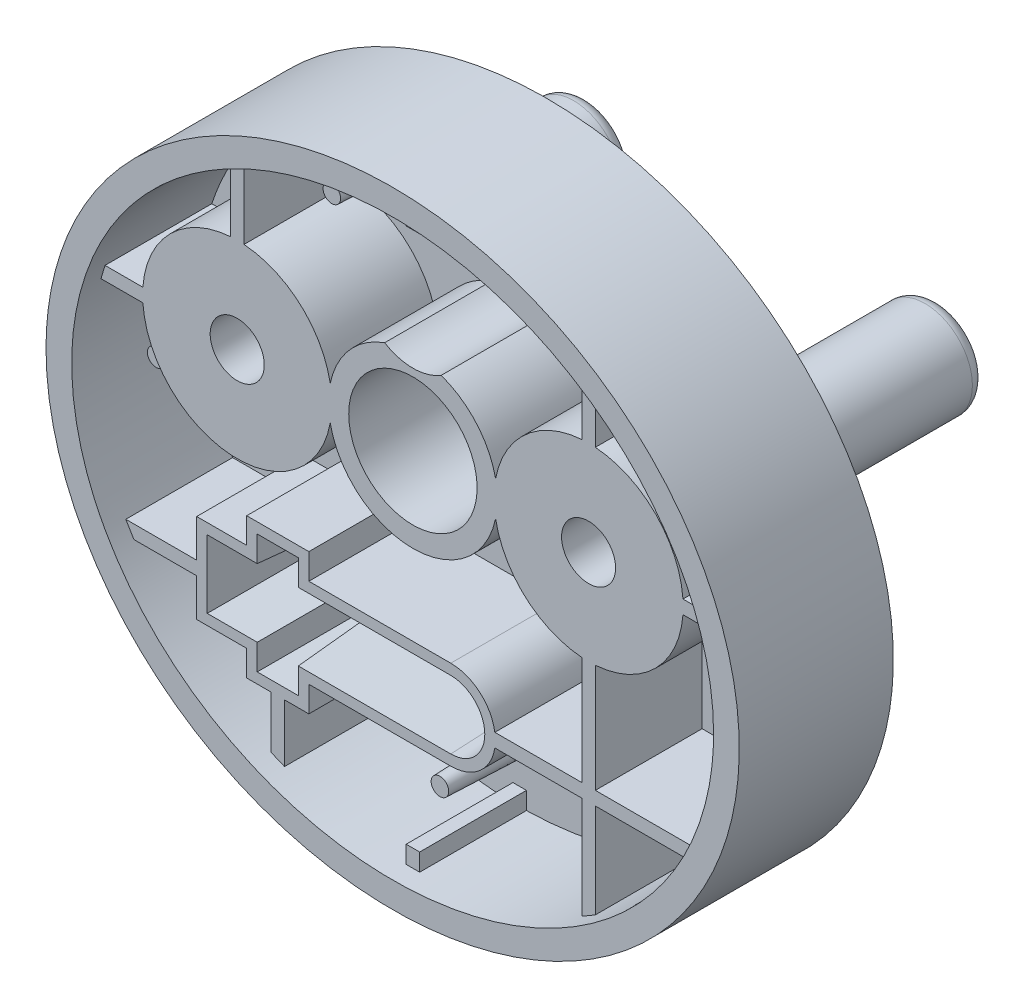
ISO-10303-21;
HEADER;
FILE_DESCRIPTION(('STEP AP214'),'2;1');
FILE_NAME('part.step','',(''),(''),'','','');
FILE_SCHEMA(('AUTOMOTIVE_DESIGN { 1 0 10303 214 1 1 1 1 }'));
ENDSEC;
DATA;
#1=APPLICATION_CONTEXT('core data for automotive mechanical design processes');
#2=APPLICATION_PROTOCOL_DEFINITION('international standard','automotive_design',2000,#1);
#3=PRODUCT_CONTEXT('',#1,'mechanical');
#4=PRODUCT('Part','Part','',(#3));
#5=PRODUCT_RELATED_PRODUCT_CATEGORY('part','',(#4));
#6=PRODUCT_DEFINITION_FORMATION('','',#4);
#7=PRODUCT_DEFINITION_CONTEXT('part definition',#1,'design');
#8=PRODUCT_DEFINITION('design','',#6,#7);
#9=PRODUCT_DEFINITION_SHAPE('','',#8);
#10=(LENGTH_UNIT() NAMED_UNIT(*) SI_UNIT(.MILLI.,.METRE.));
#11=(NAMED_UNIT(*) PLANE_ANGLE_UNIT() SI_UNIT($,.RADIAN.));
#12=(NAMED_UNIT(*) SI_UNIT($,.STERADIAN.) SOLID_ANGLE_UNIT());
#13=UNCERTAINTY_MEASURE_WITH_UNIT(LENGTH_MEASURE(1.E-05),#10,'distance_accuracy_value','');
#14=(GEOMETRIC_REPRESENTATION_CONTEXT(3) GLOBAL_UNCERTAINTY_ASSIGNED_CONTEXT((#13)) GLOBAL_UNIT_ASSIGNED_CONTEXT((#10,
#11,#12)) REPRESENTATION_CONTEXT('',''));
#15=CARTESIAN_POINT('',(0.,0.,0.));
#16=DIRECTION('',(0.,0.,1.));
#17=DIRECTION('',(1.,0.,0.));
#18=AXIS2_PLACEMENT_3D('',#15,#16,#17);
#19=CARTESIAN_POINT('',(23.75,0.,-11.4));
#20=CARTESIAN_POINT('',(23.75,2.7816184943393,-11.4));
#21=CARTESIAN_POINT('',(23.1318510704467,5.56214254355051,-11.4));
#22=CARTESIAN_POINT('',(20.7524267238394,10.7019033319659,-11.4));
#23=CARTESIAN_POINT('',(18.9920875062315,13.059117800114,-11.4));
#24=CARTESIAN_POINT('',(14.5954846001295,16.9929204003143,-11.4));
#25=CARTESIAN_POINT('',(11.9609507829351,18.5679607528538,-11.4));
#26=CARTESIAN_POINT('',(6.21651225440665,20.6969193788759,-11.4));
#27=CARTESIAN_POINT('',(3.1088677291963,21.25,-11.4));
#28=CARTESIAN_POINT('',(-3.10886772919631,21.25,-11.4));
#29=CARTESIAN_POINT('',(-6.21651225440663,20.6969193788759,-11.4));
#30=CARTESIAN_POINT('',(-11.9609507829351,18.5679607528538,-11.4));
#31=CARTESIAN_POINT('',(-14.5954846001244,16.9929204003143,-11.4));
#32=CARTESIAN_POINT('',(-18.9920875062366,13.059117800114,-11.4));
#33=CARTESIAN_POINT('',(-20.7524267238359,10.7019033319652,-11.4));
#34=CARTESIAN_POINT('',(-23.1318510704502,5.56214254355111,-11.4));
#35=CARTESIAN_POINT('',(-23.7500000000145,2.78161849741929,-11.4));
#36=CARTESIAN_POINT('',(-23.75,0.,-11.4));
#37=CARTESIAN_POINT('',(-23.7499999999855,-2.7816184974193,-11.4));
#38=CARTESIAN_POINT('',(-23.1318510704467,-5.56214254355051,-11.4));
#39=CARTESIAN_POINT('',(-20.7524267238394,-10.7019033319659,-11.4));
#40=CARTESIAN_POINT('',(-18.992087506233,-13.0591178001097,-11.4));
#41=CARTESIAN_POINT('',(-14.5954846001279,-16.9929204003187,-11.4));
#42=CARTESIAN_POINT('',(-11.9609507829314,-18.5679607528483,-11.4));
#43=CARTESIAN_POINT('',(-6.21651225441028,-20.6969193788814,-11.4));
#44=CARTESIAN_POINT('',(-3.10886772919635,-21.25,-11.4));
#45=CARTESIAN_POINT('',(3.10886772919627,-21.25,-11.4));
#46=CARTESIAN_POINT('',(6.21651225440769,-20.6969193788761,-11.4));
#47=CARTESIAN_POINT('',(11.9609507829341,-18.5679607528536,-11.4));
#48=CARTESIAN_POINT('',(14.5954846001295,-16.9929204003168,-11.4));
#49=CARTESIAN_POINT('',(18.9920875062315,-13.0591178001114,-11.4));
#50=CARTESIAN_POINT('',(20.7524267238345,-10.7019033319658,-11.4));
#51=CARTESIAN_POINT('',(23.1318510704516,-5.56214254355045,-11.4));
#52=CARTESIAN_POINT('',(23.75,-2.7816184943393,-11.4));
#53=CARTESIAN_POINT('',(23.75,0.,-11.4));
#54=B_SPLINE_CURVE_WITH_KNOTS('',3,(#19,#20,#21,#22,#23,#24,#25,#26,#27,#28,#29,#30,#31,#32,#33,
#34,#35,#36,#37,#38,#39,#40,#41,#42,#43,#44,#45,#46,#47,#48,#49,#50,#51,#52,#53),.UNSPECIFIED.,
.T.,.F.,(4,2,2,2,2,2,2,2,3,2,2,2,2,2,2,2,4),(3.14159265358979,3.53429173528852,3.92699081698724,
4.31968989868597,4.71238898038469,5.10508806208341,5.49778714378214,5.89048622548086,
6.28318530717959,6.67588438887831,7.06858347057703,7.46128255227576,7.85398163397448,
8.24668071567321,8.63937979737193,9.03207887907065,9.42477796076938),.UNSPECIFIED.);
#55=DIRECTION('',(0.,0.,1.));
#56=VECTOR('',#55,1.);
#57=SURFACE_OF_LINEAR_EXTRUSION('',#54,#56);
#58=CARTESIAN_POINT('',(23.75,0.,-1.50000000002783));
#59=CARTESIAN_POINT('',(23.75,2.7816184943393,-1.50000000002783));
#60=CARTESIAN_POINT('',(23.1318510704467,5.56214254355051,-1.50000000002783));
#61=CARTESIAN_POINT('',(20.7524267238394,10.7019033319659,-1.50000000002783));
#62=CARTESIAN_POINT('',(18.9920875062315,13.059117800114,-1.50000000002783));
#63=CARTESIAN_POINT('',(14.5954846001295,16.9929204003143,-1.50000000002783));
#64=CARTESIAN_POINT('',(11.9609507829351,18.5679607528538,-1.50000000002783));
#65=CARTESIAN_POINT('',(6.21651225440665,20.6969193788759,-1.50000000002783));
#66=CARTESIAN_POINT('',(3.1088677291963,21.25,-1.50000000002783));
#67=CARTESIAN_POINT('',(-3.10886772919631,21.25,-1.50000000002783));
#68=CARTESIAN_POINT('',(-6.21651225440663,20.6969193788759,-1.50000000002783));
#69=CARTESIAN_POINT('',(-11.9609507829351,18.5679607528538,-1.50000000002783));
#70=CARTESIAN_POINT('',(-14.5954846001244,16.9929204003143,-1.50000000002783));
#71=CARTESIAN_POINT('',(-18.9920875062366,13.059117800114,-1.50000000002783));
#72=CARTESIAN_POINT('',(-20.7524267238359,10.7019033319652,-1.50000000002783));
#73=CARTESIAN_POINT('',(-23.1318510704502,5.56214254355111,-1.50000000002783));
#74=CARTESIAN_POINT('',(-23.7500000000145,2.78161849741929,-1.50000000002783));
#75=CARTESIAN_POINT('',(-23.75,0.,-1.50000000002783));
#76=CARTESIAN_POINT('',(-23.7499999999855,-2.7816184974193,-1.50000000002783));
#77=CARTESIAN_POINT('',(-23.1318510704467,-5.56214254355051,-1.50000000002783));
#78=CARTESIAN_POINT('',(-20.7524267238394,-10.7019033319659,-1.50000000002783));
#79=CARTESIAN_POINT('',(-18.992087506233,-13.0591178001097,-1.50000000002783));
#80=CARTESIAN_POINT('',(-14.5954846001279,-16.9929204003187,-1.50000000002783));
#81=CARTESIAN_POINT('',(-11.9609507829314,-18.5679607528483,-1.50000000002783));
#82=CARTESIAN_POINT('',(-6.21651225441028,-20.6969193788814,-1.50000000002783));
#83=CARTESIAN_POINT('',(-3.10886772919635,-21.25,-1.50000000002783));
#84=CARTESIAN_POINT('',(3.10886772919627,-21.25,-1.50000000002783));
#85=CARTESIAN_POINT('',(6.21651225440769,-20.6969193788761,-1.50000000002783));
#86=CARTESIAN_POINT('',(11.9609507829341,-18.5679607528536,-1.50000000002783));
#87=CARTESIAN_POINT('',(14.5954846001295,-16.9929204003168,-1.50000000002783));
#88=CARTESIAN_POINT('',(18.9920875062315,-13.0591178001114,-1.50000000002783));
#89=CARTESIAN_POINT('',(20.7524267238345,-10.7019033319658,-1.50000000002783));
#90=CARTESIAN_POINT('',(23.1318510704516,-5.56214254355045,-1.50000000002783));
#91=CARTESIAN_POINT('',(23.75,-2.7816184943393,-1.50000000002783));
#92=CARTESIAN_POINT('',(23.75,0.,-1.50000000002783));
#93=B_SPLINE_CURVE_WITH_KNOTS('',3,(#58,#59,#60,#61,#62,#63,#64,#65,#66,#67,#68,#69,#70,#71,#72,
#73,#74,#75,#76,#77,#78,#79,#80,#81,#82,#83,#84,#85,#86,#87,#88,#89,#90,#91,#92),.UNSPECIFIED.,
.T.,.F.,(4,2,2,2,2,2,2,2,3,2,2,2,2,2,2,2,4),(3.14159265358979,3.53429173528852,3.92699081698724,
4.31968989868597,4.71238898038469,5.10508806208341,5.49778714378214,5.89048622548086,
6.28318530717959,6.67588438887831,7.06858347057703,7.46128255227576,7.85398163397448,
8.24668071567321,8.63937979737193,9.03207887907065,9.42477796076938),.UNSPECIFIED.);
#94=CARTESIAN_POINT('',(0.499999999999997,-21.2452368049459,-1.50000000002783));
#95=VERTEX_POINT('',#94);
#96=CARTESIAN_POINT('',(-0.500000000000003,-21.2452368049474,-1.50000000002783));
#97=VERTEX_POINT('',#96);
#98=EDGE_CURVE('E540',#95,#97,#93,.F.);
#99=ORIENTED_EDGE('',*,*,#98,.T.);
#100=DIRECTION('',(0.,0.,1.));
#101=VECTOR('',#100,1.);
#102=CARTESIAN_POINT('',(-0.50000000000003,-21.2452368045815,-4.70000000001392));
#103=LINE('',#102,#101);
#104=CARTESIAN_POINT('',(-0.50000000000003,-21.2452368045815,-9.40000000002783));
#105=VERTEX_POINT('',#104);
#106=EDGE_CURVE('E523',#105,#97,#103,.T.);
#107=ORIENTED_EDGE('',*,*,#106,.F.);
#108=CARTESIAN_POINT('',(23.75,0.,-9.4));
#109=CARTESIAN_POINT('',(23.75,2.7816184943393,-9.4));
#110=CARTESIAN_POINT('',(23.1318510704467,5.56214254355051,-9.4));
#111=CARTESIAN_POINT('',(20.7524267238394,10.7019033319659,-9.4));
#112=CARTESIAN_POINT('',(18.9920875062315,13.059117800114,-9.4));
#113=CARTESIAN_POINT('',(14.5954846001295,16.9929204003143,-9.4));
#114=CARTESIAN_POINT('',(11.9609507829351,18.5679607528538,-9.4));
#115=CARTESIAN_POINT('',(6.21651225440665,20.6969193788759,-9.4));
#116=CARTESIAN_POINT('',(3.1088677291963,21.25,-9.4));
#117=CARTESIAN_POINT('',(-3.10886772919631,21.25,-9.4));
#118=CARTESIAN_POINT('',(-6.21651225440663,20.6969193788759,-9.4));
#119=CARTESIAN_POINT('',(-11.9609507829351,18.5679607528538,-9.4));
#120=CARTESIAN_POINT('',(-14.5954846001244,16.9929204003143,-9.4));
#121=CARTESIAN_POINT('',(-18.9920875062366,13.059117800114,-9.4));
#122=CARTESIAN_POINT('',(-20.7524267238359,10.7019033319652,-9.4));
#123=CARTESIAN_POINT('',(-23.1318510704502,5.56214254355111,-9.4));
#124=CARTESIAN_POINT('',(-23.7500000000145,2.78161849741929,-9.4));
#125=CARTESIAN_POINT('',(-23.75,0.,-9.4));
#126=CARTESIAN_POINT('',(-23.7499999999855,-2.7816184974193,-9.4));
#127=CARTESIAN_POINT('',(-23.1318510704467,-5.56214254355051,-9.4));
#128=CARTESIAN_POINT('',(-20.7524267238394,-10.7019033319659,-9.4));
#129=CARTESIAN_POINT('',(-18.992087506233,-13.0591178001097,-9.4));
#130=CARTESIAN_POINT('',(-14.5954846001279,-16.9929204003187,-9.4));
#131=CARTESIAN_POINT('',(-11.9609507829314,-18.5679607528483,-9.4));
#132=CARTESIAN_POINT('',(-6.21651225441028,-20.6969193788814,-9.4));
#133=CARTESIAN_POINT('',(-3.10886772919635,-21.25,-9.4));
#134=CARTESIAN_POINT('',(3.10886772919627,-21.25,-9.4));
#135=CARTESIAN_POINT('',(6.21651225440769,-20.6969193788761,-9.4));
#136=CARTESIAN_POINT('',(11.9609507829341,-18.5679607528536,-9.4));
#137=CARTESIAN_POINT('',(14.5954846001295,-16.9929204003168,-9.4));
#138=CARTESIAN_POINT('',(18.9920875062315,-13.0591178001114,-9.4));
#139=CARTESIAN_POINT('',(20.7524267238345,-10.7019033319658,-9.4));
#140=CARTESIAN_POINT('',(23.1318510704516,-5.56214254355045,-9.4));
#141=CARTESIAN_POINT('',(23.75,-2.7816184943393,-9.4));
#142=CARTESIAN_POINT('',(23.75,0.,-9.4));
#143=B_SPLINE_CURVE_WITH_KNOTS('',3,(#108,#109,#110,#111,#112,#113,#114,#115,#116,#117,#118,
#119,#120,#121,#122,#123,#124,#125,#126,#127,#128,#129,#130,#131,#132,#133,#134,#135,#136,#137,
#138,#139,#140,#141,#142),.UNSPECIFIED.,.T.,.F.,(4,2,2,2,2,2,2,2,3,2,2,2,2,2,2,2,4),
(3.14159265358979,3.53429173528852,3.92699081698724,4.31968989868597,4.71238898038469,
5.10508806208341,5.49778714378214,5.89048622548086,6.28318530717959,6.67588438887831,
7.06858347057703,7.46128255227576,7.85398163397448,8.24668071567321,8.63937979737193,
9.03207887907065,9.42477796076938),.UNSPECIFIED.);
#144=CARTESIAN_POINT('',(-9.50000000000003,-19.4758995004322,-9.40000000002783));
#145=VERTEX_POINT('',#144);
#146=EDGE_CURVE('E1211',#145,#105,#143,.T.);
#147=ORIENTED_EDGE('',*,*,#146,.F.);
#148=DIRECTION('',(0.,0.,1.));
#149=VECTOR('',#148,1.);
#150=CARTESIAN_POINT('',(-9.50000000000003,-19.4758995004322,-4.70000000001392));
#151=LINE('',#150,#149);
#152=CARTESIAN_POINT('',(-9.5,-19.475899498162,-1.50000000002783));
#153=VERTEX_POINT('',#152);
#154=EDGE_CURVE('E586',#145,#153,#151,.T.);
#155=ORIENTED_EDGE('',*,*,#154,.T.);
#156=CARTESIAN_POINT('',(23.75,0.,-1.50000000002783));
#157=CARTESIAN_POINT('',(23.75,2.7816184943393,-1.50000000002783));
#158=CARTESIAN_POINT('',(23.1318510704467,5.56214254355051,-1.50000000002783));
#159=CARTESIAN_POINT('',(20.7524267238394,10.7019033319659,-1.50000000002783));
#160=CARTESIAN_POINT('',(18.9920875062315,13.059117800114,-1.50000000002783));
#161=CARTESIAN_POINT('',(14.5954846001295,16.9929204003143,-1.50000000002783));
#162=CARTESIAN_POINT('',(11.9609507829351,18.5679607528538,-1.50000000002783));
#163=CARTESIAN_POINT('',(6.21651225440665,20.6969193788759,-1.50000000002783));
#164=CARTESIAN_POINT('',(3.1088677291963,21.25,-1.50000000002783));
#165=CARTESIAN_POINT('',(-3.10886772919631,21.25,-1.50000000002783));
#166=CARTESIAN_POINT('',(-6.21651225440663,20.6969193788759,-1.50000000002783));
#167=CARTESIAN_POINT('',(-11.9609507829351,18.5679607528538,-1.50000000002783));
#168=CARTESIAN_POINT('',(-14.5954846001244,16.9929204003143,-1.50000000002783));
#169=CARTESIAN_POINT('',(-18.9920875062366,13.059117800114,-1.50000000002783));
#170=CARTESIAN_POINT('',(-20.7524267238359,10.7019033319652,-1.50000000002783));
#171=CARTESIAN_POINT('',(-23.1318510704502,5.56214254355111,-1.50000000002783));
#172=CARTESIAN_POINT('',(-23.7500000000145,2.78161849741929,-1.50000000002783));
#173=CARTESIAN_POINT('',(-23.75,0.,-1.50000000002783));
#174=CARTESIAN_POINT('',(-23.7499999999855,-2.7816184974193,-1.50000000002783));
#175=CARTESIAN_POINT('',(-23.1318510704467,-5.56214254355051,-1.50000000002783));
#176=CARTESIAN_POINT('',(-20.7524267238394,-10.7019033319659,-1.50000000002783));
#177=CARTESIAN_POINT('',(-18.992087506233,-13.0591178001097,-1.50000000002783));
#178=CARTESIAN_POINT('',(-14.5954846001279,-16.9929204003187,-1.50000000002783));
#179=CARTESIAN_POINT('',(-11.9609507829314,-18.5679607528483,-1.50000000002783));
#180=CARTESIAN_POINT('',(-6.21651225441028,-20.6969193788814,-1.50000000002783));
#181=CARTESIAN_POINT('',(-3.10886772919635,-21.25,-1.50000000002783));
#182=CARTESIAN_POINT('',(3.10886772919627,-21.25,-1.50000000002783));
#183=CARTESIAN_POINT('',(6.21651225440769,-20.6969193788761,-1.50000000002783));
#184=CARTESIAN_POINT('',(11.9609507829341,-18.5679607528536,-1.50000000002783));
#185=CARTESIAN_POINT('',(14.5954846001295,-16.9929204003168,-1.50000000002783));
#186=CARTESIAN_POINT('',(18.9920875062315,-13.0591178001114,-1.50000000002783));
#187=CARTESIAN_POINT('',(20.7524267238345,-10.7019033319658,-1.50000000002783));
#188=CARTESIAN_POINT('',(23.1318510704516,-5.56214254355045,-1.50000000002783));
#189=CARTESIAN_POINT('',(23.75,-2.7816184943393,-1.50000000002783));
#190=CARTESIAN_POINT('',(23.75,0.,-1.50000000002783));
#191=B_SPLINE_CURVE_WITH_KNOTS('',3,(#156,#157,#158,#159,#160,#161,#162,#163,#164,#165,#166,
#167,#168,#169,#170,#171,#172,#173,#174,#175,#176,#177,#178,#179,#180,#181,#182,#183,#184,#185,
#186,#187,#188,#189,#190),.UNSPECIFIED.,.T.,.F.,(4,2,2,2,2,2,2,2,3,2,2,2,2,2,2,2,4),
(3.14159265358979,3.53429173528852,3.92699081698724,4.31968989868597,4.71238898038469,
5.10508806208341,5.49778714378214,5.89048622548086,6.28318530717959,6.67588438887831,
7.06858347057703,7.46128255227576,7.85398163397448,8.24668071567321,8.63937979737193,
9.03207887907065,9.42477796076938),.UNSPECIFIED.);
#192=CARTESIAN_POINT('',(-10.5,-19.0600204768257,-1.50000000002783));
#193=VERTEX_POINT('',#192);
#194=EDGE_CURVE('E592',#193,#153,#191,.T.);
#195=ORIENTED_EDGE('',*,*,#194,.F.);
#196=DIRECTION('',(0.,0.,1.));
#197=VECTOR('',#196,1.);
#198=CARTESIAN_POINT('',(-10.5,-19.0600204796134,-4.70000000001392));
#199=LINE('',#198,#197);
#200=CARTESIAN_POINT('',(-10.5,-19.0600204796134,-9.40000000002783));
#201=VERTEX_POINT('',#200);
#202=EDGE_CURVE('E589',#201,#193,#199,.T.);
#203=ORIENTED_EDGE('',*,*,#202,.F.);
#204=CARTESIAN_POINT('',(-20.6468725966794,-10.5,-9.40000000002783));
#205=VERTEX_POINT('',#204);
#206=EDGE_CURVE('E1206',#205,#201,#143,.T.);
#207=ORIENTED_EDGE('',*,*,#206,.F.);
#208=DIRECTION('',(0.,0.,1.));
#209=VECTOR('',#208,1.);
#210=CARTESIAN_POINT('',(-20.6468725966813,-10.5,-4.7));
#211=LINE('',#210,#209);
#212=CARTESIAN_POINT('',(-20.6468725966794,-10.5,-1.50000000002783));
#213=VERTEX_POINT('',#212);
#214=EDGE_CURVE('E834',#205,#213,#211,.T.);
#215=ORIENTED_EDGE('',*,*,#214,.T.);
#216=CARTESIAN_POINT('',(23.75,0.,-1.50000000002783));
#217=CARTESIAN_POINT('',(23.75,2.7816184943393,-1.50000000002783));
#218=CARTESIAN_POINT('',(23.1318510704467,5.56214254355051,-1.50000000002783));
#219=CARTESIAN_POINT('',(20.7524267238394,10.7019033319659,-1.50000000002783));
#220=CARTESIAN_POINT('',(18.9920875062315,13.059117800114,-1.50000000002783));
#221=CARTESIAN_POINT('',(14.5954846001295,16.9929204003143,-1.50000000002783));
#222=CARTESIAN_POINT('',(11.9609507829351,18.5679607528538,-1.50000000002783));
#223=CARTESIAN_POINT('',(6.21651225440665,20.6969193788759,-1.50000000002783));
#224=CARTESIAN_POINT('',(3.1088677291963,21.25,-1.50000000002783));
#225=CARTESIAN_POINT('',(-3.10886772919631,21.25,-1.50000000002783));
#226=CARTESIAN_POINT('',(-6.21651225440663,20.6969193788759,-1.50000000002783));
#227=CARTESIAN_POINT('',(-11.9609507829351,18.5679607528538,-1.50000000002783));
#228=CARTESIAN_POINT('',(-14.5954846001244,16.9929204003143,-1.50000000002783));
#229=CARTESIAN_POINT('',(-18.9920875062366,13.059117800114,-1.50000000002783));
#230=CARTESIAN_POINT('',(-20.7524267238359,10.7019033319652,-1.50000000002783));
#231=CARTESIAN_POINT('',(-23.1318510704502,5.56214254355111,-1.50000000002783));
#232=CARTESIAN_POINT('',(-23.7500000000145,2.78161849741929,-1.50000000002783));
#233=CARTESIAN_POINT('',(-23.75,0.,-1.50000000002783));
#234=CARTESIAN_POINT('',(-23.7499999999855,-2.7816184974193,-1.50000000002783));
#235=CARTESIAN_POINT('',(-23.1318510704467,-5.56214254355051,-1.50000000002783));
#236=CARTESIAN_POINT('',(-20.7524267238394,-10.7019033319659,-1.50000000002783));
#237=CARTESIAN_POINT('',(-18.992087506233,-13.0591178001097,-1.50000000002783));
#238=CARTESIAN_POINT('',(-14.5954846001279,-16.9929204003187,-1.50000000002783));
#239=CARTESIAN_POINT('',(-11.9609507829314,-18.5679607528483,-1.50000000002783));
#240=CARTESIAN_POINT('',(-6.21651225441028,-20.6969193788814,-1.50000000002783));
#241=CARTESIAN_POINT('',(-3.10886772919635,-21.25,-1.50000000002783));
#242=CARTESIAN_POINT('',(3.10886772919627,-21.25,-1.50000000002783));
#243=CARTESIAN_POINT('',(6.21651225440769,-20.6969193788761,-1.50000000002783));
#244=CARTESIAN_POINT('',(11.9609507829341,-18.5679607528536,-1.50000000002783));
#245=CARTESIAN_POINT('',(14.5954846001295,-16.9929204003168,-1.50000000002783));
#246=CARTESIAN_POINT('',(18.9920875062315,-13.0591178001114,-1.50000000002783));
#247=CARTESIAN_POINT('',(20.7524267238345,-10.7019033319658,-1.50000000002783));
#248=CARTESIAN_POINT('',(23.1318510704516,-5.56214254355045,-1.50000000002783));
#249=CARTESIAN_POINT('',(23.75,-2.7816184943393,-1.50000000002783));
#250=CARTESIAN_POINT('',(23.75,0.,-1.50000000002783));
#251=B_SPLINE_CURVE_WITH_KNOTS('',3,(#216,#217,#218,#219,#220,#221,#222,#223,#224,#225,#226,
#227,#228,#229,#230,#231,#232,#233,#234,#235,#236,#237,#238,#239,#240,#241,#242,#243,#244,#245,
#246,#247,#248,#249,#250),.UNSPECIFIED.,.T.,.F.,(4,2,2,2,2,2,2,2,3,2,2,2,2,2,2,2,4),
(3.14159265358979,3.53429173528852,3.92699081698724,4.31968989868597,4.71238898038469,
5.10508806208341,5.49778714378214,5.89048622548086,6.28318530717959,6.67588438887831,
7.06858347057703,7.46128255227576,7.85398163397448,8.24668071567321,8.63937979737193,
9.03207887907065,9.42477796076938),.UNSPECIFIED.);
#252=CARTESIAN_POINT('',(-21.2439133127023,-9.50000000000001,-1.50000000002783));
#253=VERTEX_POINT('',#252);
#254=EDGE_CURVE('E827',#253,#213,#251,.T.);
#255=ORIENTED_EDGE('',*,*,#254,.F.);
#256=DIRECTION('',(0.,0.,1.));
#257=VECTOR('',#256,1.);
#258=CARTESIAN_POINT('',(-21.2439133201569,-9.5,-4.7));
#259=LINE('',#258,#257);
#260=CARTESIAN_POINT('',(-21.2439133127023,-9.50000000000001,-9.40000000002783));
#261=VERTEX_POINT('',#260);
#262=EDGE_CURVE('E841',#261,#253,#259,.T.);
#263=ORIENTED_EDGE('',*,*,#262,.F.);
#264=CARTESIAN_POINT('',(-23.0818212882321,5.,-9.40000000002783));
#265=VERTEX_POINT('',#264);
#266=EDGE_CURVE('E1202',#265,#261,#143,.T.);
#267=ORIENTED_EDGE('',*,*,#266,.F.);
#268=DIRECTION('',(0.,0.,1.));
#269=VECTOR('',#268,1.);
#270=CARTESIAN_POINT('',(-23.0818212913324,5.,-4.70000000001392));
#271=LINE('',#270,#269);
#272=CARTESIAN_POINT('',(-23.0818212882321,5.,-1.5));
#273=VERTEX_POINT('',#272);
#274=EDGE_CURVE('E761',#265,#273,#271,.T.);
#275=ORIENTED_EDGE('',*,*,#274,.T.);
#276=CARTESIAN_POINT('',(23.75,0.,-1.5));
#277=CARTESIAN_POINT('',(23.75,2.7816184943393,-1.5));
#278=CARTESIAN_POINT('',(23.1318510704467,5.56214254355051,-1.5));
#279=CARTESIAN_POINT('',(20.7524267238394,10.7019033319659,-1.5));
#280=CARTESIAN_POINT('',(18.9920875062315,13.059117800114,-1.5));
#281=CARTESIAN_POINT('',(14.5954846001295,16.9929204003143,-1.5));
#282=CARTESIAN_POINT('',(11.9609507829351,18.5679607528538,-1.5));
#283=CARTESIAN_POINT('',(6.21651225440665,20.6969193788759,-1.5));
#284=CARTESIAN_POINT('',(3.1088677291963,21.25,-1.5));
#285=CARTESIAN_POINT('',(-3.10886772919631,21.25,-1.5));
#286=CARTESIAN_POINT('',(-6.21651225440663,20.6969193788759,-1.5));
#287=CARTESIAN_POINT('',(-11.9609507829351,18.5679607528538,-1.5));
#288=CARTESIAN_POINT('',(-14.5954846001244,16.9929204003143,-1.5));
#289=CARTESIAN_POINT('',(-18.9920875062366,13.059117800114,-1.5));
#290=CARTESIAN_POINT('',(-20.7524267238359,10.7019033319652,-1.5));
#291=CARTESIAN_POINT('',(-23.1318510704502,5.56214254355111,-1.5));
#292=CARTESIAN_POINT('',(-23.7500000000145,2.78161849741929,-1.5));
#293=CARTESIAN_POINT('',(-23.75,0.,-1.5));
#294=CARTESIAN_POINT('',(-23.7499999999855,-2.7816184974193,-1.5));
#295=CARTESIAN_POINT('',(-23.1318510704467,-5.56214254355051,-1.5));
#296=CARTESIAN_POINT('',(-20.7524267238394,-10.7019033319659,-1.5));
#297=CARTESIAN_POINT('',(-18.992087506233,-13.0591178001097,-1.5));
#298=CARTESIAN_POINT('',(-14.5954846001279,-16.9929204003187,-1.5));
#299=CARTESIAN_POINT('',(-11.9609507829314,-18.5679607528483,-1.5));
#300=CARTESIAN_POINT('',(-6.21651225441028,-20.6969193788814,-1.5));
#301=CARTESIAN_POINT('',(-3.10886772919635,-21.25,-1.5));
#302=CARTESIAN_POINT('',(3.10886772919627,-21.25,-1.5));
#303=CARTESIAN_POINT('',(6.21651225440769,-20.6969193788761,-1.5));
#304=CARTESIAN_POINT('',(11.9609507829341,-18.5679607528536,-1.5));
#305=CARTESIAN_POINT('',(14.5954846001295,-16.9929204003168,-1.5));
#306=CARTESIAN_POINT('',(18.9920875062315,-13.0591178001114,-1.5));
#307=CARTESIAN_POINT('',(20.7524267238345,-10.7019033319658,-1.5));
#308=CARTESIAN_POINT('',(23.1318510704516,-5.56214254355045,-1.5));
#309=CARTESIAN_POINT('',(23.75,-2.7816184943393,-1.5));
#310=CARTESIAN_POINT('',(23.75,0.,-1.5));
#311=B_SPLINE_CURVE_WITH_KNOTS('',3,(#276,#277,#278,#279,#280,#281,#282,#283,#284,#285,#286,
#287,#288,#289,#290,#291,#292,#293,#294,#295,#296,#297,#298,#299,#300,#301,#302,#303,#304,#305,
#306,#307,#308,#309,#310),.UNSPECIFIED.,.T.,.F.,(4,2,2,2,2,2,2,2,3,2,2,2,2,2,2,2,4),
(3.14159265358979,3.53429173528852,3.92699081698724,4.31968989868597,4.71238898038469,
5.10508806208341,5.49778714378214,5.89048622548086,6.28318530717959,6.67588438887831,
7.06858347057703,7.46128255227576,7.85398163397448,8.24668071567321,8.63937979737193,
9.03207887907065,9.42477796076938),.UNSPECIFIED.);
#312=CARTESIAN_POINT('',(-22.7826739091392,6.,-1.5));
#313=VERTEX_POINT('',#312);
#314=EDGE_CURVE('E757',#313,#273,#311,.T.);
#315=ORIENTED_EDGE('',*,*,#314,.F.);
#316=DIRECTION('',(0.,0.,1.));
#317=VECTOR('',#316,1.);
#318=CARTESIAN_POINT('',(-22.7826739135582,6.00000000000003,-4.70000000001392));
#319=LINE('',#318,#317);
#320=CARTESIAN_POINT('',(-22.7826739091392,6.,-9.40000000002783));
#321=VERTEX_POINT('',#320);
#322=EDGE_CURVE('E759',#321,#313,#319,.T.);
#323=ORIENTED_EDGE('',*,*,#322,.F.);
#324=CARTESIAN_POINT('',(-13.5,17.4816031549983,-9.40000000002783));
#325=VERTEX_POINT('',#324);
#326=EDGE_CURVE('E1564',#325,#321,#143,.T.);
#327=ORIENTED_EDGE('',*,*,#326,.F.);
#328=DIRECTION('',(0.,0.,1.));
#329=VECTOR('',#328,1.);
#330=CARTESIAN_POINT('',(-13.5,17.4816031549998,-4.70000000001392));
#331=LINE('',#330,#329);
#332=CARTESIAN_POINT('',(-13.5,17.481603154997,-1.50000000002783));
#333=VERTEX_POINT('',#332);
#334=EDGE_CURVE('E633',#325,#333,#331,.T.);
#335=ORIENTED_EDGE('',*,*,#334,.T.);
#336=CARTESIAN_POINT('',(23.75,0.,-1.50000000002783));
#337=CARTESIAN_POINT('',(23.75,2.7816184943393,-1.50000000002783));
#338=CARTESIAN_POINT('',(23.1318510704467,5.56214254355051,-1.50000000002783));
#339=CARTESIAN_POINT('',(20.7524267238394,10.7019033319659,-1.50000000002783));
#340=CARTESIAN_POINT('',(18.9920875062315,13.059117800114,-1.50000000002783));
#341=CARTESIAN_POINT('',(14.5954846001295,16.9929204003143,-1.50000000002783));
#342=CARTESIAN_POINT('',(11.9609507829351,18.5679607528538,-1.50000000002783));
#343=CARTESIAN_POINT('',(6.21651225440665,20.6969193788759,-1.50000000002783));
#344=CARTESIAN_POINT('',(3.1088677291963,21.25,-1.50000000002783));
#345=CARTESIAN_POINT('',(-3.10886772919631,21.25,-1.50000000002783));
#346=CARTESIAN_POINT('',(-6.21651225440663,20.6969193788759,-1.50000000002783));
#347=CARTESIAN_POINT('',(-11.9609507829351,18.5679607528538,-1.50000000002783));
#348=CARTESIAN_POINT('',(-14.5954846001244,16.9929204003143,-1.50000000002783));
#349=CARTESIAN_POINT('',(-18.9920875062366,13.059117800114,-1.50000000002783));
#350=CARTESIAN_POINT('',(-20.7524267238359,10.7019033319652,-1.50000000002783));
#351=CARTESIAN_POINT('',(-23.1318510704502,5.56214254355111,-1.50000000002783));
#352=CARTESIAN_POINT('',(-23.7500000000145,2.78161849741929,-1.50000000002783));
#353=CARTESIAN_POINT('',(-23.75,0.,-1.50000000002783));
#354=CARTESIAN_POINT('',(-23.7499999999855,-2.7816184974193,-1.50000000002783));
#355=CARTESIAN_POINT('',(-23.1318510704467,-5.56214254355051,-1.50000000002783));
#356=CARTESIAN_POINT('',(-20.7524267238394,-10.7019033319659,-1.50000000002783));
#357=CARTESIAN_POINT('',(-18.992087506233,-13.0591178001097,-1.50000000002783));
#358=CARTESIAN_POINT('',(-14.5954846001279,-16.9929204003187,-1.50000000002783));
#359=CARTESIAN_POINT('',(-11.9609507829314,-18.5679607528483,-1.50000000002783));
#360=CARTESIAN_POINT('',(-6.21651225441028,-20.6969193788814,-1.50000000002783));
#361=CARTESIAN_POINT('',(-3.10886772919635,-21.25,-1.50000000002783));
#362=CARTESIAN_POINT('',(3.10886772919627,-21.25,-1.50000000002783));
#363=CARTESIAN_POINT('',(6.21651225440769,-20.6969193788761,-1.50000000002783));
#364=CARTESIAN_POINT('',(11.9609507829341,-18.5679607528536,-1.50000000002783));
#365=CARTESIAN_POINT('',(14.5954846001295,-16.9929204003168,-1.50000000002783));
#366=CARTESIAN_POINT('',(18.9920875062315,-13.0591178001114,-1.50000000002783));
#367=CARTESIAN_POINT('',(20.7524267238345,-10.7019033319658,-1.50000000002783));
#368=CARTESIAN_POINT('',(23.1318510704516,-5.56214254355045,-1.50000000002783));
#369=CARTESIAN_POINT('',(23.75,-2.7816184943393,-1.50000000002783));
#370=CARTESIAN_POINT('',(23.75,0.,-1.50000000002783));
#371=B_SPLINE_CURVE_WITH_KNOTS('',3,(#336,#337,#338,#339,#340,#341,#342,#343,#344,#345,#346,
#347,#348,#349,#350,#351,#352,#353,#354,#355,#356,#357,#358,#359,#360,#361,#362,#363,#364,#365,
#366,#367,#368,#369,#370),.UNSPECIFIED.,.T.,.F.,(4,2,2,2,2,2,2,2,3,2,2,2,2,2,2,2,4),
(3.14159265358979,3.53429173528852,3.92699081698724,4.31968989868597,4.71238898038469,
5.10508806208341,5.49778714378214,5.89048622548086,6.28318530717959,6.67588438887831,
7.06858347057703,7.46128255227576,7.85398163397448,8.24668071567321,8.63937979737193,
9.03207887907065,9.42477796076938),.UNSPECIFIED.);
#372=CARTESIAN_POINT('',(-12.5,18.0671970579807,-1.50000000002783));
#373=VERTEX_POINT('',#372);
#374=EDGE_CURVE('E603',#333,#373,#371,.F.);
#375=ORIENTED_EDGE('',*,*,#374,.T.);
#376=DIRECTION('',(0.,0.,1.));
#377=VECTOR('',#376,1.);
#378=CARTESIAN_POINT('',(-12.5,18.0671970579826,-4.70000000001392));
#379=LINE('',#378,#377);
#380=CARTESIAN_POINT('',(-12.5,18.0671970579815,-9.40000000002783));
#381=VERTEX_POINT('',#380);
#382=EDGE_CURVE('E620',#381,#373,#379,.T.);
#383=ORIENTED_EDGE('',*,*,#382,.F.);
#384=CARTESIAN_POINT('',(-0.500000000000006,21.2452368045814,-9.40000000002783));
#385=VERTEX_POINT('',#384);
#386=EDGE_CURVE('E1567',#385,#381,#143,.T.);
#387=ORIENTED_EDGE('',*,*,#386,.F.);
#388=DIRECTION('',(0.,0.,1.));
#389=VECTOR('',#388,1.);
#390=CARTESIAN_POINT('',(-0.500000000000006,21.2452368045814,-4.70000000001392));
#391=LINE('',#390,#389);
#392=CARTESIAN_POINT('',(-0.500000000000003,21.2452368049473,-1.50000000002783));
#393=VERTEX_POINT('',#392);
#394=EDGE_CURVE('E559',#393,#385,#391,.F.);
#395=ORIENTED_EDGE('',*,*,#394,.F.);
#396=CARTESIAN_POINT('',(23.75,0.,-1.50000000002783));
#397=CARTESIAN_POINT('',(23.75,2.7816184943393,-1.50000000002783));
#398=CARTESIAN_POINT('',(23.1318510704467,5.56214254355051,-1.50000000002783));
#399=CARTESIAN_POINT('',(20.7524267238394,10.7019033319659,-1.50000000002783));
#400=CARTESIAN_POINT('',(18.9920875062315,13.059117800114,-1.50000000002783));
#401=CARTESIAN_POINT('',(14.5954846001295,16.9929204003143,-1.50000000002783));
#402=CARTESIAN_POINT('',(11.9609507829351,18.5679607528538,-1.50000000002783));
#403=CARTESIAN_POINT('',(6.21651225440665,20.6969193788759,-1.50000000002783));
#404=CARTESIAN_POINT('',(3.1088677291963,21.25,-1.50000000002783));
#405=CARTESIAN_POINT('',(-3.10886772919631,21.25,-1.50000000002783));
#406=CARTESIAN_POINT('',(-6.21651225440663,20.6969193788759,-1.50000000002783));
#407=CARTESIAN_POINT('',(-11.9609507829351,18.5679607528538,-1.50000000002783));
#408=CARTESIAN_POINT('',(-14.5954846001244,16.9929204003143,-1.50000000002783));
#409=CARTESIAN_POINT('',(-18.9920875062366,13.059117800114,-1.50000000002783));
#410=CARTESIAN_POINT('',(-20.7524267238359,10.7019033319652,-1.50000000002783));
#411=CARTESIAN_POINT('',(-23.1318510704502,5.56214254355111,-1.50000000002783));
#412=CARTESIAN_POINT('',(-23.7500000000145,2.78161849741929,-1.50000000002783));
#413=CARTESIAN_POINT('',(-23.75,0.,-1.50000000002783));
#414=CARTESIAN_POINT('',(-23.7499999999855,-2.7816184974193,-1.50000000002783));
#415=CARTESIAN_POINT('',(-23.1318510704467,-5.56214254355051,-1.50000000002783));
#416=CARTESIAN_POINT('',(-20.7524267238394,-10.7019033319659,-1.50000000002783));
#417=CARTESIAN_POINT('',(-18.992087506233,-13.0591178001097,-1.50000000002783));
#418=CARTESIAN_POINT('',(-14.5954846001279,-16.9929204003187,-1.50000000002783));
#419=CARTESIAN_POINT('',(-11.9609507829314,-18.5679607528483,-1.50000000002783));
#420=CARTESIAN_POINT('',(-6.21651225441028,-20.6969193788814,-1.50000000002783));
#421=CARTESIAN_POINT('',(-3.10886772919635,-21.25,-1.50000000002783));
#422=CARTESIAN_POINT('',(3.10886772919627,-21.25,-1.50000000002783));
#423=CARTESIAN_POINT('',(6.21651225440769,-20.6969193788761,-1.50000000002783));
#424=CARTESIAN_POINT('',(11.9609507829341,-18.5679607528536,-1.50000000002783));
#425=CARTESIAN_POINT('',(14.5954846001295,-16.9929204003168,-1.50000000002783));
#426=CARTESIAN_POINT('',(18.9920875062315,-13.0591178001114,-1.50000000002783));
#427=CARTESIAN_POINT('',(20.7524267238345,-10.7019033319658,-1.50000000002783));
#428=CARTESIAN_POINT('',(23.1318510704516,-5.56214254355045,-1.50000000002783));
#429=CARTESIAN_POINT('',(23.75,-2.7816184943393,-1.50000000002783));
#430=CARTESIAN_POINT('',(23.75,0.,-1.50000000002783));
#431=B_SPLINE_CURVE_WITH_KNOTS('',3,(#396,#397,#398,#399,#400,#401,#402,#403,#404,#405,#406,
#407,#408,#409,#410,#411,#412,#413,#414,#415,#416,#417,#418,#419,#420,#421,#422,#423,#424,#425,
#426,#427,#428,#429,#430),.UNSPECIFIED.,.T.,.F.,(4,2,2,2,2,2,2,2,3,2,2,2,2,2,2,2,4),
(3.14159265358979,3.53429173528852,3.92699081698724,4.31968989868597,4.71238898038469,
5.10508806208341,5.49778714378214,5.89048622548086,6.28318530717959,6.67588438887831,
7.06858347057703,7.46128255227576,7.85398163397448,8.24668071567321,8.63937979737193,
9.03207887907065,9.42477796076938),.UNSPECIFIED.);
#432=CARTESIAN_POINT('',(0.499999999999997,21.2452368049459,-1.50000000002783));
#433=VERTEX_POINT('',#432);
#434=EDGE_CURVE('E566',#433,#393,#431,.T.);
#435=ORIENTED_EDGE('',*,*,#434,.F.);
#436=DIRECTION('',(0.,0.,1.));
#437=VECTOR('',#436,1.);
#438=CARTESIAN_POINT('',(0.500000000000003,21.2452368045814,-4.70000000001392));
#439=LINE('',#438,#437);
#440=CARTESIAN_POINT('',(0.500000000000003,21.2452368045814,-9.40000000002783));
#441=VERTEX_POINT('',#440);
#442=EDGE_CURVE('E564',#441,#433,#439,.T.);
#443=ORIENTED_EDGE('',*,*,#442,.F.);
#444=CARTESIAN_POINT('',(12.5000000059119,18.0671970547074,-9.4));
#445=VERTEX_POINT('',#444);
#446=EDGE_CURVE('E1562',#445,#441,#143,.T.);
#447=ORIENTED_EDGE('',*,*,#446,.F.);
#448=DIRECTION('',(0.,0.,1.));
#449=VECTOR('',#448,1.);
#450=CARTESIAN_POINT('',(12.5,18.0671970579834,-4.70000000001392));
#451=LINE('',#450,#449);
#452=CARTESIAN_POINT('',(12.5000000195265,18.067197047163,-1.50000000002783));
#453=VERTEX_POINT('',#452);
#454=EDGE_CURVE('E666',#445,#453,#451,.T.);
#455=ORIENTED_EDGE('',*,*,#454,.T.);
#456=CARTESIAN_POINT('',(23.75,0.,-1.50000000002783));
#457=CARTESIAN_POINT('',(23.75,2.7816184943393,-1.50000000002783));
#458=CARTESIAN_POINT('',(23.1318510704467,5.56214254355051,-1.50000000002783));
#459=CARTESIAN_POINT('',(20.7524267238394,10.7019033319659,-1.50000000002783));
#460=CARTESIAN_POINT('',(18.9920875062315,13.059117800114,-1.50000000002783));
#461=CARTESIAN_POINT('',(14.5954846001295,16.9929204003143,-1.50000000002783));
#462=CARTESIAN_POINT('',(11.9609507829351,18.5679607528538,-1.50000000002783));
#463=CARTESIAN_POINT('',(6.21651225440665,20.6969193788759,-1.50000000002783));
#464=CARTESIAN_POINT('',(3.1088677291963,21.25,-1.50000000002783));
#465=CARTESIAN_POINT('',(-3.10886772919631,21.25,-1.50000000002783));
#466=CARTESIAN_POINT('',(-6.21651225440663,20.6969193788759,-1.50000000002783));
#467=CARTESIAN_POINT('',(-11.9609507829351,18.5679607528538,-1.50000000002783));
#468=CARTESIAN_POINT('',(-14.5954846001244,16.9929204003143,-1.50000000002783));
#469=CARTESIAN_POINT('',(-18.9920875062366,13.059117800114,-1.50000000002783));
#470=CARTESIAN_POINT('',(-20.7524267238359,10.7019033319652,-1.50000000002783));
#471=CARTESIAN_POINT('',(-23.1318510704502,5.56214254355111,-1.50000000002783));
#472=CARTESIAN_POINT('',(-23.7500000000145,2.78161849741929,-1.50000000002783));
#473=CARTESIAN_POINT('',(-23.75,0.,-1.50000000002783));
#474=CARTESIAN_POINT('',(-23.7499999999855,-2.7816184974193,-1.50000000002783));
#475=CARTESIAN_POINT('',(-23.1318510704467,-5.56214254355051,-1.50000000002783));
#476=CARTESIAN_POINT('',(-20.7524267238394,-10.7019033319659,-1.50000000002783));
#477=CARTESIAN_POINT('',(-18.992087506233,-13.0591178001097,-1.50000000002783));
#478=CARTESIAN_POINT('',(-14.5954846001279,-16.9929204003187,-1.50000000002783));
#479=CARTESIAN_POINT('',(-11.9609507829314,-18.5679607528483,-1.50000000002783));
#480=CARTESIAN_POINT('',(-6.21651225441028,-20.6969193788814,-1.50000000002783));
#481=CARTESIAN_POINT('',(-3.10886772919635,-21.25,-1.50000000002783));
#482=CARTESIAN_POINT('',(3.10886772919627,-21.25,-1.50000000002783));
#483=CARTESIAN_POINT('',(6.21651225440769,-20.6969193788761,-1.50000000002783));
#484=CARTESIAN_POINT('',(11.9609507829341,-18.5679607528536,-1.50000000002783));
#485=CARTESIAN_POINT('',(14.5954846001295,-16.9929204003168,-1.50000000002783));
#486=CARTESIAN_POINT('',(18.9920875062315,-13.0591178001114,-1.50000000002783));
#487=CARTESIAN_POINT('',(20.7524267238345,-10.7019033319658,-1.50000000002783));
#488=CARTESIAN_POINT('',(23.1318510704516,-5.56214254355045,-1.50000000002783));
#489=CARTESIAN_POINT('',(23.75,-2.7816184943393,-1.50000000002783));
#490=CARTESIAN_POINT('',(23.75,0.,-1.50000000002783));
#491=B_SPLINE_CURVE_WITH_KNOTS('',3,(#456,#457,#458,#459,#460,#461,#462,#463,#464,#465,#466,
#467,#468,#469,#470,#471,#472,#473,#474,#475,#476,#477,#478,#479,#480,#481,#482,#483,#484,#485,
#486,#487,#488,#489,#490),.UNSPECIFIED.,.T.,.F.,(4,2,2,2,2,2,2,2,3,2,2,2,2,2,2,2,4),
(3.14159265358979,3.53429173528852,3.92699081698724,4.31968989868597,4.71238898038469,
5.10508806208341,5.49778714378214,5.89048622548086,6.28318530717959,6.67588438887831,
7.06858347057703,7.46128255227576,7.85398163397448,8.24668071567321,8.63937979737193,
9.03207887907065,9.42477796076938),.UNSPECIFIED.);
#492=CARTESIAN_POINT('',(13.5000000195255,17.4816031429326,-1.50000000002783));
#493=VERTEX_POINT('',#492);
#494=EDGE_CURVE('E628',#453,#493,#491,.F.);
#495=ORIENTED_EDGE('',*,*,#494,.T.);
#496=DIRECTION('',(0.,0.,1.));
#497=VECTOR('',#496,1.);
#498=CARTESIAN_POINT('',(13.5,17.4816031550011,-4.70000000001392));
#499=LINE('',#498,#497);
#500=CARTESIAN_POINT('',(13.500000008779,17.4816031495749,-9.4));
#501=VERTEX_POINT('',#500);
#502=EDGE_CURVE('E649',#501,#493,#499,.T.);
#503=ORIENTED_EDGE('',*,*,#502,.F.);
#504=CARTESIAN_POINT('',(22.7826739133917,6.00000000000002,-9.4));
#505=VERTEX_POINT('',#504);
#506=EDGE_CURVE('E1561',#505,#501,#143,.T.);
#507=ORIENTED_EDGE('',*,*,#506,.F.);
#508=DIRECTION('',(0.,0.,1.));
#509=VECTOR('',#508,1.);
#510=CARTESIAN_POINT('',(22.7826739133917,6.,-4.70000000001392));
#511=LINE('',#510,#509);
#512=CARTESIAN_POINT('',(22.7826739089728,6.0000000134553,-1.5));
#513=VERTEX_POINT('',#512);
#514=EDGE_CURVE('E744',#505,#513,#511,.T.);
#515=ORIENTED_EDGE('',*,*,#514,.T.);
#516=CARTESIAN_POINT('',(23.75,0.,-1.5));
#517=CARTESIAN_POINT('',(23.75,2.7816184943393,-1.5));
#518=CARTESIAN_POINT('',(23.1318510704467,5.56214254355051,-1.5));
#519=CARTESIAN_POINT('',(20.7524267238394,10.7019033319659,-1.5));
#520=CARTESIAN_POINT('',(18.9920875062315,13.059117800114,-1.5));
#521=CARTESIAN_POINT('',(14.5954846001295,16.9929204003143,-1.5));
#522=CARTESIAN_POINT('',(11.9609507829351,18.5679607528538,-1.5));
#523=CARTESIAN_POINT('',(6.21651225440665,20.6969193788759,-1.5));
#524=CARTESIAN_POINT('',(3.1088677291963,21.25,-1.5));
#525=CARTESIAN_POINT('',(-3.10886772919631,21.25,-1.5));
#526=CARTESIAN_POINT('',(-6.21651225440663,20.6969193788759,-1.5));
#527=CARTESIAN_POINT('',(-11.9609507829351,18.5679607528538,-1.5));
#528=CARTESIAN_POINT('',(-14.5954846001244,16.9929204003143,-1.5));
#529=CARTESIAN_POINT('',(-18.9920875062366,13.059117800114,-1.5));
#530=CARTESIAN_POINT('',(-20.7524267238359,10.7019033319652,-1.5));
#531=CARTESIAN_POINT('',(-23.1318510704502,5.56214254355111,-1.5));
#532=CARTESIAN_POINT('',(-23.7500000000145,2.78161849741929,-1.5));
#533=CARTESIAN_POINT('',(-23.75,0.,-1.5));
#534=CARTESIAN_POINT('',(-23.7499999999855,-2.7816184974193,-1.5));
#535=CARTESIAN_POINT('',(-23.1318510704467,-5.56214254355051,-1.5));
#536=CARTESIAN_POINT('',(-20.7524267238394,-10.7019033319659,-1.5));
#537=CARTESIAN_POINT('',(-18.992087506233,-13.0591178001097,-1.5));
#538=CARTESIAN_POINT('',(-14.5954846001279,-16.9929204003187,-1.5));
#539=CARTESIAN_POINT('',(-11.9609507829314,-18.5679607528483,-1.5));
#540=CARTESIAN_POINT('',(-6.21651225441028,-20.6969193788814,-1.5));
#541=CARTESIAN_POINT('',(-3.10886772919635,-21.25,-1.5));
#542=CARTESIAN_POINT('',(3.10886772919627,-21.25,-1.5));
#543=CARTESIAN_POINT('',(6.21651225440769,-20.6969193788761,-1.5));
#544=CARTESIAN_POINT('',(11.9609507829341,-18.5679607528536,-1.5));
#545=CARTESIAN_POINT('',(14.5954846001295,-16.9929204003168,-1.5));
#546=CARTESIAN_POINT('',(18.9920875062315,-13.0591178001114,-1.5));
#547=CARTESIAN_POINT('',(20.7524267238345,-10.7019033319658,-1.5));
#548=CARTESIAN_POINT('',(23.1318510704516,-5.56214254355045,-1.5));
#549=CARTESIAN_POINT('',(23.75,-2.7816184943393,-1.5));
#550=CARTESIAN_POINT('',(23.75,0.,-1.5));
#551=B_SPLINE_CURVE_WITH_KNOTS('',3,(#516,#517,#518,#519,#520,#521,#522,#523,#524,#525,#526,
#527,#528,#529,#530,#531,#532,#533,#534,#535,#536,#537,#538,#539,#540,#541,#542,#543,#544,#545,
#546,#547,#548,#549,#550),.UNSPECIFIED.,.T.,.F.,(4,2,2,2,2,2,2,2,3,2,2,2,2,2,2,2,4),
(3.14159265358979,3.53429173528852,3.92699081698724,4.31968989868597,4.71238898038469,
5.10508806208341,5.49778714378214,5.89048622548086,6.28318530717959,6.67588438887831,
7.06858347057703,7.46128255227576,7.85398163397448,8.24668071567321,8.63937979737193,
9.03207887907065,9.42477796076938),.UNSPECIFIED.);
#552=CARTESIAN_POINT('',(23.0818212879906,5.00000001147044,-1.5));
#553=VERTEX_POINT('',#552);
#554=EDGE_CURVE('E718',#513,#553,#551,.F.);
#555=ORIENTED_EDGE('',*,*,#554,.T.);
#556=DIRECTION('',(0.,0.,1.));
#557=VECTOR('',#556,1.);
#558=CARTESIAN_POINT('',(23.0818212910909,4.99999999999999,-4.70000000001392));
#559=LINE('',#558,#557);
#560=CARTESIAN_POINT('',(23.0818212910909,5.00000000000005,-9.4));
#561=VERTEX_POINT('',#560);
#562=EDGE_CURVE('E730',#561,#553,#559,.T.);
#563=ORIENTED_EDGE('',*,*,#562,.F.);
#564=CARTESIAN_POINT('',(21.2439133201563,-9.50000000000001,-9.40000000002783));
#565=VERTEX_POINT('',#564);
#566=EDGE_CURVE('E1213',#565,#561,#143,.T.);
#567=ORIENTED_EDGE('',*,*,#566,.F.);
#568=DIRECTION('',(0.,0.,1.));
#569=VECTOR('',#568,1.);
#570=CARTESIAN_POINT('',(21.243913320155,-9.50000000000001,-4.7));
#571=LINE('',#570,#569);
#572=CARTESIAN_POINT('',(21.2439133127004,-9.50000000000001,-1.50000000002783));
#573=VERTEX_POINT('',#572);
#574=EDGE_CURVE('E804',#565,#573,#571,.T.);
#575=ORIENTED_EDGE('',*,*,#574,.T.);
#576=CARTESIAN_POINT('',(23.75,0.,-1.50000000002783));
#577=CARTESIAN_POINT('',(23.75,2.7816184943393,-1.50000000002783));
#578=CARTESIAN_POINT('',(23.1318510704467,5.56214254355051,-1.50000000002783));
#579=CARTESIAN_POINT('',(20.7524267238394,10.7019033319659,-1.50000000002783));
#580=CARTESIAN_POINT('',(18.9920875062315,13.059117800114,-1.50000000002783));
#581=CARTESIAN_POINT('',(14.5954846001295,16.9929204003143,-1.50000000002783));
#582=CARTESIAN_POINT('',(11.9609507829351,18.5679607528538,-1.50000000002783));
#583=CARTESIAN_POINT('',(6.21651225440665,20.6969193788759,-1.50000000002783));
#584=CARTESIAN_POINT('',(3.1088677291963,21.25,-1.50000000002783));
#585=CARTESIAN_POINT('',(-3.10886772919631,21.25,-1.50000000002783));
#586=CARTESIAN_POINT('',(-6.21651225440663,20.6969193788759,-1.50000000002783));
#587=CARTESIAN_POINT('',(-11.9609507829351,18.5679607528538,-1.50000000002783));
#588=CARTESIAN_POINT('',(-14.5954846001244,16.9929204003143,-1.50000000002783));
#589=CARTESIAN_POINT('',(-18.9920875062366,13.059117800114,-1.50000000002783));
#590=CARTESIAN_POINT('',(-20.7524267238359,10.7019033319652,-1.50000000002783));
#591=CARTESIAN_POINT('',(-23.1318510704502,5.56214254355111,-1.50000000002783));
#592=CARTESIAN_POINT('',(-23.7500000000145,2.78161849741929,-1.50000000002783));
#593=CARTESIAN_POINT('',(-23.75,0.,-1.50000000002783));
#594=CARTESIAN_POINT('',(-23.7499999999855,-2.7816184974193,-1.50000000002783));
#595=CARTESIAN_POINT('',(-23.1318510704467,-5.56214254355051,-1.50000000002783));
#596=CARTESIAN_POINT('',(-20.7524267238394,-10.7019033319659,-1.50000000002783));
#597=CARTESIAN_POINT('',(-18.992087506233,-13.0591178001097,-1.50000000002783));
#598=CARTESIAN_POINT('',(-14.5954846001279,-16.9929204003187,-1.50000000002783));
#599=CARTESIAN_POINT('',(-11.9609507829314,-18.5679607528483,-1.50000000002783));
#600=CARTESIAN_POINT('',(-6.21651225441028,-20.6969193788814,-1.50000000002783));
#601=CARTESIAN_POINT('',(-3.10886772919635,-21.25,-1.50000000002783));
#602=CARTESIAN_POINT('',(3.10886772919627,-21.25,-1.50000000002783));
#603=CARTESIAN_POINT('',(6.21651225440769,-20.6969193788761,-1.50000000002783));
#604=CARTESIAN_POINT('',(11.9609507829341,-18.5679607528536,-1.50000000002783));
#605=CARTESIAN_POINT('',(14.5954846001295,-16.9929204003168,-1.50000000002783));
#606=CARTESIAN_POINT('',(18.9920875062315,-13.0591178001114,-1.50000000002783));
#607=CARTESIAN_POINT('',(20.7524267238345,-10.7019033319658,-1.50000000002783));
#608=CARTESIAN_POINT('',(23.1318510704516,-5.56214254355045,-1.50000000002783));
#609=CARTESIAN_POINT('',(23.75,-2.7816184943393,-1.50000000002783));
#610=CARTESIAN_POINT('',(23.75,0.,-1.50000000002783));
#611=B_SPLINE_CURVE_WITH_KNOTS('',3,(#576,#577,#578,#579,#580,#581,#582,#583,#584,#585,#586,
#587,#588,#589,#590,#591,#592,#593,#594,#595,#596,#597,#598,#599,#600,#601,#602,#603,#604,#605,
#606,#607,#608,#609,#610),.UNSPECIFIED.,.T.,.F.,(4,2,2,2,2,2,2,2,3,2,2,2,2,2,2,2,4),
(3.14159265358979,3.53429173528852,3.92699081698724,4.31968989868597,4.71238898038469,
5.10508806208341,5.49778714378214,5.89048622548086,6.28318530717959,6.67588438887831,
7.06858347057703,7.46128255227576,7.85398163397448,8.24668071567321,8.63937979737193,
9.03207887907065,9.42477796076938),.UNSPECIFIED.);
#612=CARTESIAN_POINT('',(20.6468725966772,-10.5,-1.50000000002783));
#613=VERTEX_POINT('',#612);
#614=EDGE_CURVE('E791',#573,#613,#611,.F.);
#615=ORIENTED_EDGE('',*,*,#614,.T.);
#616=DIRECTION('',(0.,0.,1.));
#617=VECTOR('',#616,1.);
#618=CARTESIAN_POINT('',(20.6468725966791,-10.5,-4.7));
#619=LINE('',#618,#617);
#620=CARTESIAN_POINT('',(20.6468725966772,-10.5,-9.40000000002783));
#621=VERTEX_POINT('',#620);
#622=EDGE_CURVE('E808',#621,#613,#619,.T.);
#623=ORIENTED_EDGE('',*,*,#622,.F.);
#624=CARTESIAN_POINT('',(13.5,-17.4816031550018,-9.40000000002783));
#625=VERTEX_POINT('',#624);
#626=EDGE_CURVE('E1560',#625,#621,#143,.T.);
#627=ORIENTED_EDGE('',*,*,#626,.F.);
#628=DIRECTION('',(0.,0.,1.));
#629=VECTOR('',#628,1.);
#630=CARTESIAN_POINT('',(13.5,-17.4816031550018,-4.70000000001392));
#631=LINE('',#630,#629);
#632=CARTESIAN_POINT('',(13.5,-17.4816031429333,-1.5));
#633=VERTEX_POINT('',#632);
#634=EDGE_CURVE('E671',#625,#633,#631,.T.);
#635=ORIENTED_EDGE('',*,*,#634,.T.);
#636=CARTESIAN_POINT('',(23.75,0.,-1.5));
#637=CARTESIAN_POINT('',(23.75,2.7816184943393,-1.5));
#638=CARTESIAN_POINT('',(23.1318510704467,5.56214254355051,-1.5));
#639=CARTESIAN_POINT('',(20.7524267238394,10.7019033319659,-1.5));
#640=CARTESIAN_POINT('',(18.9920875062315,13.059117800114,-1.5));
#641=CARTESIAN_POINT('',(14.5954846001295,16.9929204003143,-1.5));
#642=CARTESIAN_POINT('',(11.9609507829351,18.5679607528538,-1.5));
#643=CARTESIAN_POINT('',(6.21651225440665,20.6969193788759,-1.5));
#644=CARTESIAN_POINT('',(3.1088677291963,21.25,-1.5));
#645=CARTESIAN_POINT('',(-3.10886772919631,21.25,-1.5));
#646=CARTESIAN_POINT('',(-6.21651225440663,20.6969193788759,-1.5));
#647=CARTESIAN_POINT('',(-11.9609507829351,18.5679607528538,-1.5));
#648=CARTESIAN_POINT('',(-14.5954846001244,16.9929204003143,-1.5));
#649=CARTESIAN_POINT('',(-18.9920875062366,13.059117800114,-1.5));
#650=CARTESIAN_POINT('',(-20.7524267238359,10.7019033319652,-1.5));
#651=CARTESIAN_POINT('',(-23.1318510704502,5.56214254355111,-1.5));
#652=CARTESIAN_POINT('',(-23.7500000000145,2.78161849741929,-1.5));
#653=CARTESIAN_POINT('',(-23.75,0.,-1.5));
#654=CARTESIAN_POINT('',(-23.7499999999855,-2.7816184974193,-1.5));
#655=CARTESIAN_POINT('',(-23.1318510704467,-5.56214254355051,-1.5));
#656=CARTESIAN_POINT('',(-20.7524267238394,-10.7019033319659,-1.5));
#657=CARTESIAN_POINT('',(-18.992087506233,-13.0591178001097,-1.5));
#658=CARTESIAN_POINT('',(-14.5954846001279,-16.9929204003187,-1.5));
#659=CARTESIAN_POINT('',(-11.9609507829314,-18.5679607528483,-1.5));
#660=CARTESIAN_POINT('',(-6.21651225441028,-20.6969193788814,-1.5));
#661=CARTESIAN_POINT('',(-3.10886772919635,-21.25,-1.5));
#662=CARTESIAN_POINT('',(3.10886772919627,-21.25,-1.5));
#663=CARTESIAN_POINT('',(6.21651225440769,-20.6969193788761,-1.5));
#664=CARTESIAN_POINT('',(11.9609507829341,-18.5679607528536,-1.5));
#665=CARTESIAN_POINT('',(14.5954846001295,-16.9929204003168,-1.5));
#666=CARTESIAN_POINT('',(18.9920875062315,-13.0591178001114,-1.5));
#667=CARTESIAN_POINT('',(20.7524267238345,-10.7019033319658,-1.5));
#668=CARTESIAN_POINT('',(23.1318510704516,-5.56214254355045,-1.5));
#669=CARTESIAN_POINT('',(23.75,-2.7816184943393,-1.5));
#670=CARTESIAN_POINT('',(23.75,0.,-1.5));
#671=B_SPLINE_CURVE_WITH_KNOTS('',3,(#636,#637,#638,#639,#640,#641,#642,#643,#644,#645,#646,
#647,#648,#649,#650,#651,#652,#653,#654,#655,#656,#657,#658,#659,#660,#661,#662,#663,#664,#665,
#666,#667,#668,#669,#670),.UNSPECIFIED.,.T.,.F.,(4,2,2,2,2,2,2,2,3,2,2,2,2,2,2,2,4),
(3.14159265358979,3.53429173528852,3.92699081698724,4.31968989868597,4.71238898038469,
5.10508806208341,5.49778714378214,5.89048622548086,6.28318530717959,6.67588438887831,
7.06858347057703,7.46128255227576,7.85398163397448,8.24668071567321,8.63937979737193,
9.03207887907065,9.42477796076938),.UNSPECIFIED.);
#672=CARTESIAN_POINT('',(12.5,-18.0671970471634,-1.5));
#673=VERTEX_POINT('',#672);
#674=EDGE_CURVE('E688',#673,#633,#671,.T.);
#675=ORIENTED_EDGE('',*,*,#674,.F.);
#676=DIRECTION('',(0.,0.,1.));
#677=VECTOR('',#676,1.);
#678=CARTESIAN_POINT('',(12.5,-18.0671970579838,-4.70000000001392));
#679=LINE('',#678,#677);
#680=CARTESIAN_POINT('',(12.5,-18.0671970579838,-9.40000000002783));
#681=VERTEX_POINT('',#680);
#682=EDGE_CURVE('E695',#681,#673,#679,.T.);
#683=ORIENTED_EDGE('',*,*,#682,.F.);
#684=CARTESIAN_POINT('',(0.500000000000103,-21.2452368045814,-9.4));
#685=VERTEX_POINT('',#684);
#686=EDGE_CURVE('E1212',#685,#681,#143,.T.);
#687=ORIENTED_EDGE('',*,*,#686,.F.);
#688=DIRECTION('',(0.,0.,1.));
#689=VECTOR('',#688,1.);
#690=CARTESIAN_POINT('',(0.499999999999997,-21.2452368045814,-4.70000000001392));
#691=LINE('',#690,#689);
#692=EDGE_CURVE('E46',#95,#685,#691,.F.);
#693=ORIENTED_EDGE('',*,*,#692,.F.);
#694=EDGE_LOOP('',(#99,#107,#147,#155,#195,#203,#207,#215,#255,#263,#267,#275,#315,#323,#327,
#335,#375,#383,#387,#395,#435,#443,#447,#455,#495,#503,#507,#515,#555,#563,#567,#575,#615,#623,
#627,#635,#675,#683,#687,#693));
#695=FACE_BOUND('',#694,.T.);
#696=CARTESIAN_POINT('',(23.75,0.,0.));
#697=CARTESIAN_POINT('',(23.75,2.7816184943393,0.));
#698=CARTESIAN_POINT('',(23.1318510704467,5.56214254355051,0.));
#699=CARTESIAN_POINT('',(20.7524267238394,10.7019033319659,0.));
#700=CARTESIAN_POINT('',(18.9920875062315,13.059117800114,0.));
#701=CARTESIAN_POINT('',(14.5954846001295,16.9929204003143,0.));
#702=CARTESIAN_POINT('',(11.9609507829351,18.5679607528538,0.));
#703=CARTESIAN_POINT('',(6.21651225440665,20.6969193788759,0.));
#704=CARTESIAN_POINT('',(3.1088677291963,21.25,0.));
#705=CARTESIAN_POINT('',(-3.10886772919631,21.25,0.));
#706=CARTESIAN_POINT('',(-6.21651225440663,20.6969193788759,0.));
#707=CARTESIAN_POINT('',(-11.9609507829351,18.5679607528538,0.));
#708=CARTESIAN_POINT('',(-14.5954846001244,16.9929204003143,0.));
#709=CARTESIAN_POINT('',(-18.9920875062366,13.059117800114,0.));
#710=CARTESIAN_POINT('',(-20.7524267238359,10.7019033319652,0.));
#711=CARTESIAN_POINT('',(-23.1318510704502,5.56214254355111,0.));
#712=CARTESIAN_POINT('',(-23.7500000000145,2.78161849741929,0.));
#713=CARTESIAN_POINT('',(-23.75,0.,0.));
#714=CARTESIAN_POINT('',(-23.7499999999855,-2.7816184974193,0.));
#715=CARTESIAN_POINT('',(-23.1318510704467,-5.56214254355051,0.));
#716=CARTESIAN_POINT('',(-20.7524267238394,-10.7019033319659,0.));
#717=CARTESIAN_POINT('',(-18.992087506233,-13.0591178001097,0.));
#718=CARTESIAN_POINT('',(-14.5954846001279,-16.9929204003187,0.));
#719=CARTESIAN_POINT('',(-11.9609507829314,-18.5679607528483,0.));
#720=CARTESIAN_POINT('',(-6.21651225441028,-20.6969193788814,0.));
#721=CARTESIAN_POINT('',(-3.10886772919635,-21.25,0.));
#722=CARTESIAN_POINT('',(3.10886772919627,-21.25,0.));
#723=CARTESIAN_POINT('',(6.21651225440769,-20.6969193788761,0.));
#724=CARTESIAN_POINT('',(11.9609507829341,-18.5679607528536,0.));
#725=CARTESIAN_POINT('',(14.5954846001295,-16.9929204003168,0.));
#726=CARTESIAN_POINT('',(18.9920875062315,-13.0591178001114,0.));
#727=CARTESIAN_POINT('',(20.7524267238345,-10.7019033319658,0.));
#728=CARTESIAN_POINT('',(23.1318510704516,-5.56214254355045,0.));
#729=CARTESIAN_POINT('',(23.75,-2.7816184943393,0.));
#730=CARTESIAN_POINT('',(23.75,0.,0.));
#731=B_SPLINE_CURVE_WITH_KNOTS('',3,(#696,#697,#698,#699,#700,#701,#702,#703,#704,#705,#706,
#707,#708,#709,#710,#711,#712,#713,#714,#715,#716,#717,#718,#719,#720,#721,#722,#723,#724,#725,
#726,#727,#728,#729,#730),.UNSPECIFIED.,.T.,.F.,(4,2,2,2,2,2,2,2,3,2,2,2,2,2,2,2,4),
(3.14159265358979,3.53429173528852,3.92699081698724,4.31968989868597,4.71238898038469,
5.10508806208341,5.49778714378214,5.89048622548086,6.28318530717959,6.67588438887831,
7.06858347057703,7.46128255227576,7.85398163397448,8.24668071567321,8.63937979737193,
9.03207887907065,9.42477796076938),.UNSPECIFIED.);
#732=CARTESIAN_POINT('',(23.75,0.,0.));
#733=VERTEX_POINT('',#732);
#734=EDGE_CURVE('E1164',#733,#733,#731,.T.);
#735=ORIENTED_EDGE('',*,*,#734,.T.);
#736=EDGE_LOOP('',(#735));
#737=FACE_BOUND('',#736,.T.);
#738=ADVANCED_FACE('F31',(#695,#737),#57,.F.);
#739=CARTESIAN_POINT('',(0.,0.,-9.4));
#740=DIRECTION('',(0.,0.,-1.));
#741=DIRECTION('',(-1.,0.,0.));
#742=AXIS2_PLACEMENT_3D('',#739,#740,#741);
#743=PLANE('',#742);
#744=CARTESIAN_POINT('',(0.,-17.,-9.4));
#745=DIRECTION('',(0.,0.,-1.));
#746=DIRECTION('',(-1.,0.,0.));
#747=AXIS2_PLACEMENT_3D('',#744,#745,#746);
#748=CIRCLE('',#747,0.85682484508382);
#749=CARTESIAN_POINT('',(-0.856824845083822,-17.,-9.4));
#750=VERTEX_POINT('',#749);
#751=EDGE_CURVE('E1146',#750,#750,#748,.T.);
#752=ORIENTED_EDGE('',*,*,#751,.T.);
#753=EDGE_LOOP('',(#752));
#754=FACE_BOUND('',#753,.T.);
#755=ORIENTED_EDGE('',*,*,#146,.T.);
#756=DIRECTION('',(0.,-1.,0.));
#757=VECTOR('',#756,1.);
#758=CARTESIAN_POINT('',(-0.500000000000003,-21.5186756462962,-9.40000000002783));
#759=LINE('',#758,#757);
#760=CARTESIAN_POINT('',(-0.500000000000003,-19.9503764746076,-9.40000000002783));
#761=VERTEX_POINT('',#760);
#762=EDGE_CURVE('E529',#761,#105,#759,.T.);
#763=ORIENTED_EDGE('',*,*,#762,.F.);
#764=DIRECTION('',(-1.,0.,0.));
#765=VECTOR('',#764,1.);
#766=CARTESIAN_POINT('',(-0.500000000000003,-19.9503764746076,-9.40000000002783));
#767=LINE('',#766,#765);
#768=CARTESIAN_POINT('',(0.499999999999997,-19.9503764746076,-9.40000000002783));
#769=VERTEX_POINT('',#768);
#770=EDGE_CURVE('E2576',#769,#761,#767,.T.);
#771=ORIENTED_EDGE('',*,*,#770,.F.);
#772=DIRECTION('',(0.,1.,0.));
#773=VECTOR('',#772,1.);
#774=CARTESIAN_POINT('',(0.499999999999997,-21.5186756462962,-9.40000000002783));
#775=LINE('',#774,#773);
#776=EDGE_CURVE('E534',#685,#769,#775,.T.);
#777=ORIENTED_EDGE('',*,*,#776,.F.);
#778=ORIENTED_EDGE('',*,*,#686,.T.);
#779=DIRECTION('',(0.,-1.,0.));
#780=VECTOR('',#779,1.);
#781=CARTESIAN_POINT('',(12.5,-1.13942785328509,-9.40000000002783));
#782=LINE('',#781,#780);
#783=CARTESIAN_POINT('',(12.5,-10.5,-9.40000000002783));
#784=VERTEX_POINT('',#783);
#785=EDGE_CURVE('E684',#784,#681,#782,.T.);
#786=ORIENTED_EDGE('',*,*,#785,.F.);
#787=DIRECTION('',(1.,0.,0.));
#788=VECTOR('',#787,1.);
#789=CARTESIAN_POINT('',(5.31883701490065,-10.5,-9.40000000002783));
#790=LINE('',#789,#788);
#791=CARTESIAN_POINT('',(6.06190128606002,-10.5,-9.40000000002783));
#792=VERTEX_POINT('',#791);
#793=EDGE_CURVE('E812',#792,#784,#790,.T.);
#794=ORIENTED_EDGE('',*,*,#793,.F.);
#795=CARTESIAN_POINT('',(2.8,-10.,-9.40000000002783));
#796=DIRECTION('',(0.,0.,1.));
#797=DIRECTION('',(-1.,0.,0.));
#798=AXIS2_PLACEMENT_3D('',#795,#796,#797);
#799=CIRCLE('',#798,3.3);
#800=CARTESIAN_POINT('',(2.8,-13.3,-9.4));
#801=VERTEX_POINT('',#800);
#802=EDGE_CURVE('E1081',#801,#792,#799,.T.);
#803=ORIENTED_EDGE('',*,*,#802,.F.);
#804=DIRECTION('',(1.,0.,0.));
#805=VECTOR('',#804,1.);
#806=CARTESIAN_POINT('',(-7.7,-13.3,-9.40000000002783));
#807=LINE('',#806,#805);
#808=CARTESIAN_POINT('',(-7.7,-13.3,-9.4));
#809=VERTEX_POINT('',#808);
#810=EDGE_CURVE('E1077',#809,#801,#807,.T.);
#811=ORIENTED_EDGE('',*,*,#810,.F.);
#812=DIRECTION('',(0.,1.,0.));
#813=VECTOR('',#812,1.);
#814=CARTESIAN_POINT('',(-7.7,-15.2,-9.40000000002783));
#815=LINE('',#814,#813);
#816=CARTESIAN_POINT('',(-7.7,-15.2,-9.4));
#817=VERTEX_POINT('',#816);
#818=EDGE_CURVE('E1074',#817,#809,#815,.T.);
#819=ORIENTED_EDGE('',*,*,#818,.F.);
#820=DIRECTION('',(1.,0.,0.));
#821=VECTOR('',#820,1.);
#822=CARTESIAN_POINT('',(-12.3,-15.2,-9.40000000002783));
#823=LINE('',#822,#821);
#824=CARTESIAN_POINT('',(-9.5,-15.2,-9.40000000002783));
#825=VERTEX_POINT('',#824);
#826=EDGE_CURVE('E1070',#825,#817,#823,.T.);
#827=ORIENTED_EDGE('',*,*,#826,.F.);
#828=DIRECTION('',(0.,-1.,0.));
#829=VECTOR('',#828,1.);
#830=CARTESIAN_POINT('',(-9.5,-15.2,-9.40000000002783));
#831=LINE('',#830,#829);
#832=EDGE_CURVE('E590',#825,#145,#831,.T.);
#833=ORIENTED_EDGE('',*,*,#832,.T.);
#834=EDGE_LOOP('',(#755,#763,#771,#777,#778,#786,#794,#803,#811,#819,#827,#833));
#835=FACE_BOUND('',#834,.T.);
#836=ADVANCED_FACE('F1179',(#754,#835),#743,.F.);
#837=CARTESIAN_POINT('',(-12.3,-15.2,-1.50000000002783));
#838=DIRECTION('',(0.,1.,0.));
#839=DIRECTION('',(0.,0.,1.));
#840=AXIS2_PLACEMENT_3D('',#837,#838,#839);
#841=PLANE('',#840);
#842=DIRECTION('',(0.,0.,1.));
#843=VECTOR('',#842,1.);
#844=CARTESIAN_POINT('',(-9.5,-15.2,-500000.));
#845=LINE('',#844,#843);
#846=CARTESIAN_POINT('',(-9.5,-15.2,-1.50000000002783));
#847=VERTEX_POINT('',#846);
#848=EDGE_CURVE('E596',#825,#847,#845,.T.);
#849=ORIENTED_EDGE('',*,*,#848,.F.);
#850=ORIENTED_EDGE('',*,*,#826,.T.);
#851=DIRECTION('',(0.,0.,-1.));
#852=VECTOR('',#851,1.);
#853=CARTESIAN_POINT('',(-7.7,-15.2,-1.50000000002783));
#854=LINE('',#853,#852);
#855=CARTESIAN_POINT('',(-7.7,-15.2,-1.50000000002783));
#856=VERTEX_POINT('',#855);
#857=EDGE_CURVE('E1122',#856,#817,#854,.T.);
#858=ORIENTED_EDGE('',*,*,#857,.F.);
#859=DIRECTION('',(1.,0.,0.));
#860=VECTOR('',#859,1.);
#861=CARTESIAN_POINT('',(-12.3,-15.2,-1.50000000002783));
#862=LINE('',#861,#860);
#863=EDGE_CURVE('E1038',#847,#856,#862,.T.);
#864=ORIENTED_EDGE('',*,*,#863,.F.);
#865=EDGE_LOOP('',(#849,#850,#858,#864));
#866=FACE_BOUND('',#865,.T.);
#867=ADVANCED_FACE('F1463',(#866),#841,.F.);
#868=DIRECTION('',(0.,1.,0.));
#869=VECTOR('',#868,1.);
#870=CARTESIAN_POINT('',(-13.5,12.230258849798,-9.40000000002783));
#871=LINE('',#870,#869);
#872=CARTESIAN_POINT('',(-13.5,12.4821200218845,-9.4));
#873=VERTEX_POINT('',#872);
#874=EDGE_CURVE('E636',#873,#325,#871,.T.);
#875=ORIENTED_EDGE('',*,*,#874,.T.);
#876=ORIENTED_EDGE('',*,*,#326,.T.);
#877=DIRECTION('',(-1.,0.,0.));
#878=VECTOR('',#877,1.);
#879=CARTESIAN_POINT('',(-19.5612254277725,6.,-9.40000000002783));
#880=LINE('',#879,#878);
#881=CARTESIAN_POINT('',(-19.9821200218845,6.,-9.4));
#882=VERTEX_POINT('',#881);
#883=EDGE_CURVE('E751',#882,#321,#880,.T.);
#884=ORIENTED_EDGE('',*,*,#883,.F.);
#885=CARTESIAN_POINT('',(-13.,5.5,-9.4));
#886=DIRECTION('',(0.,0.,-1.));
#887=DIRECTION('',(-1.,0.,0.));
#888=AXIS2_PLACEMENT_3D('',#885,#886,#887);
#889=CIRCLE('',#888,7.);
#890=EDGE_CURVE('E1028',#873,#882,#889,.F.);
#891=ORIENTED_EDGE('',*,*,#890,.F.);
#892=EDGE_LOOP('',(#875,#876,#884,#891));
#893=FACE_BOUND('',#892,.T.);
#894=ADVANCED_FACE('F1660',(#893),#743,.F.);
#895=CARTESIAN_POINT('',(-13.,5.5,-0.0874446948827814));
#896=DIRECTION('',(0.,0.,1.));
#897=DIRECTION('',(1.,0.,0.));
#898=AXIS2_PLACEMENT_3D('',#895,#896,#897);
#899=CYLINDRICAL_SURFACE('',#898,7.);
#900=DIRECTION('',(0.,0.,1.));
#901=VECTOR('',#900,1.);
#902=CARTESIAN_POINT('',(-13.5,12.4821200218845,-0.0874446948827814));
#903=LINE('',#902,#901);
#904=CARTESIAN_POINT('',(-13.5,12.4821200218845,-1.5));
#905=VERTEX_POINT('',#904);
#906=EDGE_CURVE('E623',#905,#873,#903,.F.);
#907=ORIENTED_EDGE('',*,*,#906,.T.);
#908=ORIENTED_EDGE('',*,*,#890,.T.);
#909=DIRECTION('',(0.,0.,1.));
#910=VECTOR('',#909,1.);
#911=CARTESIAN_POINT('',(-19.9821200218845,6.,-0.0874446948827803));
#912=LINE('',#911,#910);
#913=CARTESIAN_POINT('',(-19.9821200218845,6.,-1.5));
#914=VERTEX_POINT('',#913);
#915=EDGE_CURVE('E758',#914,#882,#912,.F.);
#916=ORIENTED_EDGE('',*,*,#915,.F.);
#917=CARTESIAN_POINT('',(-13.,5.5,-1.5));
#918=DIRECTION('',(0.,0.,1.));
#919=DIRECTION('',(1.,0.,0.));
#920=AXIS2_PLACEMENT_3D('',#917,#918,#919);
#921=CIRCLE('',#920,7.);
#922=EDGE_CURVE('E1011',#905,#914,#921,.T.);
#923=ORIENTED_EDGE('',*,*,#922,.F.);
#924=EDGE_LOOP('',(#907,#908,#916,#923));
#925=FACE_BOUND('',#924,.T.);
#926=ADVANCED_FACE('F1421',(#925),#899,.T.);
#927=CARTESIAN_POINT('',(0.,14.8,-9.4));
#928=DIRECTION('',(0.,0.,1.));
#929=DIRECTION('',(1.,0.,0.));
#930=AXIS2_PLACEMENT_3D('',#927,#928,#929);
#931=CIRCLE('',#930,3.25);
#932=CARTESIAN_POINT('',(3.25,14.8,-9.4));
#933=VERTEX_POINT('',#932);
#934=EDGE_CURVE('E947',#933,#933,#931,.T.);
#935=ORIENTED_EDGE('',*,*,#934,.F.);
#936=EDGE_LOOP('',(#935));
#937=FACE_BOUND('',#936,.T.);
#938=CARTESIAN_POINT('',(-8.,17.,-9.4));
#939=DIRECTION('',(0.,0.,-1.));
#940=DIRECTION('',(-1.,0.,0.));
#941=AXIS2_PLACEMENT_3D('',#938,#939,#940);
#942=CIRCLE('',#941,0.856824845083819);
#943=CARTESIAN_POINT('',(-8.85682484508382,17.,-9.4));
#944=VERTEX_POINT('',#943);
#945=EDGE_CURVE('E1152',#944,#944,#942,.T.);
#946=ORIENTED_EDGE('',*,*,#945,.T.);
#947=EDGE_LOOP('',(#946));
#948=FACE_BOUND('',#947,.T.);
#949=CARTESIAN_POINT('',(8.,17.,-9.4));
#950=DIRECTION('',(0.,0.,-1.));
#951=DIRECTION('',(-1.,0.,0.));
#952=AXIS2_PLACEMENT_3D('',#949,#950,#951);
#953=CIRCLE('',#952,0.856824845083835);
#954=CARTESIAN_POINT('',(7.14317515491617,17.,-9.4));
#955=VERTEX_POINT('',#954);
#956=EDGE_CURVE('E1140',#955,#955,#953,.T.);
#957=ORIENTED_EDGE('',*,*,#956,.T.);
#958=EDGE_LOOP('',(#957));
#959=FACE_BOUND('',#958,.T.);
#960=DIRECTION('',(1.,0.,0.));
#961=VECTOR('',#960,1.);
#962=CARTESIAN_POINT('',(-0.500000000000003,19.6657386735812,-9.40000000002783));
#963=LINE('',#962,#961);
#964=CARTESIAN_POINT('',(-0.500000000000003,19.6657386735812,-9.40000000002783));
#965=VERTEX_POINT('',#964);
#966=CARTESIAN_POINT('',(0.499999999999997,19.6657386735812,-9.4));
#967=VERTEX_POINT('',#966);
#968=EDGE_CURVE('E560',#965,#967,#963,.T.);
#969=ORIENTED_EDGE('',*,*,#968,.F.);
#970=DIRECTION('',(0.,-1.,0.));
#971=VECTOR('',#970,1.);
#972=CARTESIAN_POINT('',(-0.500000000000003,21.7120130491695,-9.40000000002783));
#973=LINE('',#972,#971);
#974=EDGE_CURVE('E543',#385,#965,#973,.T.);
#975=ORIENTED_EDGE('',*,*,#974,.F.);
#976=ORIENTED_EDGE('',*,*,#386,.T.);
#977=DIRECTION('',(0.,1.,0.));
#978=VECTOR('',#977,1.);
#979=CARTESIAN_POINT('',(-12.5,12.230258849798,-9.40000000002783));
#980=LINE('',#979,#978);
#981=CARTESIAN_POINT('',(-12.5,12.4821200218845,-9.4));
#982=VERTEX_POINT('',#981);
#983=EDGE_CURVE('E616',#982,#381,#980,.T.);
#984=ORIENTED_EDGE('',*,*,#983,.F.);
#985=CARTESIAN_POINT('',(-6.11778846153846,6.77873544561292,-9.4));
#986=VERTEX_POINT('',#985);
#987=EDGE_CURVE('E1024',#986,#982,#889,.F.);
#988=ORIENTED_EDGE('',*,*,#987,.F.);
#989=CARTESIAN_POINT('',(0.,5.5,-9.4));
#990=DIRECTION('',(0.,0.,1.));
#991=DIRECTION('',(1.,0.,0.));
#992=AXIS2_PLACEMENT_3D('',#989,#990,#991);
#993=CIRCLE('',#992,6.25);
#994=CARTESIAN_POINT('',(-2.09077736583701,11.3899193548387,-9.4));
#995=VERTEX_POINT('',#994);
#996=EDGE_CURVE('E955',#995,#986,#993,.T.);
#997=ORIENTED_EDGE('',*,*,#996,.F.);
#998=CARTESIAN_POINT('',(0.,14.8,-9.4));
#999=DIRECTION('',(0.,0.,1.));
#1000=DIRECTION('',(1.,0.,0.));
#1001=AXIS2_PLACEMENT_3D('',#998,#999,#1000);
#1002=CIRCLE('',#1001,4.);
#1003=CARTESIAN_POINT('',(2.09077736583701,11.3899193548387,-9.4));
#1004=VERTEX_POINT('',#1003);
#1005=EDGE_CURVE('E942',#995,#1004,#1002,.T.);
#1006=ORIENTED_EDGE('',*,*,#1005,.T.);
#1007=CARTESIAN_POINT('',(6.11778846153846,6.77873544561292,-9.4));
#1008=VERTEX_POINT('',#1007);
#1009=EDGE_CURVE('E951',#1008,#1004,#993,.T.);
#1010=ORIENTED_EDGE('',*,*,#1009,.F.);
#1011=CARTESIAN_POINT('',(13.,5.5,-9.4));
#1012=DIRECTION('',(0.,0.,-1.));
#1013=DIRECTION('',(-1.,0.,0.));
#1014=AXIS2_PLACEMENT_3D('',#1011,#1012,#1013);
#1015=CIRCLE('',#1014,7.);
#1016=CARTESIAN_POINT('',(12.5,12.4821200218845,-9.4));
#1017=VERTEX_POINT('',#1016);
#1018=EDGE_CURVE('E1002',#1017,#1008,#1015,.F.);
#1019=ORIENTED_EDGE('',*,*,#1018,.F.);
#1020=DIRECTION('',(0.,1.,0.));
#1021=VECTOR('',#1020,1.);
#1022=CARTESIAN_POINT('',(12.5,12.1403776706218,-9.40000000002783));
#1023=LINE('',#1022,#1021);
#1024=EDGE_CURVE('E664',#1017,#445,#1023,.T.);
#1025=ORIENTED_EDGE('',*,*,#1024,.T.);
#1026=ORIENTED_EDGE('',*,*,#446,.T.);
#1027=DIRECTION('',(0.,1.,0.));
#1028=VECTOR('',#1027,1.);
#1029=CARTESIAN_POINT('',(0.499999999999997,21.7120130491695,-9.40000000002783));
#1030=LINE('',#1029,#1028);
#1031=EDGE_CURVE('E562',#967,#441,#1030,.T.);
#1032=ORIENTED_EDGE('',*,*,#1031,.F.);
#1033=EDGE_LOOP('',(#969,#975,#976,#984,#988,#997,#1006,#1010,#1019,#1025,#1026,#1032));
#1034=FACE_BOUND('',#1033,.T.);
#1035=ADVANCED_FACE('F1608',(#937,#948,#959,#1034),#743,.F.);
#1036=CARTESIAN_POINT('',(13.,5.5,-0.0874446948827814));
#1037=DIRECTION('',(0.,0.,1.));
#1038=DIRECTION('',(-1.,0.,0.));
#1039=AXIS2_PLACEMENT_3D('',#1036,#1037,#1038);
#1040=CYLINDRICAL_SURFACE('',#1039,7.);
#1041=DIRECTION('',(0.,0.,1.));
#1042=VECTOR('',#1041,1.);
#1043=CARTESIAN_POINT('',(12.5,12.4821200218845,-0.0874446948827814));
#1044=LINE('',#1043,#1042);
#1045=CARTESIAN_POINT('',(12.5,12.4821200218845,-1.5));
#1046=VERTEX_POINT('',#1045);
#1047=EDGE_CURVE('E653',#1046,#1017,#1044,.F.);
#1048=ORIENTED_EDGE('',*,*,#1047,.T.);
#1049=ORIENTED_EDGE('',*,*,#1018,.T.);
#1050=DIRECTION('',(0.,0.,-1.));
#1051=VECTOR('',#1050,1.);
#1052=CARTESIAN_POINT('',(6.11778846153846,6.77873544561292,-5.45));
#1053=LINE('',#1052,#1051);
#1054=CARTESIAN_POINT('',(6.11778846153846,6.77873544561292,-1.5));
#1055=VERTEX_POINT('',#1054);
#1056=EDGE_CURVE('E964',#1055,#1008,#1053,.T.);
#1057=ORIENTED_EDGE('',*,*,#1056,.F.);
#1058=CARTESIAN_POINT('',(13.,5.5,-1.5));
#1059=DIRECTION('',(0.,0.,-1.));
#1060=DIRECTION('',(-1.,0.,0.));
#1061=AXIS2_PLACEMENT_3D('',#1058,#1059,#1060);
#1062=CIRCLE('',#1061,7.);
#1063=EDGE_CURVE('E980',#1055,#1046,#1062,.T.);
#1064=ORIENTED_EDGE('',*,*,#1063,.T.);
#1065=EDGE_LOOP('',(#1048,#1049,#1057,#1064));
#1066=FACE_BOUND('',#1065,.T.);
#1067=ADVANCED_FACE('F1398',(#1066),#1040,.T.);
#1068=DIRECTION('',(0.,-1.,0.));
#1069=VECTOR('',#1068,1.);
#1070=CARTESIAN_POINT('',(13.5,-1.13942785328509,-9.40000000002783));
#1071=LINE('',#1070,#1069);
#1072=CARTESIAN_POINT('',(13.5,-10.5,-9.40000000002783));
#1073=VERTEX_POINT('',#1072);
#1074=EDGE_CURVE('E678',#1073,#625,#1071,.T.);
#1075=ORIENTED_EDGE('',*,*,#1074,.T.);
#1076=ORIENTED_EDGE('',*,*,#626,.T.);
#1077=EDGE_CURVE('E786',#1073,#621,#790,.T.);
#1078=ORIENTED_EDGE('',*,*,#1077,.F.);
#1079=EDGE_LOOP('',(#1075,#1076,#1078));
#1080=FACE_BOUND('',#1079,.T.);
#1081=ADVANCED_FACE('F1669',(#1080),#743,.F.);
#1082=CARTESIAN_POINT('',(5.31883701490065,-10.5,-500000.));
#1083=DIRECTION('',(0.,-1.,0.));
#1084=DIRECTION('',(1.,0.,0.));
#1085=AXIS2_PLACEMENT_3D('',#1082,#1083,#1084);
#1086=PLANE('',#1085);
#1087=DIRECTION('',(1.,0.,0.));
#1088=VECTOR('',#1087,1.);
#1089=CARTESIAN_POINT('',(5.31883701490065,-10.5,-1.50000000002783));
#1090=LINE('',#1089,#1088);
#1091=CARTESIAN_POINT('',(13.5,-10.5,-1.50000000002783));
#1092=VERTEX_POINT('',#1091);
#1093=EDGE_CURVE('E774',#1092,#613,#1090,.T.);
#1094=ORIENTED_EDGE('',*,*,#1093,.F.);
#1095=DIRECTION('',(0.,0.,1.));
#1096=VECTOR('',#1095,1.);
#1097=CARTESIAN_POINT('',(13.5,-10.5,-500000.));
#1098=LINE('',#1097,#1096);
#1099=EDGE_CURVE('E694',#1073,#1092,#1098,.T.);
#1100=ORIENTED_EDGE('',*,*,#1099,.F.);
#1101=ORIENTED_EDGE('',*,*,#1077,.T.);
#1102=ORIENTED_EDGE('',*,*,#622,.T.);
#1103=EDGE_LOOP('',(#1094,#1100,#1101,#1102));
#1104=FACE_BOUND('',#1103,.T.);
#1105=ADVANCED_FACE('F1588',(#1104),#1086,.T.);
#1106=CARTESIAN_POINT('',(21.,0.,-9.4));
#1107=DIRECTION('',(0.,0.,-1.));
#1108=DIRECTION('',(-1.,0.,0.));
#1109=AXIS2_PLACEMENT_3D('',#1106,#1107,#1108);
#1110=CIRCLE('',#1109,0.856824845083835);
#1111=CARTESIAN_POINT('',(20.1431751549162,0.,-9.4));
#1112=VERTEX_POINT('',#1111);
#1113=EDGE_CURVE('E1134',#1112,#1112,#1110,.T.);
#1114=ORIENTED_EDGE('',*,*,#1113,.T.);
#1115=EDGE_LOOP('',(#1114));
#1116=FACE_BOUND('',#1115,.T.);
#1117=DIRECTION('',(0.,-1.,0.));
#1118=VECTOR('',#1117,1.);
#1119=CARTESIAN_POINT('',(13.5,-1.13942785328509,-9.40000000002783));
#1120=LINE('',#1119,#1118);
#1121=CARTESIAN_POINT('',(13.5,-1.48212002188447,-9.4));
#1122=VERTEX_POINT('',#1121);
#1123=CARTESIAN_POINT('',(13.5,-9.5,-9.40000000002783));
#1124=VERTEX_POINT('',#1123);
#1125=EDGE_CURVE('E677',#1122,#1124,#1120,.T.);
#1126=ORIENTED_EDGE('',*,*,#1125,.T.);
#1127=DIRECTION('',(1.,0.,0.));
#1128=VECTOR('',#1127,1.);
#1129=CARTESIAN_POINT('',(5.31883701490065,-9.5,-9.40000000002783));
#1130=LINE('',#1129,#1128);
#1131=EDGE_CURVE('E803',#1124,#565,#1130,.T.);
#1132=ORIENTED_EDGE('',*,*,#1131,.T.);
#1133=ORIENTED_EDGE('',*,*,#566,.T.);
#1134=DIRECTION('',(1.,0.,0.));
#1135=VECTOR('',#1134,1.);
#1136=CARTESIAN_POINT('',(19.6444149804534,5.,-9.40000000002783));
#1137=LINE('',#1136,#1135);
#1138=CARTESIAN_POINT('',(19.9821200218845,5.,-9.4));
#1139=VERTEX_POINT('',#1138);
#1140=EDGE_CURVE('E726',#1139,#561,#1137,.T.);
#1141=ORIENTED_EDGE('',*,*,#1140,.F.);
#1142=EDGE_CURVE('E1001',#1122,#1139,#1015,.F.);
#1143=ORIENTED_EDGE('',*,*,#1142,.F.);
#1144=EDGE_LOOP('',(#1126,#1132,#1133,#1141,#1143));
#1145=FACE_BOUND('',#1144,.T.);
#1146=ADVANCED_FACE('F1556',(#1116,#1145),#743,.F.);
#1147=DIRECTION('',(0.,0.,1.));
#1148=VECTOR('',#1147,1.);
#1149=CARTESIAN_POINT('',(13.5,-1.48212002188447,-0.0874446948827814));
#1150=LINE('',#1149,#1148);
#1151=CARTESIAN_POINT('',(13.5,-1.48212002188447,-1.5));
#1152=VERTEX_POINT('',#1151);
#1153=EDGE_CURVE('E723',#1152,#1122,#1150,.F.);
#1154=ORIENTED_EDGE('',*,*,#1153,.T.);
#1155=ORIENTED_EDGE('',*,*,#1142,.T.);
#1156=DIRECTION('',(0.,0.,1.));
#1157=VECTOR('',#1156,1.);
#1158=CARTESIAN_POINT('',(19.9821200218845,5.,-0.0874446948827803));
#1159=LINE('',#1158,#1157);
#1160=CARTESIAN_POINT('',(19.9821200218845,5.,-1.5));
#1161=VERTEX_POINT('',#1160);
#1162=EDGE_CURVE('E731',#1161,#1139,#1159,.F.);
#1163=ORIENTED_EDGE('',*,*,#1162,.F.);
#1164=EDGE_CURVE('E984',#1161,#1152,#1062,.T.);
#1165=ORIENTED_EDGE('',*,*,#1164,.T.);
#1166=EDGE_LOOP('',(#1154,#1155,#1163,#1165));
#1167=FACE_BOUND('',#1166,.T.);
#1168=ADVANCED_FACE('F1599',(#1167),#1040,.T.);
#1169=CARTESIAN_POINT('',(5.31883701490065,-9.5,-500000.));
#1170=DIRECTION('',(0.,-1.,0.));
#1171=DIRECTION('',(1.,0.,0.));
#1172=AXIS2_PLACEMENT_3D('',#1169,#1170,#1171);
#1173=PLANE('',#1172);
#1174=DIRECTION('',(0.,0.,1.));
#1175=VECTOR('',#1174,1.);
#1176=CARTESIAN_POINT('',(13.5,-9.5,-500000.));
#1177=LINE('',#1176,#1175);
#1178=CARTESIAN_POINT('',(13.5,-9.5,-1.5));
#1179=VERTEX_POINT('',#1178);
#1180=EDGE_CURVE('E712',#1124,#1179,#1177,.T.);
#1181=ORIENTED_EDGE('',*,*,#1180,.T.);
#1182=DIRECTION('',(1.,0.,0.));
#1183=VECTOR('',#1182,1.);
#1184=CARTESIAN_POINT('',(5.31883701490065,-9.5,-1.50000000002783));
#1185=LINE('',#1184,#1183);
#1186=EDGE_CURVE('E787',#1179,#573,#1185,.T.);
#1187=ORIENTED_EDGE('',*,*,#1186,.T.);
#1188=ORIENTED_EDGE('',*,*,#574,.F.);
#1189=ORIENTED_EDGE('',*,*,#1131,.F.);
#1190=EDGE_LOOP('',(#1181,#1187,#1188,#1189));
#1191=FACE_BOUND('',#1190,.T.);
#1192=ADVANCED_FACE('F1593',(#1191),#1173,.F.);
#1193=ORIENTED_EDGE('',*,*,#506,.T.);
#1194=DIRECTION('',(0.,1.,0.));
#1195=VECTOR('',#1194,1.);
#1196=CARTESIAN_POINT('',(13.5,12.1403776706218,-9.40000000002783));
#1197=LINE('',#1196,#1195);
#1198=CARTESIAN_POINT('',(13.5,12.4821200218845,-9.4));
#1199=VERTEX_POINT('',#1198);
#1200=EDGE_CURVE('E643',#1199,#501,#1197,.T.);
#1201=ORIENTED_EDGE('',*,*,#1200,.F.);
#1202=CARTESIAN_POINT('',(19.9821200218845,6.,-9.4));
#1203=VERTEX_POINT('',#1202);
#1204=EDGE_CURVE('E1003',#1203,#1199,#1015,.F.);
#1205=ORIENTED_EDGE('',*,*,#1204,.F.);
#1206=DIRECTION('',(1.,0.,0.));
#1207=VECTOR('',#1206,1.);
#1208=CARTESIAN_POINT('',(19.6444149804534,6.,-9.40000000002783));
#1209=LINE('',#1208,#1207);
#1210=EDGE_CURVE('E746',#1203,#505,#1209,.T.);
#1211=ORIENTED_EDGE('',*,*,#1210,.T.);
#1212=EDGE_LOOP('',(#1193,#1201,#1205,#1211));
#1213=FACE_BOUND('',#1212,.T.);
#1214=ADVANCED_FACE('F1521',(#1213),#743,.F.);
#1215=ORIENTED_EDGE('',*,*,#1204,.T.);
#1216=DIRECTION('',(0.,0.,1.));
#1217=VECTOR('',#1216,1.);
#1218=CARTESIAN_POINT('',(13.5,12.4821200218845,-0.0874446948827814));
#1219=LINE('',#1218,#1217);
#1220=CARTESIAN_POINT('',(13.5,12.4821200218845,-1.5));
#1221=VERTEX_POINT('',#1220);
#1222=EDGE_CURVE('E650',#1221,#1199,#1219,.F.);
#1223=ORIENTED_EDGE('',*,*,#1222,.F.);
#1224=CARTESIAN_POINT('',(19.9821200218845,6.,-1.5));
#1225=VERTEX_POINT('',#1224);
#1226=EDGE_CURVE('E983',#1221,#1225,#1062,.T.);
#1227=ORIENTED_EDGE('',*,*,#1226,.T.);
#1228=DIRECTION('',(0.,0.,1.));
#1229=VECTOR('',#1228,1.);
#1230=CARTESIAN_POINT('',(19.9821200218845,6.,-0.0874446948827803));
#1231=LINE('',#1230,#1229);
#1232=EDGE_CURVE('E734',#1225,#1203,#1231,.F.);
#1233=ORIENTED_EDGE('',*,*,#1232,.T.);
#1234=EDGE_LOOP('',(#1215,#1223,#1227,#1233));
#1235=FACE_BOUND('',#1234,.T.);
#1236=ADVANCED_FACE('F1399',(#1235),#1040,.T.);
#1237=CARTESIAN_POINT('',(-21.,0.,-9.4));
#1238=DIRECTION('',(0.,0.,-1.));
#1239=DIRECTION('',(-1.,0.,0.));
#1240=AXIS2_PLACEMENT_3D('',#1237,#1238,#1239);
#1241=CIRCLE('',#1240,0.856824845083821);
#1242=CARTESIAN_POINT('',(-21.8568248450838,0.,-9.4));
#1243=VERTEX_POINT('',#1242);
#1244=EDGE_CURVE('E1158',#1243,#1243,#1241,.T.);
#1245=ORIENTED_EDGE('',*,*,#1244,.T.);
#1246=EDGE_LOOP('',(#1245));
#1247=FACE_BOUND('',#1246,.T.);
#1248=CARTESIAN_POINT('',(6.06190128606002,-9.5,-9.40000000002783));
#1249=VERTEX_POINT('',#1248);
#1250=CARTESIAN_POINT('',(12.5,-9.5,-9.40000000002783));
#1251=VERTEX_POINT('',#1250);
#1252=EDGE_CURVE('E797',#1249,#1251,#1130,.T.);
#1253=ORIENTED_EDGE('',*,*,#1252,.T.);
#1254=DIRECTION('',(0.,-1.,0.));
#1255=VECTOR('',#1254,1.);
#1256=CARTESIAN_POINT('',(12.5,-1.13942785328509,-9.40000000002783));
#1257=LINE('',#1256,#1255);
#1258=CARTESIAN_POINT('',(12.5,-1.48212002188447,-9.4));
#1259=VERTEX_POINT('',#1258);
#1260=EDGE_CURVE('E704',#1259,#1251,#1257,.T.);
#1261=ORIENTED_EDGE('',*,*,#1260,.F.);
#1262=CARTESIAN_POINT('',(6.11778846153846,4.22126455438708,-9.4));
#1263=VERTEX_POINT('',#1262);
#1264=EDGE_CURVE('E997',#1263,#1259,#1015,.F.);
#1265=ORIENTED_EDGE('',*,*,#1264,.F.);
#1266=CARTESIAN_POINT('',(-6.11778846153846,4.22126455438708,-9.4));
#1267=VERTEX_POINT('',#1266);
#1268=EDGE_CURVE('E956',#1267,#1263,#993,.T.);
#1269=ORIENTED_EDGE('',*,*,#1268,.F.);
#1270=CARTESIAN_POINT('',(-19.9821200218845,5.,-9.4));
#1271=VERTEX_POINT('',#1270);
#1272=EDGE_CURVE('E1029',#1271,#1267,#889,.F.);
#1273=ORIENTED_EDGE('',*,*,#1272,.F.);
#1274=DIRECTION('',(-1.,0.,0.));
#1275=VECTOR('',#1274,1.);
#1276=CARTESIAN_POINT('',(-19.5612254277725,5.,-9.40000000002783));
#1277=LINE('',#1276,#1275);
#1278=EDGE_CURVE('E740',#1271,#265,#1277,.T.);
#1279=ORIENTED_EDGE('',*,*,#1278,.T.);
#1280=ORIENTED_EDGE('',*,*,#266,.T.);
#1281=DIRECTION('',(-1.,0.,0.));
#1282=VECTOR('',#1281,1.);
#1283=CARTESIAN_POINT('',(-16.,-9.50000000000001,-9.40000000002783));
#1284=LINE('',#1283,#1282);
#1285=CARTESIAN_POINT('',(-16.,-9.50000000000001,-9.40000000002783));
#1286=VERTEX_POINT('',#1285);
#1287=EDGE_CURVE('E833',#1286,#261,#1284,.T.);
#1288=ORIENTED_EDGE('',*,*,#1287,.F.);
#1289=DIRECTION('',(0.,-1.,0.));
#1290=VECTOR('',#1289,1.);
#1291=CARTESIAN_POINT('',(-16.,-6.7,-9.40000000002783));
#1292=LINE('',#1291,#1290);
#1293=CARTESIAN_POINT('',(-16.,-6.7,-9.40000000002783));
#1294=VERTEX_POINT('',#1293);
#1295=EDGE_CURVE('E1061',#1294,#1286,#1292,.T.);
#1296=ORIENTED_EDGE('',*,*,#1295,.F.);
#1297=DIRECTION('',(-1.,0.,0.));
#1298=VECTOR('',#1297,1.);
#1299=CARTESIAN_POINT('',(-16.,-6.7,-9.40000000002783));
#1300=LINE('',#1299,#1298);
#1301=CARTESIAN_POINT('',(-12.3,-6.7,-9.4));
#1302=VERTEX_POINT('',#1301);
#1303=EDGE_CURVE('E1096',#1302,#1294,#1300,.T.);
#1304=ORIENTED_EDGE('',*,*,#1303,.F.);
#1305=DIRECTION('',(0.,-1.,0.));
#1306=VECTOR('',#1305,1.);
#1307=CARTESIAN_POINT('',(-12.3,-6.7,-9.40000000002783));
#1308=LINE('',#1307,#1306);
#1309=CARTESIAN_POINT('',(-12.3,-4.80000000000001,-9.4));
#1310=VERTEX_POINT('',#1309);
#1311=EDGE_CURVE('E1093',#1310,#1302,#1308,.T.);
#1312=ORIENTED_EDGE('',*,*,#1311,.F.);
#1313=DIRECTION('',(-1.,0.,0.));
#1314=VECTOR('',#1313,1.);
#1315=CARTESIAN_POINT('',(-12.3,-4.80000000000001,-9.40000000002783));
#1316=LINE('',#1315,#1314);
#1317=CARTESIAN_POINT('',(-7.7,-4.80000000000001,-9.4));
#1318=VERTEX_POINT('',#1317);
#1319=EDGE_CURVE('E1090',#1318,#1310,#1316,.T.);
#1320=ORIENTED_EDGE('',*,*,#1319,.F.);
#1321=DIRECTION('',(0.,1.,0.));
#1322=VECTOR('',#1321,1.);
#1323=CARTESIAN_POINT('',(-7.7,-4.80000000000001,-9.40000000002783));
#1324=LINE('',#1323,#1322);
#1325=CARTESIAN_POINT('',(-7.7,-6.7,-9.4));
#1326=VERTEX_POINT('',#1325);
#1327=EDGE_CURVE('E1087',#1326,#1318,#1324,.T.);
#1328=ORIENTED_EDGE('',*,*,#1327,.F.);
#1329=DIRECTION('',(-1.,0.,0.));
#1330=VECTOR('',#1329,1.);
#1331=CARTESIAN_POINT('',(-7.7,-6.7,-9.40000000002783));
#1332=LINE('',#1331,#1330);
#1333=CARTESIAN_POINT('',(2.8,-6.7,-9.4));
#1334=VERTEX_POINT('',#1333);
#1335=EDGE_CURVE('E1084',#1334,#1326,#1332,.T.);
#1336=ORIENTED_EDGE('',*,*,#1335,.F.);
#1337=EDGE_CURVE('E1080',#1249,#1334,#799,.T.);
#1338=ORIENTED_EDGE('',*,*,#1337,.F.);
#1339=EDGE_LOOP('',(#1253,#1261,#1265,#1269,#1273,#1279,#1280,#1288,#1296,#1304,#1312,#1320,
#1328,#1336,#1338));
#1340=FACE_BOUND('',#1339,.T.);
#1341=ADVANCED_FACE('F1518',(#1247,#1340),#743,.F.);
#1342=DIRECTION('',(0.,0.,1.));
#1343=VECTOR('',#1342,1.);
#1344=CARTESIAN_POINT('',(-19.9821200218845,5.,-0.0874446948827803));
#1345=LINE('',#1344,#1343);
#1346=CARTESIAN_POINT('',(-19.9821200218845,5.,-1.5));
#1347=VERTEX_POINT('',#1346);
#1348=EDGE_CURVE('E779',#1347,#1271,#1345,.F.);
#1349=ORIENTED_EDGE('',*,*,#1348,.T.);
#1350=ORIENTED_EDGE('',*,*,#1272,.T.);
#1351=DIRECTION('',(0.,0.,-1.));
#1352=VECTOR('',#1351,1.);
#1353=CARTESIAN_POINT('',(-6.11778846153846,4.22126455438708,-5.45));
#1354=LINE('',#1353,#1352);
#1355=CARTESIAN_POINT('',(-6.11778846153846,4.22126455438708,-1.5));
#1356=VERTEX_POINT('',#1355);
#1357=EDGE_CURVE('E970',#1356,#1267,#1354,.T.);
#1358=ORIENTED_EDGE('',*,*,#1357,.F.);
#1359=EDGE_CURVE('E1006',#1347,#1356,#921,.T.);
#1360=ORIENTED_EDGE('',*,*,#1359,.F.);
#1361=EDGE_LOOP('',(#1349,#1350,#1358,#1360));
#1362=FACE_BOUND('',#1361,.T.);
#1363=ADVANCED_FACE('F1422',(#1362),#899,.T.);
#1364=CARTESIAN_POINT('',(2.8,-10.,-1.50000000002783));
#1365=DIRECTION('',(0.,0.,-1.));
#1366=DIRECTION('',(-1.,0.,0.));
#1367=AXIS2_PLACEMENT_3D('',#1364,#1365,#1366);
#1368=CYLINDRICAL_SURFACE('',#1367,3.3);
#1369=DIRECTION('',(0.,0.,-1.));
#1370=VECTOR('',#1369,1.);
#1371=CARTESIAN_POINT('',(6.06190128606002,-9.5,-1.50000000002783));
#1372=LINE('',#1371,#1370);
#1373=CARTESIAN_POINT('',(6.06190128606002,-9.5,-1.50000000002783));
#1374=VERTEX_POINT('',#1373);
#1375=EDGE_CURVE('E807',#1374,#1249,#1372,.T.);
#1376=ORIENTED_EDGE('',*,*,#1375,.T.);
#1377=ORIENTED_EDGE('',*,*,#1337,.T.);
#1378=DIRECTION('',(0.,0.,-1.));
#1379=VECTOR('',#1378,1.);
#1380=CARTESIAN_POINT('',(2.8,-6.7,-1.50000000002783));
#1381=LINE('',#1380,#1379);
#1382=CARTESIAN_POINT('',(2.8,-6.7,-1.50000000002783));
#1383=VERTEX_POINT('',#1382);
#1384=EDGE_CURVE('E1113',#1383,#1334,#1381,.T.);
#1385=ORIENTED_EDGE('',*,*,#1384,.F.);
#1386=CARTESIAN_POINT('',(2.8,-10.,-1.50000000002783));
#1387=DIRECTION('',(0.,0.,1.));
#1388=DIRECTION('',(-1.,0.,0.));
#1389=AXIS2_PLACEMENT_3D('',#1386,#1387,#1388);
#1390=CIRCLE('',#1389,3.3);
#1391=EDGE_CURVE('E1046',#1374,#1383,#1390,.T.);
#1392=ORIENTED_EDGE('',*,*,#1391,.F.);
#1393=EDGE_LOOP('',(#1376,#1377,#1385,#1392));
#1394=FACE_BOUND('',#1393,.T.);
#1395=ADVANCED_FACE('F1450',(#1394),#1368,.T.);
#1396=ORIENTED_EDGE('',*,*,#206,.T.);
#1397=DIRECTION('',(0.,-1.,0.));
#1398=VECTOR('',#1397,1.);
#1399=CARTESIAN_POINT('',(-10.5,-15.2,-9.40000000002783));
#1400=LINE('',#1399,#1398);
#1401=CARTESIAN_POINT('',(-10.5,-15.2,-9.40000000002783));
#1402=VERTEX_POINT('',#1401);
#1403=EDGE_CURVE('E587',#1402,#201,#1400,.T.);
#1404=ORIENTED_EDGE('',*,*,#1403,.F.);
#1405=CARTESIAN_POINT('',(-12.3,-15.2,-9.4));
#1406=VERTEX_POINT('',#1405);
#1407=EDGE_CURVE('E1071',#1406,#1402,#823,.T.);
#1408=ORIENTED_EDGE('',*,*,#1407,.F.);
#1409=DIRECTION('',(0.,-1.,0.));
#1410=VECTOR('',#1409,1.);
#1411=CARTESIAN_POINT('',(-12.3,-13.3,-9.40000000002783));
#1412=LINE('',#1411,#1410);
#1413=CARTESIAN_POINT('',(-12.3,-13.3,-9.4));
#1414=VERTEX_POINT('',#1413);
#1415=EDGE_CURVE('E1067',#1414,#1406,#1412,.T.);
#1416=ORIENTED_EDGE('',*,*,#1415,.F.);
#1417=DIRECTION('',(1.,0.,0.));
#1418=VECTOR('',#1417,1.);
#1419=CARTESIAN_POINT('',(-16.,-13.3,-9.40000000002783));
#1420=LINE('',#1419,#1418);
#1421=CARTESIAN_POINT('',(-16.,-13.3,-9.4));
#1422=VERTEX_POINT('',#1421);
#1423=EDGE_CURVE('E1064',#1422,#1414,#1420,.T.);
#1424=ORIENTED_EDGE('',*,*,#1423,.F.);
#1425=CARTESIAN_POINT('',(-16.,-10.5,-9.40000000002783));
#1426=VERTEX_POINT('',#1425);
#1427=EDGE_CURVE('E1023',#1426,#1422,#1292,.T.);
#1428=ORIENTED_EDGE('',*,*,#1427,.F.);
#1429=DIRECTION('',(-1.,0.,0.));
#1430=VECTOR('',#1429,1.);
#1431=CARTESIAN_POINT('',(-16.,-10.5,-9.40000000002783));
#1432=LINE('',#1431,#1430);
#1433=EDGE_CURVE('E840',#1426,#205,#1432,.T.);
#1434=ORIENTED_EDGE('',*,*,#1433,.T.);
#1435=EDGE_LOOP('',(#1396,#1404,#1408,#1416,#1424,#1428,#1434));
#1436=FACE_BOUND('',#1435,.T.);
#1437=ADVANCED_FACE('F1180',(#1436),#743,.F.);
#1438=CARTESIAN_POINT('',(-16.,-6.7,-1.50000000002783));
#1439=DIRECTION('',(1.,0.,0.));
#1440=DIRECTION('',(0.,0.,-1.));
#1441=AXIS2_PLACEMENT_3D('',#1438,#1439,#1440);
#1442=PLANE('',#1441);
#1443=DIRECTION('',(0.,0.,1.));
#1444=VECTOR('',#1443,1.);
#1445=CARTESIAN_POINT('',(-16.,-10.5,-500000.));
#1446=LINE('',#1445,#1444);
#1447=CARTESIAN_POINT('',(-16.,-10.5,-1.50000000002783));
#1448=VERTEX_POINT('',#1447);
#1449=EDGE_CURVE('E824',#1426,#1448,#1446,.T.);
#1450=ORIENTED_EDGE('',*,*,#1449,.F.);
#1451=ORIENTED_EDGE('',*,*,#1427,.T.);
#1452=DIRECTION('',(0.,0.,-1.));
#1453=VECTOR('',#1452,1.);
#1454=CARTESIAN_POINT('',(-16.,-13.3,-1.50000000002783));
#1455=LINE('',#1454,#1453);
#1456=CARTESIAN_POINT('',(-16.,-13.3,-1.50000000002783));
#1457=VERTEX_POINT('',#1456);
#1458=EDGE_CURVE('E1131',#1457,#1422,#1455,.T.);
#1459=ORIENTED_EDGE('',*,*,#1458,.F.);
#1460=DIRECTION('',(0.,-1.,0.));
#1461=VECTOR('',#1460,1.);
#1462=CARTESIAN_POINT('',(-16.,-6.7,-1.50000000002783));
#1463=LINE('',#1462,#1461);
#1464=EDGE_CURVE('E1034',#1448,#1457,#1463,.T.);
#1465=ORIENTED_EDGE('',*,*,#1464,.F.);
#1466=EDGE_LOOP('',(#1450,#1451,#1459,#1465));
#1467=FACE_BOUND('',#1466,.T.);
#1468=ADVANCED_FACE('F1186',(#1467),#1442,.F.);
#1469=CARTESIAN_POINT('',(0.,0.,-11.4));
#1470=DIRECTION('',(0.,0.,1.));
#1471=DIRECTION('',(1.,0.,0.));
#1472=AXIS2_PLACEMENT_3D('',#1469,#1470,#1471);
#1473=PLANE('',#1472);
#1474=DIRECTION('',(1.,0.,0.));
#1475=VECTOR('',#1474,1.);
#1476=CARTESIAN_POINT('',(-9.,-8.,-11.4));
#1477=LINE('',#1476,#1475);
#1478=CARTESIAN_POINT('',(-9.,-8.,-11.4));
#1479=VERTEX_POINT('',#1478);
#1480=CARTESIAN_POINT('',(2.8,-8.,-11.4));
#1481=VERTEX_POINT('',#1480);
#1482=EDGE_CURVE('E849',#1479,#1481,#1477,.T.);
#1483=ORIENTED_EDGE('',*,*,#1482,.F.);
#1484=DIRECTION('',(0.,-1.,0.));
#1485=VECTOR('',#1484,1.);
#1486=CARTESIAN_POINT('',(-9.,-6.10000000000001,-11.4));
#1487=LINE('',#1486,#1485);
#1488=CARTESIAN_POINT('',(-9.,-6.10000000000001,-11.4));
#1489=VERTEX_POINT('',#1488);
#1490=EDGE_CURVE('E845',#1489,#1479,#1487,.T.);
#1491=ORIENTED_EDGE('',*,*,#1490,.F.);
#1492=DIRECTION('',(1.,0.,0.));
#1493=VECTOR('',#1492,1.);
#1494=CARTESIAN_POINT('',(-11.,-6.10000000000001,-11.4));
#1495=LINE('',#1494,#1493);
#1496=CARTESIAN_POINT('',(-11.,-6.10000000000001,-11.4));
#1497=VERTEX_POINT('',#1496);
#1498=EDGE_CURVE('E879',#1497,#1489,#1495,.T.);
#1499=ORIENTED_EDGE('',*,*,#1498,.F.);
#1500=DIRECTION('',(0.,1.,0.));
#1501=VECTOR('',#1500,1.);
#1502=CARTESIAN_POINT('',(-11.,-8.,-11.4));
#1503=LINE('',#1502,#1501);
#1504=CARTESIAN_POINT('',(-11.,-8.,-11.4));
#1505=VERTEX_POINT('',#1504);
#1506=EDGE_CURVE('E876',#1505,#1497,#1503,.T.);
#1507=ORIENTED_EDGE('',*,*,#1506,.F.);
#1508=DIRECTION('',(1.,0.,0.));
#1509=VECTOR('',#1508,1.);
#1510=CARTESIAN_POINT('',(-14.7,-8.,-11.4));
#1511=LINE('',#1510,#1509);
#1512=CARTESIAN_POINT('',(-14.7,-8.,-11.4));
#1513=VERTEX_POINT('',#1512);
#1514=EDGE_CURVE('E873',#1513,#1505,#1511,.T.);
#1515=ORIENTED_EDGE('',*,*,#1514,.F.);
#1516=DIRECTION('',(0.,1.,0.));
#1517=VECTOR('',#1516,1.);
#1518=CARTESIAN_POINT('',(-14.7,-12.,-11.4));
#1519=LINE('',#1518,#1517);
#1520=CARTESIAN_POINT('',(-14.7,-12.,-11.4));
#1521=VERTEX_POINT('',#1520);
#1522=EDGE_CURVE('E870',#1521,#1513,#1519,.T.);
#1523=ORIENTED_EDGE('',*,*,#1522,.F.);
#1524=DIRECTION('',(-1.,0.,0.));
#1525=VECTOR('',#1524,1.);
#1526=CARTESIAN_POINT('',(-11.,-12.,-11.4));
#1527=LINE('',#1526,#1525);
#1528=CARTESIAN_POINT('',(-11.,-12.,-11.4));
#1529=VERTEX_POINT('',#1528);
#1530=EDGE_CURVE('E867',#1529,#1521,#1527,.T.);
#1531=ORIENTED_EDGE('',*,*,#1530,.F.);
#1532=DIRECTION('',(0.,1.,0.));
#1533=VECTOR('',#1532,1.);
#1534=CARTESIAN_POINT('',(-11.,-13.9,-11.4));
#1535=LINE('',#1534,#1533);
#1536=CARTESIAN_POINT('',(-11.,-13.9,-11.4));
#1537=VERTEX_POINT('',#1536);
#1538=EDGE_CURVE('E864',#1537,#1529,#1535,.T.);
#1539=ORIENTED_EDGE('',*,*,#1538,.F.);
#1540=DIRECTION('',(-1.,0.,0.));
#1541=VECTOR('',#1540,1.);
#1542=CARTESIAN_POINT('',(-9.,-13.9,-11.4));
#1543=LINE('',#1542,#1541);
#1544=CARTESIAN_POINT('',(-9.,-13.9,-11.4));
#1545=VERTEX_POINT('',#1544);
#1546=EDGE_CURVE('E861',#1545,#1537,#1543,.T.);
#1547=ORIENTED_EDGE('',*,*,#1546,.F.);
#1548=DIRECTION('',(0.,-1.,0.));
#1549=VECTOR('',#1548,1.);
#1550=CARTESIAN_POINT('',(-9.,-12.,-11.4));
#1551=LINE('',#1550,#1549);
#1552=CARTESIAN_POINT('',(-9.,-12.,-11.4));
#1553=VERTEX_POINT('',#1552);
#1554=EDGE_CURVE('E858',#1553,#1545,#1551,.T.);
#1555=ORIENTED_EDGE('',*,*,#1554,.F.);
#1556=DIRECTION('',(-1.,0.,0.));
#1557=VECTOR('',#1556,1.);
#1558=CARTESIAN_POINT('',(2.8,-12.,-11.4));
#1559=LINE('',#1558,#1557);
#1560=CARTESIAN_POINT('',(2.8,-12.,-11.4));
#1561=VERTEX_POINT('',#1560);
#1562=EDGE_CURVE('E855',#1561,#1553,#1559,.T.);
#1563=ORIENTED_EDGE('',*,*,#1562,.F.);
#1564=CARTESIAN_POINT('',(2.8,-10.,-11.4));
#1565=DIRECTION('',(0.,0.,-1.));
#1566=DIRECTION('',(-1.,0.,0.));
#1567=AXIS2_PLACEMENT_3D('',#1564,#1565,#1566);
#1568=CIRCLE('',#1567,2.);
#1569=EDGE_CURVE('E852',#1481,#1561,#1568,.T.);
#1570=ORIENTED_EDGE('',*,*,#1569,.F.);
#1571=EDGE_LOOP('',(#1483,#1491,#1499,#1507,#1515,#1523,#1531,#1539,#1547,#1555,#1563,#1570));
#1572=FACE_BOUND('',#1571,.T.);
#1573=CARTESIAN_POINT('',(13.,5.5,-11.4));
#1574=DIRECTION('',(0.,0.,1.));
#1575=DIRECTION('',(1.,0.,0.));
#1576=AXIS2_PLACEMENT_3D('',#1573,#1574,#1575);
#1577=CIRCLE('',#1576,6.);
#1578=CARTESIAN_POINT('',(19.,5.5,-11.4));
#1579=VERTEX_POINT('',#1578);
#1580=EDGE_CURVE('E976',#1579,#1579,#1577,.T.);
#1581=ORIENTED_EDGE('',*,*,#1580,.T.);
#1582=EDGE_LOOP('',(#1581));
#1583=FACE_BOUND('',#1582,.T.);
#1584=CARTESIAN_POINT('',(-13.,5.5,-11.4));
#1585=DIRECTION('',(0.,0.,-1.));
#1586=DIRECTION('',(-1.,0.,0.));
#1587=AXIS2_PLACEMENT_3D('',#1584,#1585,#1586);
#1588=CIRCLE('',#1587,6.);
#1589=CARTESIAN_POINT('',(-19.,5.5,-11.4));
#1590=VERTEX_POINT('',#1589);
#1591=EDGE_CURVE('E996',#1590,#1590,#1588,.T.);
#1592=ORIENTED_EDGE('',*,*,#1591,.F.);
#1593=EDGE_LOOP('',(#1592));
#1594=FACE_BOUND('',#1593,.T.);
#1595=CARTESIAN_POINT('',(0.,0.,-11.4));
#1596=DIRECTION('',(0.,0.,1.));
#1597=DIRECTION('',(-1.,0.,0.));
#1598=AXIS2_PLACEMENT_3D('',#1595,#1596,#1597);
#1599=ELLIPSE('',#1598,25.65,23.15);
#1600=CARTESIAN_POINT('',(-25.65,0.,-11.4));
#1601=VERTEX_POINT('',#1600);
#1602=EDGE_CURVE('E1198',#1601,#1601,#1599,.T.);
#1603=ORIENTED_EDGE('',*,*,#1602,.F.);
#1604=EDGE_LOOP('',(#1603));
#1605=FACE_BOUND('',#1604,.T.);
#1606=CARTESIAN_POINT('',(0.,14.8,-11.4));
#1607=DIRECTION('',(0.,0.,1.));
#1608=DIRECTION('',(1.,0.,0.));
#1609=AXIS2_PLACEMENT_3D('',#1606,#1607,#1608);
#1610=CIRCLE('',#1609,3.25);
#1611=CARTESIAN_POINT('',(3.25,14.8,-11.4));
#1612=VERTEX_POINT('',#1611);
#1613=EDGE_CURVE('E950',#1612,#1612,#1610,.T.);
#1614=ORIENTED_EDGE('',*,*,#1613,.T.);
#1615=EDGE_LOOP('',(#1614));
#1616=FACE_BOUND('',#1615,.T.);
#1617=CARTESIAN_POINT('',(0.,14.8,-11.4));
#1618=DIRECTION('',(0.,0.,-1.));
#1619=DIRECTION('',(-1.,0.,0.));
#1620=AXIS2_PLACEMENT_3D('',#1617,#1618,#1619);
#1621=CIRCLE('',#1620,4.75);
#1622=CARTESIAN_POINT('',(4.75,14.8,-11.4));
#1623=VERTEX_POINT('',#1622);
#1624=CARTESIAN_POINT('',(0.969535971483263,10.15,-11.4));
#1625=VERTEX_POINT('',#1624);
#1626=EDGE_CURVE('E919',#1623,#1625,#1621,.T.);
#1627=ORIENTED_EDGE('',*,*,#1626,.F.);
#1628=DIRECTION('',(1.,0.,0.));
#1629=VECTOR('',#1628,1.);
#1630=CARTESIAN_POINT('',(4.75,14.8,-11.4));
#1631=LINE('',#1630,#1629);
#1632=CARTESIAN_POINT('',(3.75,14.8,-11.4));
#1633=VERTEX_POINT('',#1632);
#1634=EDGE_CURVE('E912',#1633,#1623,#1631,.T.);
#1635=ORIENTED_EDGE('',*,*,#1634,.F.);
#1636=CARTESIAN_POINT('',(0.,14.8,-11.4));
#1637=DIRECTION('',(0.,0.,1.));
#1638=DIRECTION('',(-1.,0.,0.));
#1639=AXIS2_PLACEMENT_3D('',#1636,#1637,#1638);
#1640=CIRCLE('',#1639,3.75);
#1641=CARTESIAN_POINT('',(-3.75,14.8,-11.4));
#1642=VERTEX_POINT('',#1641);
#1643=EDGE_CURVE('E926',#1642,#1633,#1640,.T.);
#1644=ORIENTED_EDGE('',*,*,#1643,.F.);
#1645=DIRECTION('',(1.,0.,0.));
#1646=VECTOR('',#1645,1.);
#1647=CARTESIAN_POINT('',(-3.75,14.8,-11.4));
#1648=LINE('',#1647,#1646);
#1649=CARTESIAN_POINT('',(-4.75,14.8,-11.4));
#1650=VERTEX_POINT('',#1649);
#1651=EDGE_CURVE('E922',#1650,#1642,#1648,.T.);
#1652=ORIENTED_EDGE('',*,*,#1651,.F.);
#1653=CARTESIAN_POINT('',(-0.969535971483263,10.15,-11.4));
#1654=VERTEX_POINT('',#1653);
#1655=EDGE_CURVE('E923',#1654,#1650,#1621,.T.);
#1656=ORIENTED_EDGE('',*,*,#1655,.F.);
#1657=CARTESIAN_POINT('',(0.,5.5,-11.4));
#1658=DIRECTION('',(0.,0.,1.));
#1659=DIRECTION('',(1.,0.,0.));
#1660=AXIS2_PLACEMENT_3D('',#1657,#1658,#1659);
#1661=CIRCLE('',#1660,4.75);
#1662=EDGE_CURVE('E1231',#1654,#1625,#1661,.T.);
#1663=ORIENTED_EDGE('',*,*,#1662,.T.);
#1664=EDGE_LOOP('',(#1627,#1635,#1644,#1652,#1656,#1663));
#1665=FACE_BOUND('',#1664,.T.);
#1666=ADVANCED_FACE('F1182',(#1572,#1583,#1594,#1605,#1616,#1665),#1473,.F.);
#1667=CARTESIAN_POINT('',(0.,5.5,16.1776695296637));
#1668=DIRECTION('',(0.,0.,-1.));
#1669=DIRECTION('',(-1.,0.,0.));
#1670=AXIS2_PLACEMENT_3D('',#1667,#1668,#1669);
#1671=CYLINDRICAL_SURFACE('',#1670,6.25);
#1672=DIRECTION('',(0.,0.,-1.));
#1673=VECTOR('',#1672,1.);
#1674=CARTESIAN_POINT('',(2.09077736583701,11.3899193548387,-0.900000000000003));
#1675=LINE('',#1674,#1673);
#1676=CARTESIAN_POINT('',(2.09077736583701,11.3899193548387,-1.5));
#1677=VERTEX_POINT('',#1676);
#1678=EDGE_CURVE('E1235',#1677,#1004,#1675,.T.);
#1679=ORIENTED_EDGE('',*,*,#1678,.F.);
#1680=CARTESIAN_POINT('',(0.,5.5,-1.5));
#1681=DIRECTION('',(0.,0.,-1.));
#1682=DIRECTION('',(-1.,0.,0.));
#1683=AXIS2_PLACEMENT_3D('',#1680,#1681,#1682);
#1684=CIRCLE('',#1683,6.25);
#1685=EDGE_CURVE('E960',#1677,#1055,#1684,.T.);
#1686=ORIENTED_EDGE('',*,*,#1685,.T.);
#1687=ORIENTED_EDGE('',*,*,#1056,.T.);
#1688=ORIENTED_EDGE('',*,*,#1009,.T.);
#1689=EDGE_LOOP('',(#1679,#1686,#1687,#1688));
#1690=FACE_BOUND('',#1689,.T.);
#1691=ADVANCED_FACE('F1185',(#1690),#1671,.T.);
#1692=DIRECTION('',(0.,0.,-1.));
#1693=VECTOR('',#1692,1.);
#1694=CARTESIAN_POINT('',(-2.09077736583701,11.3899193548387,-0.900000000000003));
#1695=LINE('',#1694,#1693);
#1696=CARTESIAN_POINT('',(-2.09077736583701,11.3899193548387,-1.5));
#1697=VERTEX_POINT('',#1696);
#1698=EDGE_CURVE('E1227',#995,#1697,#1695,.F.);
#1699=ORIENTED_EDGE('',*,*,#1698,.F.);
#1700=ORIENTED_EDGE('',*,*,#996,.T.);
#1701=DIRECTION('',(0.,0.,-1.));
#1702=VECTOR('',#1701,1.);
#1703=CARTESIAN_POINT('',(-6.11778846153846,6.77873544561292,-5.45));
#1704=LINE('',#1703,#1702);
#1705=CARTESIAN_POINT('',(-6.11778846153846,6.77873544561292,-1.5));
#1706=VERTEX_POINT('',#1705);
#1707=EDGE_CURVE('E973',#986,#1706,#1704,.F.);
#1708=ORIENTED_EDGE('',*,*,#1707,.T.);
#1709=EDGE_CURVE('E957',#1706,#1697,#1684,.T.);
#1710=ORIENTED_EDGE('',*,*,#1709,.T.);
#1711=EDGE_LOOP('',(#1699,#1700,#1708,#1710));
#1712=FACE_BOUND('',#1711,.T.);
#1713=ADVANCED_FACE('F1366',(#1712),#1671,.T.);
#1714=ORIENTED_EDGE('',*,*,#987,.T.);
#1715=DIRECTION('',(0.,0.,1.));
#1716=VECTOR('',#1715,1.);
#1717=CARTESIAN_POINT('',(-12.5,12.4821200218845,-0.0874446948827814));
#1718=LINE('',#1717,#1716);
#1719=CARTESIAN_POINT('',(-12.5,12.4821200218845,-1.5));
#1720=VERTEX_POINT('',#1719);
#1721=EDGE_CURVE('E621',#1720,#982,#1718,.F.);
#1722=ORIENTED_EDGE('',*,*,#1721,.F.);
#1723=EDGE_CURVE('E1007',#1706,#1720,#921,.T.);
#1724=ORIENTED_EDGE('',*,*,#1723,.F.);
#1725=ORIENTED_EDGE('',*,*,#1707,.F.);
#1726=EDGE_LOOP('',(#1714,#1722,#1724,#1725));
#1727=FACE_BOUND('',#1726,.T.);
#1728=ADVANCED_FACE('F1396',(#1727),#899,.T.);
#1729=ORIENTED_EDGE('',*,*,#1264,.T.);
#1730=DIRECTION('',(0.,0.,1.));
#1731=VECTOR('',#1730,1.);
#1732=CARTESIAN_POINT('',(12.5,-1.48212002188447,-0.0874446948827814));
#1733=LINE('',#1732,#1731);
#1734=CARTESIAN_POINT('',(12.5,-1.48212002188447,-1.5));
#1735=VERTEX_POINT('',#1734);
#1736=EDGE_CURVE('E708',#1735,#1259,#1733,.F.);
#1737=ORIENTED_EDGE('',*,*,#1736,.F.);
#1738=CARTESIAN_POINT('',(6.11778846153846,4.22126455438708,-1.5));
#1739=VERTEX_POINT('',#1738);
#1740=EDGE_CURVE('E979',#1735,#1739,#1062,.T.);
#1741=ORIENTED_EDGE('',*,*,#1740,.T.);
#1742=DIRECTION('',(0.,0.,-1.));
#1743=VECTOR('',#1742,1.);
#1744=CARTESIAN_POINT('',(6.11778846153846,4.22126455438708,-5.45));
#1745=LINE('',#1744,#1743);
#1746=EDGE_CURVE('E967',#1263,#1739,#1745,.F.);
#1747=ORIENTED_EDGE('',*,*,#1746,.F.);
#1748=EDGE_LOOP('',(#1729,#1737,#1741,#1747));
#1749=FACE_BOUND('',#1748,.T.);
#1750=ADVANCED_FACE('F1392',(#1749),#1040,.T.);
#1751=CARTESIAN_POINT('',(-13.,5.5,-0.0874446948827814));
#1752=DIRECTION('',(0.,0.,1.));
#1753=DIRECTION('',(1.,0.,0.));
#1754=AXIS2_PLACEMENT_3D('',#1751,#1752,#1753);
#1755=CYLINDRICAL_SURFACE('',#1754,6.);
#1756=ORIENTED_EDGE('',*,*,#1591,.T.);
#1757=EDGE_LOOP('',(#1756));
#1758=FACE_BOUND('',#1757,.T.);
#1759=CARTESIAN_POINT('',(-13.,5.5,-2.5));
#1760=DIRECTION('',(0.,0.,1.));
#1761=DIRECTION('',(1.,0.,0.));
#1762=AXIS2_PLACEMENT_3D('',#1759,#1760,#1761);
#1763=CIRCLE('',#1762,6.);
#1764=CARTESIAN_POINT('',(-7.,5.5,-2.5));
#1765=VERTEX_POINT('',#1764);
#1766=EDGE_CURVE('E1020',#1765,#1765,#1763,.T.);
#1767=ORIENTED_EDGE('',*,*,#1766,.T.);
#1768=EDGE_LOOP('',(#1767));
#1769=FACE_BOUND('',#1768,.T.);
#1770=ADVANCED_FACE('F1395',(#1758,#1769),#1755,.F.);
#1771=CARTESIAN_POINT('',(-13.,5.5,-0.0874446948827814));
#1772=DIRECTION('',(0.,0.,1.));
#1773=DIRECTION('',(1.,0.,0.));
#1774=AXIS2_PLACEMENT_3D('',#1771,#1772,#1773);
#1775=CYLINDRICAL_SURFACE('',#1774,3.5);
#1776=CARTESIAN_POINT('',(-13.,5.5,-26.4));
#1777=DIRECTION('',(0.,0.,1.));
#1778=DIRECTION('',(1.,0.,0.));
#1779=AXIS2_PLACEMENT_3D('',#1776,#1777,#1778);
#1780=CIRCLE('',#1779,3.5);
#1781=CARTESIAN_POINT('',(-9.5,5.5,-26.4));
#1782=VERTEX_POINT('',#1781);
#1783=EDGE_CURVE('E1027',#1782,#1782,#1780,.T.);
#1784=ORIENTED_EDGE('',*,*,#1783,.T.);
#1785=EDGE_LOOP('',(#1784));
#1786=FACE_BOUND('',#1785,.T.);
#1787=CARTESIAN_POINT('',(-13.,5.5,-2.5));
#1788=DIRECTION('',(0.,0.,1.));
#1789=DIRECTION('',(1.,0.,0.));
#1790=AXIS2_PLACEMENT_3D('',#1787,#1788,#1789);
#1791=CIRCLE('',#1790,3.5);
#1792=CARTESIAN_POINT('',(-9.5,5.5,-2.5));
#1793=VERTEX_POINT('',#1792);
#1794=EDGE_CURVE('E1017',#1793,#1793,#1791,.T.);
#1795=ORIENTED_EDGE('',*,*,#1794,.F.);
#1796=EDGE_LOOP('',(#1795));
#1797=FACE_BOUND('',#1796,.T.);
#1798=ADVANCED_FACE('F1408',(#1786,#1797),#1775,.T.);
#1799=CARTESIAN_POINT('',(-19.,5.5,-2.5));
#1800=DIRECTION('',(0.,0.,1.));
#1801=DIRECTION('',(1.,0.,0.));
#1802=AXIS2_PLACEMENT_3D('',#1799,#1800,#1801);
#1803=PLANE('',#1802);
#1804=ORIENTED_EDGE('',*,*,#1766,.F.);
#1805=EDGE_LOOP('',(#1804));
#1806=FACE_BOUND('',#1805,.T.);
#1807=ORIENTED_EDGE('',*,*,#1794,.T.);
#1808=EDGE_LOOP('',(#1807));
#1809=FACE_BOUND('',#1808,.T.);
#1810=ADVANCED_FACE('F1406',(#1806,#1809),#1803,.F.);
#1811=CARTESIAN_POINT('',(-16.5,5.5,-27.4));
#1812=DIRECTION('',(0.,0.,1.));
#1813=DIRECTION('',(1.,0.,0.));
#1814=AXIS2_PLACEMENT_3D('',#1811,#1812,#1813);
#1815=PLANE('',#1814);
#1816=CARTESIAN_POINT('',(-13.,5.5,-27.4));
#1817=DIRECTION('',(0.,0.,1.));
#1818=DIRECTION('',(1.,0.,0.));
#1819=AXIS2_PLACEMENT_3D('',#1816,#1817,#1818);
#1820=CIRCLE('',#1819,2.5);
#1821=CARTESIAN_POINT('',(-10.5,5.5,-27.4));
#1822=VERTEX_POINT('',#1821);
#1823=EDGE_CURVE('E1219',#1822,#1822,#1820,.F.);
#1824=ORIENTED_EDGE('',*,*,#1823,.T.);
#1825=EDGE_LOOP('',(#1824));
#1826=FACE_BOUND('',#1825,.T.);
#1827=CARTESIAN_POINT('',(-13.,5.5,-27.4));
#1828=DIRECTION('',(0.,0.,1.));
#1829=DIRECTION('',(1.,0.,0.));
#1830=AXIS2_PLACEMENT_3D('',#1827,#1828,#1829);
#1831=CIRCLE('',#1830,2.);
#1832=CARTESIAN_POINT('',(-11.,5.5,-27.4));
#1833=VERTEX_POINT('',#1832);
#1834=EDGE_CURVE('E1014',#1833,#1833,#1831,.T.);
#1835=ORIENTED_EDGE('',*,*,#1834,.T.);
#1836=EDGE_LOOP('',(#1835));
#1837=FACE_BOUND('',#1836,.T.);
#1838=ADVANCED_FACE('F1195',(#1826,#1837),#1815,.F.);
#1839=DIRECTION('',(0.,0.,1.));
#1840=VECTOR('',#1839,1.);
#1841=SURFACE_OF_LINEAR_EXTRUSION('',#1599,#1840);
#1842=ORIENTED_EDGE('',*,*,#1602,.T.);
#1843=EDGE_LOOP('',(#1842));
#1844=FACE_BOUND('',#1843,.T.);
#1845=CARTESIAN_POINT('',(0.,0.,0.));
#1846=DIRECTION('',(0.,0.,1.));
#1847=DIRECTION('',(-1.,0.,0.));
#1848=AXIS2_PLACEMENT_3D('',#1845,#1846,#1847);
#1849=ELLIPSE('',#1848,25.65,23.15);
#1850=CARTESIAN_POINT('',(-25.65,0.,0.));
#1851=VERTEX_POINT('',#1850);
#1852=EDGE_CURVE('E1203',#1851,#1851,#1849,.T.);
#1853=ORIENTED_EDGE('',*,*,#1852,.F.);
#1854=EDGE_LOOP('',(#1853));
#1855=FACE_BOUND('',#1854,.T.);
#1856=ADVANCED_FACE('F1192',(#1844,#1855),#1841,.T.);
#1857=CARTESIAN_POINT('',(0.,0.,0.));
#1858=DIRECTION('',(0.,0.,1.));
#1859=DIRECTION('',(1.,0.,0.));
#1860=AXIS2_PLACEMENT_3D('',#1857,#1858,#1859);
#1861=PLANE('',#1860);
#1862=ORIENTED_EDGE('',*,*,#734,.F.);
#1863=EDGE_LOOP('',(#1862));
#1864=FACE_BOUND('',#1863,.T.);
#1865=ORIENTED_EDGE('',*,*,#1852,.T.);
#1866=EDGE_LOOP('',(#1865));
#1867=FACE_BOUND('',#1866,.T.);
#1868=ADVANCED_FACE('F1188',(#1864,#1867),#1861,.T.);
#1869=CARTESIAN_POINT('',(-21.,0.,-7.5));
#1870=DIRECTION('',(0.,0.,-1.));
#1871=DIRECTION('',(-1.,0.,0.));
#1872=AXIS2_PLACEMENT_3D('',#1869,#1870,#1871);
#1873=CONICAL_SURFACE('',#1872,0.7904753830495,0.0349065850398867);
#1874=CARTESIAN_POINT('',(-21.,0.,-3.5));
#1875=DIRECTION('',(0.,0.,-1.));
#1876=DIRECTION('',(-1.,0.,0.));
#1877=AXIS2_PLACEMENT_3D('',#1874,#1875,#1876);
#1878=CIRCLE('',#1877,0.650792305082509);
#1879=CARTESIAN_POINT('',(-21.6507923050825,0.,-3.5));
#1880=VERTEX_POINT('',#1879);
#1881=EDGE_CURVE('E1161',#1880,#1880,#1878,.T.);
#1882=ORIENTED_EDGE('',*,*,#1881,.T.);
#1883=EDGE_LOOP('',(#1882));
#1884=FACE_BOUND('',#1883,.T.);
#1885=ORIENTED_EDGE('',*,*,#1244,.F.);
#1886=EDGE_LOOP('',(#1885));
#1887=FACE_BOUND('',#1886,.T.);
#1888=ADVANCED_FACE('F1191',(#1884,#1887),#1873,.T.);
#1889=CARTESIAN_POINT('',(-21.,0.,-3.5));
#1890=DIRECTION('',(0.,0.,-1.));
#1891=DIRECTION('',(-1.,0.,0.));
#1892=AXIS2_PLACEMENT_3D('',#1889,#1890,#1891);
#1893=PLANE('',#1892);
#1894=ORIENTED_EDGE('',*,*,#1881,.F.);
#1895=EDGE_LOOP('',(#1894));
#1896=FACE_BOUND('',#1895,.T.);
#1897=ADVANCED_FACE('F1506',(#1896),#1893,.F.);
#1898=CARTESIAN_POINT('',(-8.,17.,-7.5));
#1899=DIRECTION('',(0.,0.,-1.));
#1900=DIRECTION('',(-1.,0.,0.));
#1901=AXIS2_PLACEMENT_3D('',#1898,#1899,#1900);
#1902=CONICAL_SURFACE('',#1901,0.790475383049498,0.0349065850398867);
#1903=CARTESIAN_POINT('',(-8.,17.,-3.5));
#1904=DIRECTION('',(0.,0.,-1.));
#1905=DIRECTION('',(-1.,0.,0.));
#1906=AXIS2_PLACEMENT_3D('',#1903,#1904,#1905);
#1907=CIRCLE('',#1906,0.650792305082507);
#1908=CARTESIAN_POINT('',(-8.65079230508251,17.,-3.5));
#1909=VERTEX_POINT('',#1908);
#1910=EDGE_CURVE('E1155',#1909,#1909,#1907,.T.);
#1911=ORIENTED_EDGE('',*,*,#1910,.T.);
#1912=EDGE_LOOP('',(#1911));
#1913=FACE_BOUND('',#1912,.T.);
#1914=ORIENTED_EDGE('',*,*,#945,.F.);
#1915=EDGE_LOOP('',(#1914));
#1916=FACE_BOUND('',#1915,.T.);
#1917=ADVANCED_FACE('F1502',(#1913,#1916),#1902,.T.);
#1918=CARTESIAN_POINT('',(-8.,17.,-3.5));
#1919=DIRECTION('',(0.,0.,-1.));
#1920=DIRECTION('',(-1.,0.,0.));
#1921=AXIS2_PLACEMENT_3D('',#1918,#1919,#1920);
#1922=PLANE('',#1921);
#1923=ORIENTED_EDGE('',*,*,#1910,.F.);
#1924=EDGE_LOOP('',(#1923));
#1925=FACE_BOUND('',#1924,.T.);
#1926=ADVANCED_FACE('F1498',(#1925),#1922,.F.);
#1927=CARTESIAN_POINT('',(0.,-17.,-7.5));
#1928=DIRECTION('',(0.,0.,-1.));
#1929=DIRECTION('',(-1.,0.,0.));
#1930=AXIS2_PLACEMENT_3D('',#1927,#1928,#1929);
#1931=CONICAL_SURFACE('',#1930,0.790475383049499,0.0349065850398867);
#1932=CARTESIAN_POINT('',(0.,-17.,-3.5));
#1933=DIRECTION('',(0.,0.,-1.));
#1934=DIRECTION('',(-1.,0.,0.));
#1935=AXIS2_PLACEMENT_3D('',#1932,#1933,#1934);
#1936=CIRCLE('',#1935,0.650792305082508);
#1937=CARTESIAN_POINT('',(-0.65079230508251,-17.,-3.5));
#1938=VERTEX_POINT('',#1937);
#1939=EDGE_CURVE('E1149',#1938,#1938,#1936,.T.);
#1940=ORIENTED_EDGE('',*,*,#1939,.T.);
#1941=EDGE_LOOP('',(#1940));
#1942=FACE_BOUND('',#1941,.T.);
#1943=ORIENTED_EDGE('',*,*,#751,.F.);
#1944=EDGE_LOOP('',(#1943));
#1945=FACE_BOUND('',#1944,.T.);
#1946=ADVANCED_FACE('F1494',(#1942,#1945),#1931,.T.);
#1947=CARTESIAN_POINT('',(0.,-17.,-3.5));
#1948=DIRECTION('',(0.,0.,-1.));
#1949=DIRECTION('',(-1.,0.,0.));
#1950=AXIS2_PLACEMENT_3D('',#1947,#1948,#1949);
#1951=PLANE('',#1950);
#1952=ORIENTED_EDGE('',*,*,#1939,.F.);
#1953=EDGE_LOOP('',(#1952));
#1954=FACE_BOUND('',#1953,.T.);
#1955=ADVANCED_FACE('F1490',(#1954),#1951,.F.);
#1956=CARTESIAN_POINT('',(8.,17.,-7.5));
#1957=DIRECTION('',(0.,0.,-1.));
#1958=DIRECTION('',(-1.,0.,0.));
#1959=AXIS2_PLACEMENT_3D('',#1956,#1957,#1958);
#1960=CONICAL_SURFACE('',#1959,0.790475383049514,0.0349065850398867);
#1961=CARTESIAN_POINT('',(8.,17.,-3.5));
#1962=DIRECTION('',(0.,0.,-1.));
#1963=DIRECTION('',(-1.,0.,0.));
#1964=AXIS2_PLACEMENT_3D('',#1961,#1962,#1963);
#1965=CIRCLE('',#1964,0.650792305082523);
#1966=CARTESIAN_POINT('',(7.34920769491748,17.,-3.5));
#1967=VERTEX_POINT('',#1966);
#1968=EDGE_CURVE('E1143',#1967,#1967,#1965,.T.);
#1969=ORIENTED_EDGE('',*,*,#1968,.T.);
#1970=EDGE_LOOP('',(#1969));
#1971=FACE_BOUND('',#1970,.T.);
#1972=ORIENTED_EDGE('',*,*,#956,.F.);
#1973=EDGE_LOOP('',(#1972));
#1974=FACE_BOUND('',#1973,.T.);
#1975=ADVANCED_FACE('F1486',(#1971,#1974),#1960,.T.);
#1976=CARTESIAN_POINT('',(8.,17.,-3.5));
#1977=DIRECTION('',(0.,0.,-1.));
#1978=DIRECTION('',(-1.,0.,0.));
#1979=AXIS2_PLACEMENT_3D('',#1976,#1977,#1978);
#1980=PLANE('',#1979);
#1981=ORIENTED_EDGE('',*,*,#1968,.F.);
#1982=EDGE_LOOP('',(#1981));
#1983=FACE_BOUND('',#1982,.T.);
#1984=ADVANCED_FACE('F1482',(#1983),#1980,.F.);
#1985=CARTESIAN_POINT('',(21.,0.,-7.5));
#1986=DIRECTION('',(0.,0.,-1.));
#1987=DIRECTION('',(-1.,0.,0.));
#1988=AXIS2_PLACEMENT_3D('',#1985,#1986,#1987);
#1989=CONICAL_SURFACE('',#1988,0.790475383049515,0.0349065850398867);
#1990=CARTESIAN_POINT('',(21.,0.,-3.5));
#1991=DIRECTION('',(0.,0.,-1.));
#1992=DIRECTION('',(-1.,0.,0.));
#1993=AXIS2_PLACEMENT_3D('',#1990,#1991,#1992);
#1994=CIRCLE('',#1993,0.650792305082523);
#1995=CARTESIAN_POINT('',(20.3492076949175,0.,-3.5));
#1996=VERTEX_POINT('',#1995);
#1997=EDGE_CURVE('E1137',#1996,#1996,#1994,.T.);
#1998=ORIENTED_EDGE('',*,*,#1997,.T.);
#1999=EDGE_LOOP('',(#1998));
#2000=FACE_BOUND('',#1999,.T.);
#2001=ORIENTED_EDGE('',*,*,#1113,.F.);
#2002=EDGE_LOOP('',(#2001));
#2003=FACE_BOUND('',#2002,.T.);
#2004=ADVANCED_FACE('F1478',(#2000,#2003),#1989,.T.);
#2005=CARTESIAN_POINT('',(21.,0.,-3.5));
#2006=DIRECTION('',(0.,0.,-1.));
#2007=DIRECTION('',(-1.,0.,0.));
#2008=AXIS2_PLACEMENT_3D('',#2005,#2006,#2007);
#2009=PLANE('',#2008);
#2010=ORIENTED_EDGE('',*,*,#1997,.F.);
#2011=EDGE_LOOP('',(#2010));
#2012=FACE_BOUND('',#2011,.T.);
#2013=ADVANCED_FACE('F1474',(#2012),#2009,.F.);
#2014=ORIENTED_EDGE('',*,*,#1295,.T.);
#2015=DIRECTION('',(0.,0.,1.));
#2016=VECTOR('',#2015,1.);
#2017=CARTESIAN_POINT('',(-16.,-9.50000000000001,-500000.));
#2018=LINE('',#2017,#2016);
#2019=CARTESIAN_POINT('',(-16.,-9.50000000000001,-1.50000000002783));
#2020=VERTEX_POINT('',#2019);
#2021=EDGE_CURVE('E821',#1286,#2020,#2018,.T.);
#2022=ORIENTED_EDGE('',*,*,#2021,.T.);
#2023=CARTESIAN_POINT('',(-16.,-6.7,-1.50000000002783));
#2024=VERTEX_POINT('',#2023);
#2025=EDGE_CURVE('E1030',#2024,#2020,#1463,.T.);
#2026=ORIENTED_EDGE('',*,*,#2025,.F.);
#2027=DIRECTION('',(0.,0.,-1.));
#2028=VECTOR('',#2027,1.);
#2029=CARTESIAN_POINT('',(-16.,-6.7,-1.50000000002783));
#2030=LINE('',#2029,#2028);
#2031=EDGE_CURVE('E1060',#2024,#1294,#2030,.T.);
#2032=ORIENTED_EDGE('',*,*,#2031,.T.);
#2033=EDGE_LOOP('',(#2014,#2022,#2026,#2032));
#2034=FACE_BOUND('',#2033,.T.);
#2035=ADVANCED_FACE('F1470',(#2034),#1442,.F.);
#2036=CARTESIAN_POINT('',(-16.,-13.3,-1.50000000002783));
#2037=DIRECTION('',(0.,1.,0.));
#2038=DIRECTION('',(0.,0.,1.));
#2039=AXIS2_PLACEMENT_3D('',#2036,#2037,#2038);
#2040=PLANE('',#2039);
#2041=ORIENTED_EDGE('',*,*,#1423,.T.);
#2042=DIRECTION('',(0.,0.,-1.));
#2043=VECTOR('',#2042,1.);
#2044=CARTESIAN_POINT('',(-12.3,-13.3,-1.50000000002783));
#2045=LINE('',#2044,#2043);
#2046=CARTESIAN_POINT('',(-12.3,-13.3,-1.50000000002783));
#2047=VERTEX_POINT('',#2046);
#2048=EDGE_CURVE('E1128',#2047,#1414,#2045,.T.);
#2049=ORIENTED_EDGE('',*,*,#2048,.F.);
#2050=DIRECTION('',(1.,0.,0.));
#2051=VECTOR('',#2050,1.);
#2052=CARTESIAN_POINT('',(-16.,-13.3,-1.50000000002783));
#2053=LINE('',#2052,#2051);
#2054=EDGE_CURVE('E1033',#1457,#2047,#2053,.T.);
#2055=ORIENTED_EDGE('',*,*,#2054,.F.);
#2056=ORIENTED_EDGE('',*,*,#1458,.T.);
#2057=EDGE_LOOP('',(#2041,#2049,#2055,#2056));
#2058=FACE_BOUND('',#2057,.T.);
#2059=ADVANCED_FACE('F1466',(#2058),#2040,.F.);
#2060=CARTESIAN_POINT('',(-12.3,-13.3,-1.50000000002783));
#2061=DIRECTION('',(1.,0.,0.));
#2062=DIRECTION('',(0.,0.,-1.));
#2063=AXIS2_PLACEMENT_3D('',#2060,#2061,#2062);
#2064=PLANE('',#2063);
#2065=ORIENTED_EDGE('',*,*,#1415,.T.);
#2066=DIRECTION('',(0.,0.,-1.));
#2067=VECTOR('',#2066,1.);
#2068=CARTESIAN_POINT('',(-12.3,-15.2,-1.50000000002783));
#2069=LINE('',#2068,#2067);
#2070=CARTESIAN_POINT('',(-12.3,-15.2,-1.50000000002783));
#2071=VERTEX_POINT('',#2070);
#2072=EDGE_CURVE('E1125',#2071,#1406,#2069,.T.);
#2073=ORIENTED_EDGE('',*,*,#2072,.F.);
#2074=DIRECTION('',(0.,-1.,0.));
#2075=VECTOR('',#2074,1.);
#2076=CARTESIAN_POINT('',(-12.3,-13.3,-1.50000000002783));
#2077=LINE('',#2076,#2075);
#2078=EDGE_CURVE('E1036',#2047,#2071,#2077,.T.);
#2079=ORIENTED_EDGE('',*,*,#2078,.F.);
#2080=ORIENTED_EDGE('',*,*,#2048,.T.);
#2081=EDGE_LOOP('',(#2065,#2073,#2079,#2080));
#2082=FACE_BOUND('',#2081,.T.);
#2083=ADVANCED_FACE('F1461',(#2082),#2064,.F.);
#2084=ORIENTED_EDGE('',*,*,#1407,.T.);
#2085=DIRECTION('',(0.,0.,1.));
#2086=VECTOR('',#2085,1.);
#2087=CARTESIAN_POINT('',(-10.5,-15.2,-500000.));
#2088=LINE('',#2087,#2086);
#2089=CARTESIAN_POINT('',(-10.5,-15.2,-1.50000000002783));
#2090=VERTEX_POINT('',#2089);
#2091=EDGE_CURVE('E607',#1402,#2090,#2088,.T.);
#2092=ORIENTED_EDGE('',*,*,#2091,.T.);
#2093=EDGE_CURVE('E1039',#2071,#2090,#862,.T.);
#2094=ORIENTED_EDGE('',*,*,#2093,.F.);
#2095=ORIENTED_EDGE('',*,*,#2072,.T.);
#2096=EDGE_LOOP('',(#2084,#2092,#2094,#2095));
#2097=FACE_BOUND('',#2096,.T.);
#2098=ADVANCED_FACE('F1457',(#2097),#841,.F.);
#2099=CARTESIAN_POINT('',(-7.7,-15.2,-1.50000000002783));
#2100=DIRECTION('',(-1.,0.,0.));
#2101=DIRECTION('',(0.,0.,1.));
#2102=AXIS2_PLACEMENT_3D('',#2099,#2100,#2101);
#2103=PLANE('',#2102);
#2104=ORIENTED_EDGE('',*,*,#818,.T.);
#2105=DIRECTION('',(0.,0.,-1.));
#2106=VECTOR('',#2105,1.);
#2107=CARTESIAN_POINT('',(-7.7,-13.3,-1.50000000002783));
#2108=LINE('',#2107,#2106);
#2109=CARTESIAN_POINT('',(-7.7,-13.3,-1.50000000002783));
#2110=VERTEX_POINT('',#2109);
#2111=EDGE_CURVE('E1119',#2110,#809,#2108,.T.);
#2112=ORIENTED_EDGE('',*,*,#2111,.F.);
#2113=DIRECTION('',(0.,1.,0.));
#2114=VECTOR('',#2113,1.);
#2115=CARTESIAN_POINT('',(-7.7,-15.2,-1.50000000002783));
#2116=LINE('',#2115,#2114);
#2117=EDGE_CURVE('E1042',#856,#2110,#2116,.T.);
#2118=ORIENTED_EDGE('',*,*,#2117,.F.);
#2119=ORIENTED_EDGE('',*,*,#857,.T.);
#2120=EDGE_LOOP('',(#2104,#2112,#2118,#2119));
#2121=FACE_BOUND('',#2120,.T.);
#2122=ADVANCED_FACE('F1453',(#2121),#2103,.F.);
#2123=CARTESIAN_POINT('',(-7.7,-13.3,-1.50000000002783));
#2124=DIRECTION('',(0.,1.,0.));
#2125=DIRECTION('',(-1.,0.,0.));
#2126=AXIS2_PLACEMENT_3D('',#2123,#2124,#2125);
#2127=PLANE('',#2126);
#2128=ORIENTED_EDGE('',*,*,#810,.T.);
#2129=DIRECTION('',(0.,0.,-1.));
#2130=VECTOR('',#2129,1.);
#2131=CARTESIAN_POINT('',(2.8,-13.3,-1.50000000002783));
#2132=LINE('',#2131,#2130);
#2133=CARTESIAN_POINT('',(2.8,-13.3,-1.50000000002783));
#2134=VERTEX_POINT('',#2133);
#2135=EDGE_CURVE('E1116',#2134,#801,#2132,.T.);
#2136=ORIENTED_EDGE('',*,*,#2135,.F.);
#2137=DIRECTION('',(1.,0.,0.));
#2138=VECTOR('',#2137,1.);
#2139=CARTESIAN_POINT('',(-7.7,-13.3,-1.50000000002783));
#2140=LINE('',#2139,#2138);
#2141=EDGE_CURVE('E1044',#2110,#2134,#2140,.T.);
#2142=ORIENTED_EDGE('',*,*,#2141,.F.);
#2143=ORIENTED_EDGE('',*,*,#2111,.T.);
#2144=EDGE_LOOP('',(#2128,#2136,#2142,#2143));
#2145=FACE_BOUND('',#2144,.T.);
#2146=ADVANCED_FACE('F1448',(#2145),#2127,.F.);
#2147=ORIENTED_EDGE('',*,*,#802,.T.);
#2148=DIRECTION('',(0.,0.,-1.));
#2149=VECTOR('',#2148,1.);
#2150=CARTESIAN_POINT('',(6.06190128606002,-10.5,-1.50000000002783));
#2151=LINE('',#2150,#2149);
#2152=CARTESIAN_POINT('',(6.06190128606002,-10.5,-1.50000000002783));
#2153=VERTEX_POINT('',#2152);
#2154=EDGE_CURVE('E811',#2153,#792,#2151,.T.);
#2155=ORIENTED_EDGE('',*,*,#2154,.F.);
#2156=EDGE_CURVE('E1047',#2134,#2153,#1390,.T.);
#2157=ORIENTED_EDGE('',*,*,#2156,.F.);
#2158=ORIENTED_EDGE('',*,*,#2135,.T.);
#2159=EDGE_LOOP('',(#2147,#2155,#2157,#2158));
#2160=FACE_BOUND('',#2159,.T.);
#2161=ADVANCED_FACE('F1444',(#2160),#1368,.T.);
#2162=CARTESIAN_POINT('',(-7.7,-6.7,-1.50000000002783));
#2163=DIRECTION('',(0.,-1.,0.));
#2164=DIRECTION('',(1.,0.,0.));
#2165=AXIS2_PLACEMENT_3D('',#2162,#2163,#2164);
#2166=PLANE('',#2165);
#2167=ORIENTED_EDGE('',*,*,#1335,.T.);
#2168=DIRECTION('',(0.,0.,-1.));
#2169=VECTOR('',#2168,1.);
#2170=CARTESIAN_POINT('',(-7.7,-6.7,-1.50000000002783));
#2171=LINE('',#2170,#2169);
#2172=CARTESIAN_POINT('',(-7.7,-6.7,-1.50000000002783));
#2173=VERTEX_POINT('',#2172);
#2174=EDGE_CURVE('E1110',#2173,#1326,#2171,.T.);
#2175=ORIENTED_EDGE('',*,*,#2174,.F.);
#2176=DIRECTION('',(-1.,0.,0.));
#2177=VECTOR('',#2176,1.);
#2178=CARTESIAN_POINT('',(-7.7,-6.7,-1.50000000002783));
#2179=LINE('',#2178,#2177);
#2180=EDGE_CURVE('E1050',#1383,#2173,#2179,.T.);
#2181=ORIENTED_EDGE('',*,*,#2180,.F.);
#2182=ORIENTED_EDGE('',*,*,#1384,.T.);
#2183=EDGE_LOOP('',(#2167,#2175,#2181,#2182));
#2184=FACE_BOUND('',#2183,.T.);
#2185=ADVANCED_FACE('F1440',(#2184),#2166,.F.);
#2186=CARTESIAN_POINT('',(-7.7,-4.80000000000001,-1.50000000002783));
#2187=DIRECTION('',(-1.,0.,0.));
#2188=DIRECTION('',(0.,0.,1.));
#2189=AXIS2_PLACEMENT_3D('',#2186,#2187,#2188);
#2190=PLANE('',#2189);
#2191=ORIENTED_EDGE('',*,*,#1327,.T.);
#2192=DIRECTION('',(0.,0.,-1.));
#2193=VECTOR('',#2192,1.);
#2194=CARTESIAN_POINT('',(-7.7,-4.80000000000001,-1.50000000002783));
#2195=LINE('',#2194,#2193);
#2196=CARTESIAN_POINT('',(-7.7,-4.80000000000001,-1.50000000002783));
#2197=VERTEX_POINT('',#2196);
#2198=EDGE_CURVE('E1107',#2197,#1318,#2195,.T.);
#2199=ORIENTED_EDGE('',*,*,#2198,.F.);
#2200=DIRECTION('',(0.,1.,0.));
#2201=VECTOR('',#2200,1.);
#2202=CARTESIAN_POINT('',(-7.7,-4.80000000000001,-1.50000000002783));
#2203=LINE('',#2202,#2201);
#2204=EDGE_CURVE('E1052',#2173,#2197,#2203,.T.);
#2205=ORIENTED_EDGE('',*,*,#2204,.F.);
#2206=ORIENTED_EDGE('',*,*,#2174,.T.);
#2207=EDGE_LOOP('',(#2191,#2199,#2205,#2206));
#2208=FACE_BOUND('',#2207,.T.);
#2209=ADVANCED_FACE('F1436',(#2208),#2190,.F.);
#2210=CARTESIAN_POINT('',(-12.3,-4.80000000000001,-1.50000000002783));
#2211=DIRECTION('',(0.,-1.,0.));
#2212=DIRECTION('',(1.,0.,0.));
#2213=AXIS2_PLACEMENT_3D('',#2210,#2211,#2212);
#2214=PLANE('',#2213);
#2215=ORIENTED_EDGE('',*,*,#1319,.T.);
#2216=DIRECTION('',(0.,0.,-1.));
#2217=VECTOR('',#2216,1.);
#2218=CARTESIAN_POINT('',(-12.3,-4.80000000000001,-1.50000000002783));
#2219=LINE('',#2218,#2217);
#2220=CARTESIAN_POINT('',(-12.3,-4.80000000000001,-1.50000000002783));
#2221=VERTEX_POINT('',#2220);
#2222=EDGE_CURVE('E1104',#2221,#1310,#2219,.T.);
#2223=ORIENTED_EDGE('',*,*,#2222,.F.);
#2224=DIRECTION('',(-1.,0.,0.));
#2225=VECTOR('',#2224,1.);
#2226=CARTESIAN_POINT('',(-12.3,-4.80000000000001,-1.50000000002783));
#2227=LINE('',#2226,#2225);
#2228=EDGE_CURVE('E1054',#2197,#2221,#2227,.T.);
#2229=ORIENTED_EDGE('',*,*,#2228,.F.);
#2230=ORIENTED_EDGE('',*,*,#2198,.T.);
#2231=EDGE_LOOP('',(#2215,#2223,#2229,#2230));
#2232=FACE_BOUND('',#2231,.T.);
#2233=ADVANCED_FACE('F1432',(#2232),#2214,.F.);
#2234=CARTESIAN_POINT('',(-12.3,-6.7,-1.50000000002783));
#2235=DIRECTION('',(1.,0.,0.));
#2236=DIRECTION('',(0.,0.,-1.));
#2237=AXIS2_PLACEMENT_3D('',#2234,#2235,#2236);
#2238=PLANE('',#2237);
#2239=ORIENTED_EDGE('',*,*,#1311,.T.);
#2240=DIRECTION('',(0.,0.,-1.));
#2241=VECTOR('',#2240,1.);
#2242=CARTESIAN_POINT('',(-12.3,-6.7,-1.50000000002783));
#2243=LINE('',#2242,#2241);
#2244=CARTESIAN_POINT('',(-12.3,-6.7,-1.50000000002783));
#2245=VERTEX_POINT('',#2244);
#2246=EDGE_CURVE('E1101',#2245,#1302,#2243,.T.);
#2247=ORIENTED_EDGE('',*,*,#2246,.F.);
#2248=DIRECTION('',(0.,-1.,0.));
#2249=VECTOR('',#2248,1.);
#2250=CARTESIAN_POINT('',(-12.3,-6.7,-1.50000000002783));
#2251=LINE('',#2250,#2249);
#2252=EDGE_CURVE('E1056',#2221,#2245,#2251,.T.);
#2253=ORIENTED_EDGE('',*,*,#2252,.F.);
#2254=ORIENTED_EDGE('',*,*,#2222,.T.);
#2255=EDGE_LOOP('',(#2239,#2247,#2253,#2254));
#2256=FACE_BOUND('',#2255,.T.);
#2257=ADVANCED_FACE('F1428',(#2256),#2238,.F.);
#2258=CARTESIAN_POINT('',(-16.,-6.7,-1.50000000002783));
#2259=DIRECTION('',(0.,-1.,0.));
#2260=DIRECTION('',(0.,0.,-1.));
#2261=AXIS2_PLACEMENT_3D('',#2258,#2259,#2260);
#2262=PLANE('',#2261);
#2263=ORIENTED_EDGE('',*,*,#1303,.T.);
#2264=ORIENTED_EDGE('',*,*,#2031,.F.);
#2265=DIRECTION('',(-1.,0.,0.));
#2266=VECTOR('',#2265,1.);
#2267=CARTESIAN_POINT('',(-16.,-6.7,-1.50000000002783));
#2268=LINE('',#2267,#2266);
#2269=EDGE_CURVE('E1058',#2245,#2024,#2268,.T.);
#2270=ORIENTED_EDGE('',*,*,#2269,.F.);
#2271=ORIENTED_EDGE('',*,*,#2246,.T.);
#2272=EDGE_LOOP('',(#2263,#2264,#2270,#2271));
#2273=FACE_BOUND('',#2272,.T.);
#2274=ADVANCED_FACE('F1425',(#2273),#2262,.F.);
#2275=CARTESIAN_POINT('',(2.8,-10.,-1.50000000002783));
#2276=DIRECTION('',(0.,0.,-1.));
#2277=DIRECTION('',(-1.,0.,0.));
#2278=AXIS2_PLACEMENT_3D('',#2275,#2276,#2277);
#2279=PLANE('',#2278);
#2280=DIRECTION('',(1.,0.,0.));
#2281=VECTOR('',#2280,1.);
#2282=CARTESIAN_POINT('',(2.8,-5.58116298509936,-1.50000000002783));
#2283=LINE('',#2282,#2281);
#2284=CARTESIAN_POINT('',(-11.5188370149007,-5.58116298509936,-1.50000000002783));
#2285=VERTEX_POINT('',#2284);
#2286=CARTESIAN_POINT('',(-8.48116298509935,-5.58116298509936,-1.50000000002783));
#2287=VERTEX_POINT('',#2286);
#2288=EDGE_CURVE('E39',#2285,#2287,#2283,.T.);
#2289=ORIENTED_EDGE('',*,*,#2288,.T.);
#2290=DIRECTION('',(0.,-1.,0.));
#2291=VECTOR('',#2290,1.);
#2292=CARTESIAN_POINT('',(-8.48116298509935,-10.,-1.50000000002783));
#2293=LINE('',#2292,#2291);
#2294=CARTESIAN_POINT('',(-8.48116298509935,-7.48116298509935,-1.50000000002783));
#2295=VERTEX_POINT('',#2294);
#2296=EDGE_CURVE('E12',#2287,#2295,#2293,.T.);
#2297=ORIENTED_EDGE('',*,*,#2296,.T.);
#2298=DIRECTION('',(1.,0.,0.));
#2299=VECTOR('',#2298,1.);
#2300=CARTESIAN_POINT('',(2.8,-7.48116298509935,-1.50000000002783));
#2301=LINE('',#2300,#2299);
#2302=CARTESIAN_POINT('',(2.8,-7.48116298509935,-1.50000000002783));
#2303=VERTEX_POINT('',#2302);
#2304=EDGE_CURVE('E1237',#2295,#2303,#2301,.T.);
#2305=ORIENTED_EDGE('',*,*,#2304,.T.);
#2306=CARTESIAN_POINT('',(2.8,-10.,-1.50000000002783));
#2307=DIRECTION('',(0.,0.,-1.));
#2308=DIRECTION('',(-1.,0.,0.));
#2309=AXIS2_PLACEMENT_3D('',#2306,#2307,#2308);
#2310=CIRCLE('',#2309,2.51883701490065);
#2311=CARTESIAN_POINT('',(2.8,-12.5188370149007,-1.50000000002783));
#2312=VERTEX_POINT('',#2311);
#2313=EDGE_CURVE('E1240',#2303,#2312,#2310,.T.);
#2314=ORIENTED_EDGE('',*,*,#2313,.T.);
#2315=DIRECTION('',(-1.,0.,0.));
#2316=VECTOR('',#2315,1.);
#2317=CARTESIAN_POINT('',(2.8,-12.5188370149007,-1.50000000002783));
#2318=LINE('',#2317,#2316);
#2319=CARTESIAN_POINT('',(-8.48116298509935,-12.5188370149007,-1.50000000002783));
#2320=VERTEX_POINT('',#2319);
#2321=EDGE_CURVE('E1243',#2312,#2320,#2318,.T.);
#2322=ORIENTED_EDGE('',*,*,#2321,.T.);
#2323=DIRECTION('',(0.,-1.,0.));
#2324=VECTOR('',#2323,1.);
#2325=CARTESIAN_POINT('',(-8.48116298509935,-10.,-1.50000000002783));
#2326=LINE('',#2325,#2324);
#2327=CARTESIAN_POINT('',(-8.48116298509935,-14.4188370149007,-1.50000000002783));
#2328=VERTEX_POINT('',#2327);
#2329=EDGE_CURVE('E1246',#2320,#2328,#2326,.T.);
#2330=ORIENTED_EDGE('',*,*,#2329,.T.);
#2331=DIRECTION('',(-1.,0.,0.));
#2332=VECTOR('',#2331,1.);
#2333=CARTESIAN_POINT('',(2.8,-14.4188370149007,-1.50000000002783));
#2334=LINE('',#2333,#2332);
#2335=CARTESIAN_POINT('',(-11.5188370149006,-14.4188370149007,-1.50000000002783));
#2336=VERTEX_POINT('',#2335);
#2337=EDGE_CURVE('E1249',#2328,#2336,#2334,.T.);
#2338=ORIENTED_EDGE('',*,*,#2337,.T.);
#2339=DIRECTION('',(0.,1.,0.));
#2340=VECTOR('',#2339,1.);
#2341=CARTESIAN_POINT('',(-11.5188370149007,-10.,-1.50000000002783));
#2342=LINE('',#2341,#2340);
#2343=CARTESIAN_POINT('',(-11.5188370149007,-12.5188370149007,-1.50000000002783));
#2344=VERTEX_POINT('',#2343);
#2345=EDGE_CURVE('E1252',#2336,#2344,#2342,.T.);
#2346=ORIENTED_EDGE('',*,*,#2345,.T.);
#2347=DIRECTION('',(-1.,0.,0.));
#2348=VECTOR('',#2347,1.);
#2349=CARTESIAN_POINT('',(2.8,-12.5188370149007,-1.50000000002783));
#2350=LINE('',#2349,#2348);
#2351=CARTESIAN_POINT('',(-15.2188370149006,-12.5188370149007,-1.50000000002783));
#2352=VERTEX_POINT('',#2351);
#2353=EDGE_CURVE('E1255',#2344,#2352,#2350,.T.);
#2354=ORIENTED_EDGE('',*,*,#2353,.T.);
#2355=DIRECTION('',(0.,1.,0.));
#2356=VECTOR('',#2355,1.);
#2357=CARTESIAN_POINT('',(-15.2188370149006,-10.,-1.50000000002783));
#2358=LINE('',#2357,#2356);
#2359=CARTESIAN_POINT('',(-15.2188370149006,-7.48116298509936,-1.50000000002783));
#2360=VERTEX_POINT('',#2359);
#2361=EDGE_CURVE('E1258',#2352,#2360,#2358,.T.);
#2362=ORIENTED_EDGE('',*,*,#2361,.T.);
#2363=DIRECTION('',(1.,0.,0.));
#2364=VECTOR('',#2363,1.);
#2365=CARTESIAN_POINT('',(2.8,-7.48116298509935,-1.50000000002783));
#2366=LINE('',#2365,#2364);
#2367=CARTESIAN_POINT('',(-11.5188370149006,-7.48116298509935,-1.50000000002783));
#2368=VERTEX_POINT('',#2367);
#2369=EDGE_CURVE('E1261',#2360,#2368,#2366,.T.);
#2370=ORIENTED_EDGE('',*,*,#2369,.T.);
#2371=DIRECTION('',(0.,1.,0.));
#2372=VECTOR('',#2371,1.);
#2373=CARTESIAN_POINT('',(-11.5188370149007,-10.,-1.50000000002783));
#2374=LINE('',#2373,#2372);
#2375=EDGE_CURVE('E1264',#2368,#2285,#2374,.T.);
#2376=ORIENTED_EDGE('',*,*,#2375,.T.);
#2377=EDGE_LOOP('',(#2289,#2297,#2305,#2314,#2322,#2330,#2338,#2346,#2354,#2362,#2370,#2376));
#2378=FACE_BOUND('',#2377,.T.);
#2379=ORIENTED_EDGE('',*,*,#2025,.T.);
#2380=DIRECTION('',(1.,0.,0.));
#2381=VECTOR('',#2380,1.);
#2382=CARTESIAN_POINT('',(-16.,-9.50000000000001,-1.50000000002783));
#2383=LINE('',#2382,#2381);
#2384=EDGE_CURVE('E796',#2020,#253,#2383,.F.);
#2385=ORIENTED_EDGE('',*,*,#2384,.T.);
#2386=ORIENTED_EDGE('',*,*,#254,.T.);
#2387=DIRECTION('',(1.,0.,0.));
#2388=VECTOR('',#2387,1.);
#2389=CARTESIAN_POINT('',(-16.,-10.5,-1.50000000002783));
#2390=LINE('',#2389,#2388);
#2391=EDGE_CURVE('E818',#1448,#213,#2390,.F.);
#2392=ORIENTED_EDGE('',*,*,#2391,.F.);
#2393=ORIENTED_EDGE('',*,*,#1464,.T.);
#2394=ORIENTED_EDGE('',*,*,#2054,.T.);
#2395=ORIENTED_EDGE('',*,*,#2078,.T.);
#2396=ORIENTED_EDGE('',*,*,#2093,.T.);
#2397=DIRECTION('',(0.,1.,0.));
#2398=VECTOR('',#2397,1.);
#2399=CARTESIAN_POINT('',(-10.5,-15.2,-1.50000000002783));
#2400=LINE('',#2399,#2398);
#2401=EDGE_CURVE('E597',#2090,#193,#2400,.F.);
#2402=ORIENTED_EDGE('',*,*,#2401,.T.);
#2403=ORIENTED_EDGE('',*,*,#194,.T.);
#2404=DIRECTION('',(0.,1.,0.));
#2405=VECTOR('',#2404,1.);
#2406=CARTESIAN_POINT('',(-9.5,-15.2,-1.50000000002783));
#2407=LINE('',#2406,#2405);
#2408=EDGE_CURVE('E604',#847,#153,#2407,.F.);
#2409=ORIENTED_EDGE('',*,*,#2408,.F.);
#2410=ORIENTED_EDGE('',*,*,#863,.T.);
#2411=ORIENTED_EDGE('',*,*,#2117,.T.);
#2412=ORIENTED_EDGE('',*,*,#2141,.T.);
#2413=ORIENTED_EDGE('',*,*,#2156,.T.);
#2414=CARTESIAN_POINT('',(12.5,-10.5,-1.5));
#2415=VERTEX_POINT('',#2414);
#2416=EDGE_CURVE('E788',#2153,#2415,#1090,.T.);
#2417=ORIENTED_EDGE('',*,*,#2416,.T.);
#2418=DIRECTION('',(0.,1.,0.));
#2419=VECTOR('',#2418,1.);
#2420=CARTESIAN_POINT('',(12.5,-1.13942785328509,-1.5));
#2421=LINE('',#2420,#2419);
#2422=EDGE_CURVE('E660',#2415,#673,#2421,.F.);
#2423=ORIENTED_EDGE('',*,*,#2422,.T.);
#2424=ORIENTED_EDGE('',*,*,#674,.T.);
#2425=DIRECTION('',(0.,1.,0.));
#2426=VECTOR('',#2425,1.);
#2427=CARTESIAN_POINT('',(13.5,-1.13942785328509,-1.5));
#2428=LINE('',#2427,#2426);
#2429=EDGE_CURVE('E685',#1092,#633,#2428,.F.);
#2430=ORIENTED_EDGE('',*,*,#2429,.F.);
#2431=ORIENTED_EDGE('',*,*,#1093,.T.);
#2432=ORIENTED_EDGE('',*,*,#614,.F.);
#2433=ORIENTED_EDGE('',*,*,#1186,.F.);
#2434=DIRECTION('',(0.,1.,0.));
#2435=VECTOR('',#2434,1.);
#2436=CARTESIAN_POINT('',(13.5,-1.13942785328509,-1.5));
#2437=LINE('',#2436,#2435);
#2438=EDGE_CURVE('E707',#1152,#1179,#2437,.F.);
#2439=ORIENTED_EDGE('',*,*,#2438,.F.);
#2440=ORIENTED_EDGE('',*,*,#1164,.F.);
#2441=DIRECTION('',(1.,0.,0.));
#2442=VECTOR('',#2441,1.);
#2443=CARTESIAN_POINT('',(19.6444149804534,5.,-1.5));
#2444=LINE('',#2443,#2442);
#2445=EDGE_CURVE('E737',#1161,#553,#2444,.T.);
#2446=ORIENTED_EDGE('',*,*,#2445,.T.);
#2447=ORIENTED_EDGE('',*,*,#554,.F.);
#2448=DIRECTION('',(1.,0.,0.));
#2449=VECTOR('',#2448,1.);
#2450=CARTESIAN_POINT('',(19.6444149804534,6.,-1.5));
#2451=LINE('',#2450,#2449);
#2452=EDGE_CURVE('E729',#1225,#513,#2451,.T.);
#2453=ORIENTED_EDGE('',*,*,#2452,.F.);
#2454=ORIENTED_EDGE('',*,*,#1226,.F.);
#2455=DIRECTION('',(0.,1.,0.));
#2456=VECTOR('',#2455,1.);
#2457=CARTESIAN_POINT('',(13.5,12.1403776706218,-1.50000000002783));
#2458=LINE('',#2457,#2456);
#2459=EDGE_CURVE('E657',#1221,#493,#2458,.T.);
#2460=ORIENTED_EDGE('',*,*,#2459,.T.);
#2461=ORIENTED_EDGE('',*,*,#494,.F.);
#2462=DIRECTION('',(0.,1.,0.));
#2463=VECTOR('',#2462,1.);
#2464=CARTESIAN_POINT('',(12.5,12.1403776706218,-1.50000000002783));
#2465=LINE('',#2464,#2463);
#2466=EDGE_CURVE('E656',#1046,#453,#2465,.T.);
#2467=ORIENTED_EDGE('',*,*,#2466,.F.);
#2468=ORIENTED_EDGE('',*,*,#1063,.F.);
#2469=ORIENTED_EDGE('',*,*,#1685,.F.);
#2470=CARTESIAN_POINT('',(0.,14.8,-1.5));
#2471=DIRECTION('',(0.,0.,-1.));
#2472=DIRECTION('',(-1.,0.,0.));
#2473=AXIS2_PLACEMENT_3D('',#2470,#2471,#2472);
#2474=CIRCLE('',#2473,4.);
#2475=EDGE_CURVE('E945',#1697,#1677,#2474,.F.);
#2476=ORIENTED_EDGE('',*,*,#2475,.F.);
#2477=ORIENTED_EDGE('',*,*,#1709,.F.);
#2478=ORIENTED_EDGE('',*,*,#1723,.T.);
#2479=DIRECTION('',(0.,1.,0.));
#2480=VECTOR('',#2479,1.);
#2481=CARTESIAN_POINT('',(-12.5,12.230258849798,-1.50000000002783));
#2482=LINE('',#2481,#2480);
#2483=EDGE_CURVE('E625',#1720,#373,#2482,.T.);
#2484=ORIENTED_EDGE('',*,*,#2483,.T.);
#2485=ORIENTED_EDGE('',*,*,#374,.F.);
#2486=DIRECTION('',(0.,1.,0.));
#2487=VECTOR('',#2486,1.);
#2488=CARTESIAN_POINT('',(-13.5,12.230258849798,-1.50000000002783));
#2489=LINE('',#2488,#2487);
#2490=EDGE_CURVE('E619',#905,#333,#2489,.T.);
#2491=ORIENTED_EDGE('',*,*,#2490,.F.);
#2492=ORIENTED_EDGE('',*,*,#922,.T.);
#2493=DIRECTION('',(1.,0.,0.));
#2494=VECTOR('',#2493,1.);
#2495=CARTESIAN_POINT('',(-19.5612254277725,6.,-1.5));
#2496=LINE('',#2495,#2494);
#2497=EDGE_CURVE('E768',#914,#313,#2496,.F.);
#2498=ORIENTED_EDGE('',*,*,#2497,.T.);
#2499=ORIENTED_EDGE('',*,*,#314,.T.);
#2500=DIRECTION('',(1.,0.,0.));
#2501=VECTOR('',#2500,1.);
#2502=CARTESIAN_POINT('',(-19.5612254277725,5.,-1.5));
#2503=LINE('',#2502,#2501);
#2504=EDGE_CURVE('E767',#1347,#273,#2503,.F.);
#2505=ORIENTED_EDGE('',*,*,#2504,.F.);
#2506=ORIENTED_EDGE('',*,*,#1359,.T.);
#2507=EDGE_CURVE('E961',#1739,#1356,#1684,.T.);
#2508=ORIENTED_EDGE('',*,*,#2507,.F.);
#2509=ORIENTED_EDGE('',*,*,#1740,.F.);
#2510=DIRECTION('',(0.,1.,0.));
#2511=VECTOR('',#2510,1.);
#2512=CARTESIAN_POINT('',(12.5,-1.13942785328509,-1.5));
#2513=LINE('',#2512,#2511);
#2514=CARTESIAN_POINT('',(12.5,-9.5,-1.50000000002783));
#2515=VERTEX_POINT('',#2514);
#2516=EDGE_CURVE('E715',#1735,#2515,#2513,.F.);
#2517=ORIENTED_EDGE('',*,*,#2516,.T.);
#2518=EDGE_CURVE('E784',#1374,#2515,#1185,.T.);
#2519=ORIENTED_EDGE('',*,*,#2518,.F.);
#2520=ORIENTED_EDGE('',*,*,#1391,.T.);
#2521=ORIENTED_EDGE('',*,*,#2180,.T.);
#2522=ORIENTED_EDGE('',*,*,#2204,.T.);
#2523=ORIENTED_EDGE('',*,*,#2228,.T.);
#2524=ORIENTED_EDGE('',*,*,#2252,.T.);
#2525=ORIENTED_EDGE('',*,*,#2269,.T.);
#2526=EDGE_LOOP('',(#2379,#2385,#2386,#2392,#2393,#2394,#2395,#2396,#2402,#2403,#2409,#2410,
#2411,#2412,#2413,#2417,#2423,#2424,#2430,#2431,#2432,#2433,#2439,#2440,#2446,#2447,#2453,#2454,
#2460,#2461,#2467,#2468,#2469,#2476,#2477,#2478,#2484,#2485,#2491,#2492,#2498,#2499,#2505,#2506,
#2508,#2509,#2517,#2519,#2520,#2521,#2522,#2523,#2524,#2525));
#2527=FACE_BOUND('',#2526,.T.);
#2528=CARTESIAN_POINT('',(0.,5.5,-1.5));
#2529=DIRECTION('',(0.,0.,-1.));
#2530=DIRECTION('',(-1.,0.,0.));
#2531=AXIS2_PLACEMENT_3D('',#2528,#2529,#2530);
#2532=CIRCLE('',#2531,4.75);
#2533=CARTESIAN_POINT('',(-4.75,5.5,-1.50000000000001));
#2534=VERTEX_POINT('',#2533);
#2535=EDGE_CURVE('E954',#2534,#2534,#2532,.T.);
#2536=ORIENTED_EDGE('',*,*,#2535,.T.);
#2537=EDGE_LOOP('',(#2536));
#2538=FACE_BOUND('',#2537,.T.);
#2539=CARTESIAN_POINT('',(13.,5.5,-1.5));
#2540=DIRECTION('',(0.,0.,-1.));
#2541=DIRECTION('',(-1.,0.,0.));
#2542=AXIS2_PLACEMENT_3D('',#2539,#2540,#2541);
#2543=CIRCLE('',#2542,2.);
#2544=CARTESIAN_POINT('',(11.,5.5,-1.5));
#2545=VERTEX_POINT('',#2544);
#2546=EDGE_CURVE('E982',#2545,#2545,#2543,.T.);
#2547=ORIENTED_EDGE('',*,*,#2546,.T.);
#2548=EDGE_LOOP('',(#2547));
#2549=FACE_BOUND('',#2548,.T.);
#2550=CARTESIAN_POINT('',(-13.,5.5,-1.5));
#2551=DIRECTION('',(0.,0.,1.));
#2552=DIRECTION('',(1.,0.,0.));
#2553=AXIS2_PLACEMENT_3D('',#2550,#2551,#2552);
#2554=CIRCLE('',#2553,2.);
#2555=CARTESIAN_POINT('',(-11.,5.5,-1.5));
#2556=VERTEX_POINT('',#2555);
#2557=EDGE_CURVE('E1010',#2556,#2556,#2554,.T.);
#2558=ORIENTED_EDGE('',*,*,#2557,.F.);
#2559=EDGE_LOOP('',(#2558));
#2560=FACE_BOUND('',#2559,.T.);
#2561=ADVANCED_FACE('F1268',(#2378,#2527,#2538,#2549,#2560),#2279,.F.);
#2562=CARTESIAN_POINT('',(-13.,5.5,-0.0874446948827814));
#2563=DIRECTION('',(0.,0.,1.));
#2564=DIRECTION('',(1.,0.,0.));
#2565=AXIS2_PLACEMENT_3D('',#2562,#2563,#2564);
#2566=CYLINDRICAL_SURFACE('',#2565,2.);
#2567=ORIENTED_EDGE('',*,*,#2557,.T.);
#2568=EDGE_LOOP('',(#2567));
#2569=FACE_BOUND('',#2568,.T.);
#2570=ORIENTED_EDGE('',*,*,#1834,.F.);
#2571=EDGE_LOOP('',(#2570));
#2572=FACE_BOUND('',#2571,.T.);
#2573=ADVANCED_FACE('F1400',(#2569,#2572),#2566,.F.);
#2574=CARTESIAN_POINT('',(-13.,5.5,-26.4));
#2575=DIRECTION('',(0.,0.,1.));
#2576=DIRECTION('',(1.,0.,0.));
#2577=AXIS2_PLACEMENT_3D('',#2574,#2575,#2576);
#2578=TOROIDAL_SURFACE('',#2577,2.5,1.);
#2579=ORIENTED_EDGE('',*,*,#1823,.F.);
#2580=EDGE_LOOP('',(#2579));
#2581=FACE_BOUND('',#2580,.T.);
#2582=ORIENTED_EDGE('',*,*,#1783,.F.);
#2583=EDGE_LOOP('',(#2582));
#2584=FACE_BOUND('',#2583,.T.);
#2585=ADVANCED_FACE('F1197',(#2581,#2584),#2578,.T.);
#2586=CARTESIAN_POINT('',(13.,5.5,-0.0874446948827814));
#2587=DIRECTION('',(0.,0.,1.));
#2588=DIRECTION('',(-1.,0.,0.));
#2589=AXIS2_PLACEMENT_3D('',#2586,#2587,#2588);
#2590=CYLINDRICAL_SURFACE('',#2589,2.);
#2591=ORIENTED_EDGE('',*,*,#2546,.F.);
#2592=EDGE_LOOP('',(#2591));
#2593=FACE_BOUND('',#2592,.T.);
#2594=CARTESIAN_POINT('',(13.,5.5,-27.4));
#2595=DIRECTION('',(0.,0.,-1.));
#2596=DIRECTION('',(-1.,0.,0.));
#2597=AXIS2_PLACEMENT_3D('',#2594,#2595,#2596);
#2598=CIRCLE('',#2597,2.);
#2599=CARTESIAN_POINT('',(11.,5.5,-27.4));
#2600=VERTEX_POINT('',#2599);
#2601=EDGE_CURVE('E987',#2600,#2600,#2598,.T.);
#2602=ORIENTED_EDGE('',*,*,#2601,.T.);
#2603=EDGE_LOOP('',(#2602));
#2604=FACE_BOUND('',#2603,.T.);
#2605=ADVANCED_FACE('F1372',(#2593,#2604),#2590,.F.);
#2606=CARTESIAN_POINT('',(13.,5.5,-0.0874446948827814));
#2607=DIRECTION('',(0.,0.,1.));
#2608=DIRECTION('',(-1.,0.,0.));
#2609=AXIS2_PLACEMENT_3D('',#2606,#2607,#2608);
#2610=CYLINDRICAL_SURFACE('',#2609,6.);
#2611=ORIENTED_EDGE('',*,*,#1580,.F.);
#2612=EDGE_LOOP('',(#2611));
#2613=FACE_BOUND('',#2612,.T.);
#2614=CARTESIAN_POINT('',(13.,5.5,-2.5));
#2615=DIRECTION('',(0.,0.,-1.));
#2616=DIRECTION('',(-1.,0.,0.));
#2617=AXIS2_PLACEMENT_3D('',#2614,#2615,#2616);
#2618=CIRCLE('',#2617,6.);
#2619=CARTESIAN_POINT('',(7.,5.5,-2.5));
#2620=VERTEX_POINT('',#2619);
#2621=EDGE_CURVE('E993',#2620,#2620,#2618,.T.);
#2622=ORIENTED_EDGE('',*,*,#2621,.F.);
#2623=EDGE_LOOP('',(#2622));
#2624=FACE_BOUND('',#2623,.T.);
#2625=ADVANCED_FACE('F1375',(#2613,#2624),#2610,.F.);
#2626=CARTESIAN_POINT('',(13.,5.5,-0.0874446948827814));
#2627=DIRECTION('',(0.,0.,1.));
#2628=DIRECTION('',(-1.,0.,0.));
#2629=AXIS2_PLACEMENT_3D('',#2626,#2627,#2628);
#2630=CYLINDRICAL_SURFACE('',#2629,3.5);
#2631=CARTESIAN_POINT('',(13.,5.5,-26.4));
#2632=DIRECTION('',(0.,0.,1.));
#2633=DIRECTION('',(1.,0.,0.));
#2634=AXIS2_PLACEMENT_3D('',#2631,#2632,#2633);
#2635=CIRCLE('',#2634,3.5);
#2636=CARTESIAN_POINT('',(16.5,5.5,-26.4));
#2637=VERTEX_POINT('',#2636);
#2638=EDGE_CURVE('E1224',#2637,#2637,#2635,.T.);
#2639=ORIENTED_EDGE('',*,*,#2638,.T.);
#2640=EDGE_LOOP('',(#2639));
#2641=FACE_BOUND('',#2640,.T.);
#2642=CARTESIAN_POINT('',(13.,5.5,-2.5));
#2643=DIRECTION('',(0.,0.,-1.));
#2644=DIRECTION('',(-1.,0.,0.));
#2645=AXIS2_PLACEMENT_3D('',#2642,#2643,#2644);
#2646=CIRCLE('',#2645,3.5);
#2647=CARTESIAN_POINT('',(9.5,5.5,-2.5));
#2648=VERTEX_POINT('',#2647);
#2649=EDGE_CURVE('E990',#2648,#2648,#2646,.T.);
#2650=ORIENTED_EDGE('',*,*,#2649,.T.);
#2651=EDGE_LOOP('',(#2650));
#2652=FACE_BOUND('',#2651,.T.);
#2653=ADVANCED_FACE('F1382',(#2641,#2652),#2630,.T.);
#2654=CARTESIAN_POINT('',(19.,5.5,-2.5));
#2655=DIRECTION('',(0.,0.,1.));
#2656=DIRECTION('',(-1.,0.,0.));
#2657=AXIS2_PLACEMENT_3D('',#2654,#2655,#2656);
#2658=PLANE('',#2657);
#2659=ORIENTED_EDGE('',*,*,#2621,.T.);
#2660=EDGE_LOOP('',(#2659));
#2661=FACE_BOUND('',#2660,.T.);
#2662=ORIENTED_EDGE('',*,*,#2649,.F.);
#2663=EDGE_LOOP('',(#2662));
#2664=FACE_BOUND('',#2663,.T.);
#2665=ADVANCED_FACE('F1380',(#2661,#2664),#2658,.F.);
#2666=CARTESIAN_POINT('',(16.5,5.5,-27.4));
#2667=DIRECTION('',(0.,0.,1.));
#2668=DIRECTION('',(-1.,0.,0.));
#2669=AXIS2_PLACEMENT_3D('',#2666,#2667,#2668);
#2670=PLANE('',#2669);
#2671=CARTESIAN_POINT('',(13.,5.5,-27.4));
#2672=DIRECTION('',(0.,0.,1.));
#2673=DIRECTION('',(1.,0.,0.));
#2674=AXIS2_PLACEMENT_3D('',#2671,#2672,#2673);
#2675=CIRCLE('',#2674,2.5);
#2676=CARTESIAN_POINT('',(15.5,5.5,-27.4));
#2677=VERTEX_POINT('',#2676);
#2678=EDGE_CURVE('E1000',#2677,#2677,#2675,.F.);
#2679=ORIENTED_EDGE('',*,*,#2678,.T.);
#2680=EDGE_LOOP('',(#2679));
#2681=FACE_BOUND('',#2680,.T.);
#2682=ORIENTED_EDGE('',*,*,#2601,.F.);
#2683=EDGE_LOOP('',(#2682));
#2684=FACE_BOUND('',#2683,.T.);
#2685=ADVANCED_FACE('F1377',(#2681,#2684),#2670,.F.);
#2686=CARTESIAN_POINT('',(13.,5.5,-26.4));
#2687=DIRECTION('',(0.,0.,1.));
#2688=DIRECTION('',(1.,0.,0.));
#2689=AXIS2_PLACEMENT_3D('',#2686,#2687,#2688);
#2690=TOROIDAL_SURFACE('',#2689,2.5,1.);
#2691=ORIENTED_EDGE('',*,*,#2638,.F.);
#2692=EDGE_LOOP('',(#2691));
#2693=FACE_BOUND('',#2692,.T.);
#2694=ORIENTED_EDGE('',*,*,#2678,.F.);
#2695=EDGE_LOOP('',(#2694));
#2696=FACE_BOUND('',#2695,.T.);
#2697=ADVANCED_FACE('F33',(#2693,#2696),#2690,.T.);
#2698=ORIENTED_EDGE('',*,*,#2507,.T.);
#2699=ORIENTED_EDGE('',*,*,#1357,.T.);
#2700=ORIENTED_EDGE('',*,*,#1268,.T.);
#2701=ORIENTED_EDGE('',*,*,#1746,.T.);
#2702=EDGE_LOOP('',(#2698,#2699,#2700,#2701));
#2703=FACE_BOUND('',#2702,.T.);
#2704=ADVANCED_FACE('F1368',(#2703),#1671,.T.);
#2705=CARTESIAN_POINT('',(0.,5.5,16.1776695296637));
#2706=DIRECTION('',(0.,0.,-1.));
#2707=DIRECTION('',(-1.,0.,0.));
#2708=AXIS2_PLACEMENT_3D('',#2705,#2706,#2707);
#2709=CYLINDRICAL_SURFACE('',#2708,4.75);
#2710=ORIENTED_EDGE('',*,*,#2535,.F.);
#2711=EDGE_LOOP('',(#2710));
#2712=FACE_BOUND('',#2711,.T.);
#2713=EDGE_CURVE('E1228',#1625,#1654,#1661,.T.);
#2714=ORIENTED_EDGE('',*,*,#2713,.F.);
#2715=ORIENTED_EDGE('',*,*,#1662,.F.);
#2716=EDGE_LOOP('',(#2714,#2715));
#2717=FACE_BOUND('',#2716,.T.);
#2718=ADVANCED_FACE('F1362',(#2712,#2717),#2709,.F.);
#2719=CARTESIAN_POINT('',(0.,14.8,-27.4));
#2720=DIRECTION('',(0.,0.,1.));
#2721=DIRECTION('',(1.,0.,0.));
#2722=AXIS2_PLACEMENT_3D('',#2719,#2720,#2721);
#2723=CYLINDRICAL_SURFACE('',#2722,3.25);
#2724=ORIENTED_EDGE('',*,*,#934,.T.);
#2725=EDGE_LOOP('',(#2724));
#2726=FACE_BOUND('',#2725,.T.);
#2727=ORIENTED_EDGE('',*,*,#1613,.F.);
#2728=EDGE_LOOP('',(#2727));
#2729=FACE_BOUND('',#2728,.T.);
#2730=ADVANCED_FACE('F1358',(#2726,#2729),#2723,.F.);
#2731=CARTESIAN_POINT('',(0.,14.8,7.59999999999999));
#2732=DIRECTION('',(0.,0.,-1.));
#2733=DIRECTION('',(-1.,0.,0.));
#2734=AXIS2_PLACEMENT_3D('',#2731,#2732,#2733);
#2735=CYLINDRICAL_SURFACE('',#2734,4.);
#2736=ORIENTED_EDGE('',*,*,#1678,.T.);
#2737=ORIENTED_EDGE('',*,*,#1005,.F.);
#2738=ORIENTED_EDGE('',*,*,#1698,.T.);
#2739=ORIENTED_EDGE('',*,*,#2475,.T.);
#2740=EDGE_LOOP('',(#2736,#2737,#2738,#2739));
#2741=FACE_BOUND('',#2740,.T.);
#2742=ADVANCED_FACE('F1340',(#2741),#2735,.F.);
#2743=CARTESIAN_POINT('',(0.,14.8,-11.4));
#2744=DIRECTION('',(0.,0.,-1.));
#2745=DIRECTION('',(-1.,0.,0.));
#2746=AXIS2_PLACEMENT_3D('',#2743,#2744,#2745);
#2747=PLANE('',#2746);
#2748=EDGE_CURVE('E885',#1625,#1654,#1621,.T.);
#2749=ORIENTED_EDGE('',*,*,#2748,.F.);
#2750=ORIENTED_EDGE('',*,*,#2713,.T.);
#2751=EDGE_LOOP('',(#2749,#2750));
#2752=FACE_BOUND('',#2751,.T.);
#2753=ADVANCED_FACE('F1336',(#2752),#2747,.F.);
#2754=CARTESIAN_POINT('',(0.,14.8,-15.9));
#2755=DIRECTION('',(0.,0.,1.));
#2756=DIRECTION('',(1.,0.,0.));
#2757=AXIS2_PLACEMENT_3D('',#2754,#2755,#2756);
#2758=CYLINDRICAL_SURFACE('',#2757,4.75);
#2759=ORIENTED_EDGE('',*,*,#1626,.T.);
#2760=ORIENTED_EDGE('',*,*,#2748,.T.);
#2761=ORIENTED_EDGE('',*,*,#1655,.T.);
#2762=DIRECTION('',(0.,0.,1.));
#2763=VECTOR('',#2762,1.);
#2764=CARTESIAN_POINT('',(-4.75,14.8,-15.9));
#2765=LINE('',#2764,#2763);
#2766=CARTESIAN_POINT('',(-4.75,14.8,-15.9));
#2767=VERTEX_POINT('',#2766);
#2768=EDGE_CURVE('E939',#2767,#1650,#2765,.T.);
#2769=ORIENTED_EDGE('',*,*,#2768,.F.);
#2770=CARTESIAN_POINT('',(0.,14.8,-15.9));
#2771=DIRECTION('',(0.,0.,-1.));
#2772=DIRECTION('',(-1.,0.,0.));
#2773=AXIS2_PLACEMENT_3D('',#2770,#2771,#2772);
#2774=CIRCLE('',#2773,4.75);
#2775=CARTESIAN_POINT('',(4.75,14.8,-15.9));
#2776=VERTEX_POINT('',#2775);
#2777=EDGE_CURVE('E908',#2776,#2767,#2774,.T.);
#2778=ORIENTED_EDGE('',*,*,#2777,.F.);
#2779=DIRECTION('',(0.,0.,1.));
#2780=VECTOR('',#2779,1.);
#2781=CARTESIAN_POINT('',(4.75,14.8,-15.9));
#2782=LINE('',#2781,#2780);
#2783=EDGE_CURVE('E918',#2776,#1623,#2782,.T.);
#2784=ORIENTED_EDGE('',*,*,#2783,.T.);
#2785=EDGE_LOOP('',(#2759,#2760,#2761,#2769,#2778,#2784));
#2786=FACE_BOUND('',#2785,.T.);
#2787=ADVANCED_FACE('F1339',(#2786),#2758,.T.);
#2788=CARTESIAN_POINT('',(-3.75,14.8,-15.9));
#2789=DIRECTION('',(0.,-1.,0.));
#2790=DIRECTION('',(0.,0.,-1.));
#2791=AXIS2_PLACEMENT_3D('',#2788,#2789,#2790);
#2792=PLANE('',#2791);
#2793=ORIENTED_EDGE('',*,*,#1651,.T.);
#2794=DIRECTION('',(0.,0.,1.));
#2795=VECTOR('',#2794,1.);
#2796=CARTESIAN_POINT('',(-3.75,14.8,-15.9));
#2797=LINE('',#2796,#2795);
#2798=CARTESIAN_POINT('',(-3.75,14.8,-15.9));
#2799=VERTEX_POINT('',#2798);
#2800=EDGE_CURVE('E936',#2799,#1642,#2797,.T.);
#2801=ORIENTED_EDGE('',*,*,#2800,.F.);
#2802=DIRECTION('',(1.,0.,0.));
#2803=VECTOR('',#2802,1.);
#2804=CARTESIAN_POINT('',(-3.75,14.8,-15.9));
#2805=LINE('',#2804,#2803);
#2806=EDGE_CURVE('E911',#2767,#2799,#2805,.T.);
#2807=ORIENTED_EDGE('',*,*,#2806,.F.);
#2808=ORIENTED_EDGE('',*,*,#2768,.T.);
#2809=EDGE_LOOP('',(#2793,#2801,#2807,#2808));
#2810=FACE_BOUND('',#2809,.T.);
#2811=ADVANCED_FACE('F1348',(#2810),#2792,.F.);
#2812=CARTESIAN_POINT('',(0.,14.8,-15.9));
#2813=DIRECTION('',(0.,0.,1.));
#2814=DIRECTION('',(1.,0.,0.));
#2815=AXIS2_PLACEMENT_3D('',#2812,#2813,#2814);
#2816=CYLINDRICAL_SURFACE('',#2815,3.75);
#2817=ORIENTED_EDGE('',*,*,#1643,.T.);
#2818=DIRECTION('',(0.,0.,1.));
#2819=VECTOR('',#2818,1.);
#2820=CARTESIAN_POINT('',(3.75,14.8,-15.9));
#2821=LINE('',#2820,#2819);
#2822=CARTESIAN_POINT('',(3.75,14.8,-15.9));
#2823=VERTEX_POINT('',#2822);
#2824=EDGE_CURVE('E933',#2823,#1633,#2821,.T.);
#2825=ORIENTED_EDGE('',*,*,#2824,.F.);
#2826=CARTESIAN_POINT('',(0.,14.8,-15.9));
#2827=DIRECTION('',(0.,0.,1.));
#2828=DIRECTION('',(-1.,0.,0.));
#2829=AXIS2_PLACEMENT_3D('',#2826,#2827,#2828);
#2830=CIRCLE('',#2829,3.75);
#2831=EDGE_CURVE('E914',#2799,#2823,#2830,.T.);
#2832=ORIENTED_EDGE('',*,*,#2831,.F.);
#2833=ORIENTED_EDGE('',*,*,#2800,.T.);
#2834=EDGE_LOOP('',(#2817,#2825,#2832,#2833));
#2835=FACE_BOUND('',#2834,.T.);
#2836=ADVANCED_FACE('F1344',(#2835),#2816,.F.);
#2837=CARTESIAN_POINT('',(4.75,14.8,-15.9));
#2838=DIRECTION('',(0.,-1.,0.));
#2839=DIRECTION('',(0.,0.,-1.));
#2840=AXIS2_PLACEMENT_3D('',#2837,#2838,#2839);
#2841=PLANE('',#2840);
#2842=ORIENTED_EDGE('',*,*,#1634,.T.);
#2843=ORIENTED_EDGE('',*,*,#2783,.F.);
#2844=DIRECTION('',(1.,0.,0.));
#2845=VECTOR('',#2844,1.);
#2846=CARTESIAN_POINT('',(4.75,14.8,-15.9));
#2847=LINE('',#2846,#2845);
#2848=EDGE_CURVE('E916',#2823,#2776,#2847,.T.);
#2849=ORIENTED_EDGE('',*,*,#2848,.F.);
#2850=ORIENTED_EDGE('',*,*,#2824,.T.);
#2851=EDGE_LOOP('',(#2842,#2843,#2849,#2850));
#2852=FACE_BOUND('',#2851,.T.);
#2853=ADVANCED_FACE('F1334',(#2852),#2841,.F.);
#2854=CARTESIAN_POINT('',(0.,14.8,-15.9));
#2855=DIRECTION('',(0.,0.,-1.));
#2856=DIRECTION('',(-1.,0.,0.));
#2857=AXIS2_PLACEMENT_3D('',#2854,#2855,#2856);
#2858=PLANE('',#2857);
#2859=ORIENTED_EDGE('',*,*,#2777,.T.);
#2860=ORIENTED_EDGE('',*,*,#2806,.T.);
#2861=ORIENTED_EDGE('',*,*,#2831,.T.);
#2862=ORIENTED_EDGE('',*,*,#2848,.T.);
#2863=EDGE_LOOP('',(#2859,#2860,#2861,#2862));
#2864=FACE_BOUND('',#2863,.T.);
#2865=ADVANCED_FACE('F1331',(#2864),#2858,.T.);
#2866=CARTESIAN_POINT('',(-9.,-6.10000000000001,-11.4));
#2867=DIRECTION('',(0.998629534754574,0.,-0.0523359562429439));
#2868=DIRECTION('',(-0.0523359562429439,0.,-0.998629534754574));
#2869=AXIS2_PLACEMENT_3D('',#2866,#2867,#2868);
#2870=PLANE('',#2869);
#2871=DIRECTION('',(-0.052264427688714,-0.052264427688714,-0.997264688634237));
#2872=VECTOR('',#2871,1.);
#2873=CARTESIAN_POINT('',(-9.00546314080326,-6.10546314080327,-11.5042429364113));
#2874=LINE('',#2873,#2872);
#2875=EDGE_CURVE('E883',#2287,#1489,#2874,.T.);
#2876=ORIENTED_EDGE('',*,*,#2875,.T.);
#2877=ORIENTED_EDGE('',*,*,#1490,.T.);
#2878=DIRECTION('',(-0.052264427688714,-0.052264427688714,-0.997264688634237));
#2879=VECTOR('',#2878,1.);
#2880=CARTESIAN_POINT('',(-9.,-8.,-11.4));
#2881=LINE('',#2880,#2879);
#2882=EDGE_CURVE('E882',#2295,#1479,#2881,.T.);
#2883=ORIENTED_EDGE('',*,*,#2882,.F.);
#2884=ORIENTED_EDGE('',*,*,#2296,.F.);
#2885=EDGE_LOOP('',(#2876,#2877,#2883,#2884));
#2886=FACE_BOUND('',#2885,.T.);
#2887=ADVANCED_FACE('F1286',(#2886),#2870,.F.);
#2888=CARTESIAN_POINT('',(-11.,-6.10000000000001,-11.4));
#2889=DIRECTION('',(0.,0.998629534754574,-0.0523359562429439));
#2890=DIRECTION('',(0.,0.0523359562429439,0.998629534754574));
#2891=AXIS2_PLACEMENT_3D('',#2888,#2889,#2890);
#2892=PLANE('',#2891);
#2893=DIRECTION('',(0.052264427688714,-0.052264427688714,-0.997264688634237));
#2894=VECTOR('',#2893,1.);
#2895=CARTESIAN_POINT('',(-10.9948100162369,-6.1051899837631,-11.4990307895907));
#2896=LINE('',#2895,#2894);
#2897=EDGE_CURVE('E886',#2285,#1497,#2896,.T.);
#2898=ORIENTED_EDGE('',*,*,#2897,.T.);
#2899=ORIENTED_EDGE('',*,*,#1498,.T.);
#2900=ORIENTED_EDGE('',*,*,#2875,.F.);
#2901=ORIENTED_EDGE('',*,*,#2288,.F.);
#2902=EDGE_LOOP('',(#2898,#2899,#2900,#2901));
#2903=FACE_BOUND('',#2902,.T.);
#2904=ADVANCED_FACE('F1273',(#2903),#2892,.F.);
#2905=CARTESIAN_POINT('',(-11.,-8.,-11.4));
#2906=DIRECTION('',(-0.998629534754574,0.,-0.0523359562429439));
#2907=DIRECTION('',(-0.0523359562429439,0.,0.998629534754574));
#2908=AXIS2_PLACEMENT_3D('',#2905,#2906,#2907);
#2909=PLANE('',#2908);
#2910=DIRECTION('',(0.052264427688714,-0.052264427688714,-0.997264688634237));
#2911=VECTOR('',#2910,1.);
#2912=CARTESIAN_POINT('',(-11.,-8.,-11.4));
#2913=LINE('',#2912,#2911);
#2914=EDGE_CURVE('E903',#2368,#1505,#2913,.T.);
#2915=ORIENTED_EDGE('',*,*,#2914,.T.);
#2916=ORIENTED_EDGE('',*,*,#1506,.T.);
#2917=ORIENTED_EDGE('',*,*,#2897,.F.);
#2918=ORIENTED_EDGE('',*,*,#2375,.F.);
#2919=EDGE_LOOP('',(#2915,#2916,#2917,#2918));
#2920=FACE_BOUND('',#2919,.T.);
#2921=ADVANCED_FACE('F1275',(#2920),#2909,.F.);
#2922=CARTESIAN_POINT('',(-14.7,-8.,-11.4));
#2923=DIRECTION('',(0.,0.998629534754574,-0.0523359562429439));
#2924=DIRECTION('',(0.,0.0523359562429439,0.998629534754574));
#2925=AXIS2_PLACEMENT_3D('',#2922,#2923,#2924);
#2926=PLANE('',#2925);
#2927=DIRECTION('',(0.052264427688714,-0.052264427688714,-0.997264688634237));
#2928=VECTOR('',#2927,1.);
#2929=CARTESIAN_POINT('',(-14.6890737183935,-8.01092628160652,-11.6084858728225));
#2930=LINE('',#2929,#2928);
#2931=EDGE_CURVE('E901',#2360,#1513,#2930,.T.);
#2932=ORIENTED_EDGE('',*,*,#2931,.T.);
#2933=ORIENTED_EDGE('',*,*,#1514,.T.);
#2934=ORIENTED_EDGE('',*,*,#2914,.F.);
#2935=ORIENTED_EDGE('',*,*,#2369,.F.);
#2936=EDGE_LOOP('',(#2932,#2933,#2934,#2935));
#2937=FACE_BOUND('',#2936,.T.);
#2938=ADVANCED_FACE('F1318',(#2937),#2926,.F.);
#2939=CARTESIAN_POINT('',(-14.7,-12.,-11.4));
#2940=DIRECTION('',(-0.998629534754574,0.,-0.0523359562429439));
#2941=DIRECTION('',(-0.0523359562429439,0.,0.998629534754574));
#2942=AXIS2_PLACEMENT_3D('',#2939,#2940,#2941);
#2943=PLANE('',#2942);
#2944=DIRECTION('',(0.052264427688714,0.052264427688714,-0.997264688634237));
#2945=VECTOR('',#2944,1.);
#2946=CARTESIAN_POINT('',(-14.689893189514,-11.989893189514,-11.5928494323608));
#2947=LINE('',#2946,#2945);
#2948=EDGE_CURVE('E899',#2352,#1521,#2947,.T.);
#2949=ORIENTED_EDGE('',*,*,#2948,.T.);
#2950=ORIENTED_EDGE('',*,*,#1522,.T.);
#2951=ORIENTED_EDGE('',*,*,#2931,.F.);
#2952=ORIENTED_EDGE('',*,*,#2361,.F.);
#2953=EDGE_LOOP('',(#2949,#2950,#2951,#2952));
#2954=FACE_BOUND('',#2953,.T.);
#2955=ADVANCED_FACE('F1316',(#2954),#2943,.F.);
#2956=CARTESIAN_POINT('',(-11.,-12.,-11.4));
#2957=DIRECTION('',(0.,-0.998629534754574,-0.0523359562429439));
#2958=DIRECTION('',(0.,0.0523359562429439,-0.998629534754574));
#2959=AXIS2_PLACEMENT_3D('',#2956,#2957,#2958);
#2960=PLANE('',#2959);
#2961=DIRECTION('',(0.052264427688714,0.052264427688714,-0.997264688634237));
#2962=VECTOR('',#2961,1.);
#2963=CARTESIAN_POINT('',(-11.,-12.,-11.4));
#2964=LINE('',#2963,#2962);
#2965=EDGE_CURVE('E897',#2344,#1529,#2964,.T.);
#2966=ORIENTED_EDGE('',*,*,#2965,.T.);
#2967=ORIENTED_EDGE('',*,*,#1530,.T.);
#2968=ORIENTED_EDGE('',*,*,#2948,.F.);
#2969=ORIENTED_EDGE('',*,*,#2353,.F.);
#2970=EDGE_LOOP('',(#2966,#2967,#2968,#2969));
#2971=FACE_BOUND('',#2970,.T.);
#2972=ADVANCED_FACE('F1311',(#2971),#2960,.F.);
#2973=CARTESIAN_POINT('',(-11.,-13.9,-11.4));
#2974=DIRECTION('',(-0.998629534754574,0.,-0.0523359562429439));
#2975=DIRECTION('',(-0.0523359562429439,0.,0.998629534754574));
#2976=AXIS2_PLACEMENT_3D('',#2973,#2974,#2975);
#2977=PLANE('',#2976);
#2978=DIRECTION('',(0.052264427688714,0.052264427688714,-0.997264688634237));
#2979=VECTOR('',#2978,1.);
#2980=CARTESIAN_POINT('',(-10.9945368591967,-13.8945368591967,-11.5042429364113));
#2981=LINE('',#2980,#2979);
#2982=EDGE_CURVE('E895',#2336,#1537,#2981,.T.);
#2983=ORIENTED_EDGE('',*,*,#2982,.T.);
#2984=ORIENTED_EDGE('',*,*,#1538,.T.);
#2985=ORIENTED_EDGE('',*,*,#2965,.F.);
#2986=ORIENTED_EDGE('',*,*,#2345,.F.);
#2987=EDGE_LOOP('',(#2983,#2984,#2985,#2986));
#2988=FACE_BOUND('',#2987,.T.);
#2989=ADVANCED_FACE('F1307',(#2988),#2977,.F.);
#2990=CARTESIAN_POINT('',(-9.,-13.9,-11.4));
#2991=DIRECTION('',(0.,-0.998629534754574,-0.0523359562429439));
#2992=DIRECTION('',(0.,0.0523359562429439,-0.998629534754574));
#2993=AXIS2_PLACEMENT_3D('',#2990,#2991,#2992);
#2994=PLANE('',#2993);
#2995=DIRECTION('',(-0.052264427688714,0.052264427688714,-0.997264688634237));
#2996=VECTOR('',#2995,1.);
#2997=CARTESIAN_POINT('',(-9.00518998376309,-13.8948100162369,-11.4990307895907));
#2998=LINE('',#2997,#2996);
#2999=EDGE_CURVE('E892',#2328,#1545,#2998,.T.);
#3000=ORIENTED_EDGE('',*,*,#2999,.T.);
#3001=ORIENTED_EDGE('',*,*,#1546,.T.);
#3002=ORIENTED_EDGE('',*,*,#2982,.F.);
#3003=ORIENTED_EDGE('',*,*,#2337,.F.);
#3004=EDGE_LOOP('',(#3000,#3001,#3002,#3003));
#3005=FACE_BOUND('',#3004,.T.);
#3006=ADVANCED_FACE('F1304',(#3005),#2994,.F.);
#3007=CARTESIAN_POINT('',(-9.,-12.,-11.4));
#3008=DIRECTION('',(0.998629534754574,0.,-0.0523359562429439));
#3009=DIRECTION('',(-0.0523359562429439,0.,-0.998629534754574));
#3010=AXIS2_PLACEMENT_3D('',#3007,#3008,#3009);
#3011=PLANE('',#3010);
#3012=DIRECTION('',(-0.052264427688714,0.052264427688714,-0.997264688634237));
#3013=VECTOR('',#3012,1.);
#3014=CARTESIAN_POINT('',(-9.,-12.,-11.4));
#3015=LINE('',#3014,#3013);
#3016=EDGE_CURVE('E890',#2320,#1553,#3015,.T.);
#3017=ORIENTED_EDGE('',*,*,#3016,.T.);
#3018=ORIENTED_EDGE('',*,*,#1554,.T.);
#3019=ORIENTED_EDGE('',*,*,#2999,.F.);
#3020=ORIENTED_EDGE('',*,*,#2329,.F.);
#3021=EDGE_LOOP('',(#3017,#3018,#3019,#3020));
#3022=FACE_BOUND('',#3021,.T.);
#3023=ADVANCED_FACE('F1299',(#3022),#3011,.F.);
#3024=CARTESIAN_POINT('',(2.8,-12.,-11.4));
#3025=DIRECTION('',(0.,-0.998629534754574,-0.0523359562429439));
#3026=DIRECTION('',(0.,0.0523359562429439,-0.998629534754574));
#3027=AXIS2_PLACEMENT_3D('',#3024,#3025,#3026);
#3028=PLANE('',#3027);
#3029=DIRECTION('',(0.,-0.0523359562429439,0.998629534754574));
#3030=VECTOR('',#3029,1.);
#3031=CARTESIAN_POINT('',(2.8,-12.,-11.4));
#3032=LINE('',#3031,#3030);
#3033=EDGE_CURVE('E893',#2312,#1561,#3032,.F.);
#3034=ORIENTED_EDGE('',*,*,#3033,.T.);
#3035=ORIENTED_EDGE('',*,*,#1562,.T.);
#3036=ORIENTED_EDGE('',*,*,#3016,.F.);
#3037=ORIENTED_EDGE('',*,*,#2321,.F.);
#3038=EDGE_LOOP('',(#3034,#3035,#3036,#3037));
#3039=FACE_BOUND('',#3038,.T.);
#3040=ADVANCED_FACE('F1295',(#3039),#3028,.F.);
#3041=CARTESIAN_POINT('',(2.8,-10.,-11.4));
#3042=DIRECTION('',(0.,0.,1.));
#3043=DIRECTION('',(-1.,0.,0.));
#3044=AXIS2_PLACEMENT_3D('',#3041,#3042,#3043);
#3045=CONICAL_SURFACE('',#3044,2.,0.0523598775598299);
#3046=DIRECTION('',(0.,0.0523359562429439,0.998629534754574));
#3047=VECTOR('',#3046,1.);
#3048=CARTESIAN_POINT('',(2.8,-8.,-11.4));
#3049=LINE('',#3048,#3047);
#3050=EDGE_CURVE('E889',#2303,#1481,#3049,.F.);
#3051=ORIENTED_EDGE('',*,*,#3050,.T.);
#3052=ORIENTED_EDGE('',*,*,#1569,.T.);
#3053=ORIENTED_EDGE('',*,*,#3033,.F.);
#3054=ORIENTED_EDGE('',*,*,#2313,.F.);
#3055=EDGE_LOOP('',(#3051,#3052,#3053,#3054));
#3056=FACE_BOUND('',#3055,.T.);
#3057=ADVANCED_FACE('F1292',(#3056),#3045,.F.);
#3058=CARTESIAN_POINT('',(-9.,-8.,-11.4));
#3059=DIRECTION('',(0.,0.998629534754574,-0.0523359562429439));
#3060=DIRECTION('',(0.,0.0523359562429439,0.998629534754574));
#3061=AXIS2_PLACEMENT_3D('',#3058,#3059,#3060);
#3062=PLANE('',#3061);
#3063=ORIENTED_EDGE('',*,*,#2882,.T.);
#3064=ORIENTED_EDGE('',*,*,#1482,.T.);
#3065=ORIENTED_EDGE('',*,*,#3050,.F.);
#3066=ORIENTED_EDGE('',*,*,#2304,.F.);
#3067=EDGE_LOOP('',(#3063,#3064,#3065,#3066));
#3068=FACE_BOUND('',#3067,.T.);
#3069=ADVANCED_FACE('F1288',(#3068),#3062,.F.);
#3070=CARTESIAN_POINT('',(-16.,-10.5,-500000.));
#3071=DIRECTION('',(0.,1.,0.));
#3072=DIRECTION('',(0.,0.,1.));
#3073=AXIS2_PLACEMENT_3D('',#3070,#3071,#3072);
#3074=PLANE('',#3073);
#3075=ORIENTED_EDGE('',*,*,#214,.F.);
#3076=ORIENTED_EDGE('',*,*,#1433,.F.);
#3077=ORIENTED_EDGE('',*,*,#1449,.T.);
#3078=ORIENTED_EDGE('',*,*,#2391,.T.);
#3079=EDGE_LOOP('',(#3075,#3076,#3077,#3078));
#3080=FACE_BOUND('',#3079,.T.);
#3081=ADVANCED_FACE('F1700',(#3080),#3074,.F.);
#3082=CARTESIAN_POINT('',(-16.,-9.50000000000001,-500000.));
#3083=DIRECTION('',(0.,1.,0.));
#3084=DIRECTION('',(0.,0.,1.));
#3085=AXIS2_PLACEMENT_3D('',#3082,#3083,#3084);
#3086=PLANE('',#3085);
#3087=ORIENTED_EDGE('',*,*,#1287,.T.);
#3088=ORIENTED_EDGE('',*,*,#262,.T.);
#3089=ORIENTED_EDGE('',*,*,#2384,.F.);
#3090=ORIENTED_EDGE('',*,*,#2021,.F.);
#3091=EDGE_LOOP('',(#3087,#3088,#3089,#3090));
#3092=FACE_BOUND('',#3091,.T.);
#3093=ADVANCED_FACE('F1703',(#3092),#3086,.T.);
#3094=ORIENTED_EDGE('',*,*,#2518,.T.);
#3095=DIRECTION('',(0.,0.,1.));
#3096=VECTOR('',#3095,1.);
#3097=CARTESIAN_POINT('',(12.5,-9.5,-500000.));
#3098=LINE('',#3097,#3096);
#3099=EDGE_CURVE('E709',#1251,#2515,#3098,.T.);
#3100=ORIENTED_EDGE('',*,*,#3099,.F.);
#3101=ORIENTED_EDGE('',*,*,#1252,.F.);
#3102=ORIENTED_EDGE('',*,*,#1375,.F.);
#3103=EDGE_LOOP('',(#3094,#3100,#3101,#3102));
#3104=FACE_BOUND('',#3103,.T.);
#3105=ADVANCED_FACE('F1717',(#3104),#1173,.F.);
#3106=DIRECTION('',(0.,0.,1.));
#3107=VECTOR('',#3106,1.);
#3108=CARTESIAN_POINT('',(12.5,-10.5,-500000.));
#3109=LINE('',#3108,#3107);
#3110=EDGE_CURVE('E681',#784,#2415,#3109,.T.);
#3111=ORIENTED_EDGE('',*,*,#3110,.T.);
#3112=ORIENTED_EDGE('',*,*,#2416,.F.);
#3113=ORIENTED_EDGE('',*,*,#2154,.T.);
#3114=ORIENTED_EDGE('',*,*,#793,.T.);
#3115=EDGE_LOOP('',(#3111,#3112,#3113,#3114));
#3116=FACE_BOUND('',#3115,.T.);
#3117=ADVANCED_FACE('F1719',(#3116),#1086,.T.);
#3118=CARTESIAN_POINT('',(-19.5612254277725,5.,-500000.));
#3119=DIRECTION('',(0.,1.,0.));
#3120=DIRECTION('',(0.,0.,1.));
#3121=AXIS2_PLACEMENT_3D('',#3118,#3119,#3120);
#3122=PLANE('',#3121);
#3123=ORIENTED_EDGE('',*,*,#274,.F.);
#3124=ORIENTED_EDGE('',*,*,#1278,.F.);
#3125=ORIENTED_EDGE('',*,*,#1348,.F.);
#3126=ORIENTED_EDGE('',*,*,#2504,.T.);
#3127=EDGE_LOOP('',(#3123,#3124,#3125,#3126));
#3128=FACE_BOUND('',#3127,.T.);
#3129=ADVANCED_FACE('F1725',(#3128),#3122,.F.);
#3130=CARTESIAN_POINT('',(-19.5612254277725,6.,-500000.));
#3131=DIRECTION('',(0.,1.,0.));
#3132=DIRECTION('',(0.,0.,1.));
#3133=AXIS2_PLACEMENT_3D('',#3130,#3131,#3132);
#3134=PLANE('',#3133);
#3135=ORIENTED_EDGE('',*,*,#883,.T.);
#3136=ORIENTED_EDGE('',*,*,#322,.T.);
#3137=ORIENTED_EDGE('',*,*,#2497,.F.);
#3138=ORIENTED_EDGE('',*,*,#915,.T.);
#3139=EDGE_LOOP('',(#3135,#3136,#3137,#3138));
#3140=FACE_BOUND('',#3139,.T.);
#3141=ADVANCED_FACE('F1658',(#3140),#3134,.T.);
#3142=CARTESIAN_POINT('',(19.6444149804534,5.,-500000.));
#3143=DIRECTION('',(0.,-1.,0.));
#3144=DIRECTION('',(0.,0.,-1.));
#3145=AXIS2_PLACEMENT_3D('',#3142,#3143,#3144);
#3146=PLANE('',#3145);
#3147=ORIENTED_EDGE('',*,*,#2445,.F.);
#3148=ORIENTED_EDGE('',*,*,#1162,.T.);
#3149=ORIENTED_EDGE('',*,*,#1140,.T.);
#3150=ORIENTED_EDGE('',*,*,#562,.T.);
#3151=EDGE_LOOP('',(#3147,#3148,#3149,#3150));
#3152=FACE_BOUND('',#3151,.T.);
#3153=ADVANCED_FACE('F1551',(#3152),#3146,.T.);
#3154=CARTESIAN_POINT('',(19.6444149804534,6.,-500000.));
#3155=DIRECTION('',(0.,-1.,0.));
#3156=DIRECTION('',(0.,0.,-1.));
#3157=AXIS2_PLACEMENT_3D('',#3154,#3155,#3156);
#3158=PLANE('',#3157);
#3159=ORIENTED_EDGE('',*,*,#1232,.F.);
#3160=ORIENTED_EDGE('',*,*,#2452,.T.);
#3161=ORIENTED_EDGE('',*,*,#514,.F.);
#3162=ORIENTED_EDGE('',*,*,#1210,.F.);
#3163=EDGE_LOOP('',(#3159,#3160,#3161,#3162));
#3164=FACE_BOUND('',#3163,.T.);
#3165=ADVANCED_FACE('F1543',(#3164),#3158,.F.);
#3166=CARTESIAN_POINT('',(13.5,-1.13942785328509,-500000.));
#3167=DIRECTION('',(-1.,0.,0.));
#3168=DIRECTION('',(0.,0.,1.));
#3169=AXIS2_PLACEMENT_3D('',#3166,#3167,#3168);
#3170=PLANE('',#3169);
#3171=ORIENTED_EDGE('',*,*,#1180,.F.);
#3172=ORIENTED_EDGE('',*,*,#1125,.F.);
#3173=ORIENTED_EDGE('',*,*,#1153,.F.);
#3174=ORIENTED_EDGE('',*,*,#2438,.T.);
#3175=EDGE_LOOP('',(#3171,#3172,#3173,#3174));
#3176=FACE_BOUND('',#3175,.T.);
#3177=ADVANCED_FACE('F1597',(#3176),#3170,.F.);
#3178=CARTESIAN_POINT('',(12.5,-1.13942785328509,-500000.));
#3179=DIRECTION('',(-1.,0.,0.));
#3180=DIRECTION('',(0.,0.,1.));
#3181=AXIS2_PLACEMENT_3D('',#3178,#3179,#3180);
#3182=PLANE('',#3181);
#3183=ORIENTED_EDGE('',*,*,#1260,.T.);
#3184=ORIENTED_EDGE('',*,*,#3099,.T.);
#3185=ORIENTED_EDGE('',*,*,#2516,.F.);
#3186=ORIENTED_EDGE('',*,*,#1736,.T.);
#3187=EDGE_LOOP('',(#3183,#3184,#3185,#3186));
#3188=FACE_BOUND('',#3187,.T.);
#3189=ADVANCED_FACE('F1528',(#3188),#3182,.T.);
#3190=CARTESIAN_POINT('',(13.5,-1.13942785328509,-500000.));
#3191=DIRECTION('',(-1.,0.,0.));
#3192=DIRECTION('',(0.,0.,1.));
#3193=AXIS2_PLACEMENT_3D('',#3190,#3191,#3192);
#3194=PLANE('',#3193);
#3195=ORIENTED_EDGE('',*,*,#1074,.F.);
#3196=ORIENTED_EDGE('',*,*,#1099,.T.);
#3197=ORIENTED_EDGE('',*,*,#2429,.T.);
#3198=ORIENTED_EDGE('',*,*,#634,.F.);
#3199=EDGE_LOOP('',(#3195,#3196,#3197,#3198));
#3200=FACE_BOUND('',#3199,.T.);
#3201=ADVANCED_FACE('F1582',(#3200),#3194,.F.);
#3202=CARTESIAN_POINT('',(12.5,-1.13942785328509,-500000.));
#3203=DIRECTION('',(-1.,0.,0.));
#3204=DIRECTION('',(0.,0.,1.));
#3205=AXIS2_PLACEMENT_3D('',#3202,#3203,#3204);
#3206=PLANE('',#3205);
#3207=ORIENTED_EDGE('',*,*,#3110,.F.);
#3208=ORIENTED_EDGE('',*,*,#785,.T.);
#3209=ORIENTED_EDGE('',*,*,#682,.T.);
#3210=ORIENTED_EDGE('',*,*,#2422,.F.);
#3211=EDGE_LOOP('',(#3207,#3208,#3209,#3210));
#3212=FACE_BOUND('',#3211,.T.);
#3213=ADVANCED_FACE('F1578',(#3212),#3206,.T.);
#3214=CARTESIAN_POINT('',(13.5,12.1403776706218,-500000.));
#3215=DIRECTION('',(1.,0.,0.));
#3216=DIRECTION('',(0.,0.,-1.));
#3217=AXIS2_PLACEMENT_3D('',#3214,#3215,#3216);
#3218=PLANE('',#3217);
#3219=ORIENTED_EDGE('',*,*,#2459,.F.);
#3220=ORIENTED_EDGE('',*,*,#1222,.T.);
#3221=ORIENTED_EDGE('',*,*,#1200,.T.);
#3222=ORIENTED_EDGE('',*,*,#502,.T.);
#3223=EDGE_LOOP('',(#3219,#3220,#3221,#3222));
#3224=FACE_BOUND('',#3223,.T.);
#3225=ADVANCED_FACE('F1750',(#3224),#3218,.T.);
#3226=CARTESIAN_POINT('',(12.5,12.1403776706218,-500000.));
#3227=DIRECTION('',(1.,0.,0.));
#3228=DIRECTION('',(0.,0.,-1.));
#3229=AXIS2_PLACEMENT_3D('',#3226,#3227,#3228);
#3230=PLANE('',#3229);
#3231=ORIENTED_EDGE('',*,*,#1047,.F.);
#3232=ORIENTED_EDGE('',*,*,#2466,.T.);
#3233=ORIENTED_EDGE('',*,*,#454,.F.);
#3234=ORIENTED_EDGE('',*,*,#1024,.F.);
#3235=EDGE_LOOP('',(#3231,#3232,#3233,#3234));
#3236=FACE_BOUND('',#3235,.T.);
#3237=ADVANCED_FACE('F1617',(#3236),#3230,.F.);
#3238=CARTESIAN_POINT('',(-13.5,12.230258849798,-500000.));
#3239=DIRECTION('',(1.,0.,0.));
#3240=DIRECTION('',(0.,0.,-1.));
#3241=AXIS2_PLACEMENT_3D('',#3238,#3239,#3240);
#3242=PLANE('',#3241);
#3243=ORIENTED_EDGE('',*,*,#906,.F.);
#3244=ORIENTED_EDGE('',*,*,#2490,.T.);
#3245=ORIENTED_EDGE('',*,*,#334,.F.);
#3246=ORIENTED_EDGE('',*,*,#874,.F.);
#3247=EDGE_LOOP('',(#3243,#3244,#3245,#3246));
#3248=FACE_BOUND('',#3247,.T.);
#3249=ADVANCED_FACE('F1753',(#3248),#3242,.F.);
#3250=CARTESIAN_POINT('',(-12.5,12.230258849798,-500000.));
#3251=DIRECTION('',(1.,0.,0.));
#3252=DIRECTION('',(0.,0.,-1.));
#3253=AXIS2_PLACEMENT_3D('',#3250,#3251,#3252);
#3254=PLANE('',#3253);
#3255=ORIENTED_EDGE('',*,*,#2483,.F.);
#3256=ORIENTED_EDGE('',*,*,#1721,.T.);
#3257=ORIENTED_EDGE('',*,*,#983,.T.);
#3258=ORIENTED_EDGE('',*,*,#382,.T.);
#3259=EDGE_LOOP('',(#3255,#3256,#3257,#3258));
#3260=FACE_BOUND('',#3259,.T.);
#3261=ADVANCED_FACE('F1638',(#3260),#3254,.T.);
#3262=CARTESIAN_POINT('',(-9.5,-15.2,-500000.));
#3263=DIRECTION('',(-1.,0.,0.));
#3264=DIRECTION('',(0.,0.,1.));
#3265=AXIS2_PLACEMENT_3D('',#3262,#3263,#3264);
#3266=PLANE('',#3265);
#3267=ORIENTED_EDGE('',*,*,#832,.F.);
#3268=ORIENTED_EDGE('',*,*,#848,.T.);
#3269=ORIENTED_EDGE('',*,*,#2408,.T.);
#3270=ORIENTED_EDGE('',*,*,#154,.F.);
#3271=EDGE_LOOP('',(#3267,#3268,#3269,#3270));
#3272=FACE_BOUND('',#3271,.T.);
#3273=ADVANCED_FACE('F1759',(#3272),#3266,.F.);
#3274=CARTESIAN_POINT('',(-10.5,-15.2,-500000.));
#3275=DIRECTION('',(-1.,0.,0.));
#3276=DIRECTION('',(0.,0.,1.));
#3277=AXIS2_PLACEMENT_3D('',#3274,#3275,#3276);
#3278=PLANE('',#3277);
#3279=ORIENTED_EDGE('',*,*,#2091,.F.);
#3280=ORIENTED_EDGE('',*,*,#1403,.T.);
#3281=ORIENTED_EDGE('',*,*,#202,.T.);
#3282=ORIENTED_EDGE('',*,*,#2401,.F.);
#3283=EDGE_LOOP('',(#3279,#3280,#3281,#3282));
#3284=FACE_BOUND('',#3283,.T.);
#3285=ADVANCED_FACE('F1689',(#3284),#3278,.T.);
#3286=CARTESIAN_POINT('',(-0.500000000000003,19.6657386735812,-500000.));
#3287=DIRECTION('',(0.,-1.,0.));
#3288=DIRECTION('',(0.,0.,-1.));
#3289=AXIS2_PLACEMENT_3D('',#3286,#3287,#3288);
#3290=PLANE('',#3289);
#3291=DIRECTION('',(0.,0.,1.));
#3292=VECTOR('',#3291,1.);
#3293=CARTESIAN_POINT('',(-0.500000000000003,19.6657386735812,-500000.));
#3294=LINE('',#3293,#3292);
#3295=CARTESIAN_POINT('',(-0.500000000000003,19.6657386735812,-1.50000000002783));
#3296=VERTEX_POINT('',#3295);
#3297=EDGE_CURVE('E571',#965,#3296,#3294,.T.);
#3298=ORIENTED_EDGE('',*,*,#3297,.F.);
#3299=ORIENTED_EDGE('',*,*,#968,.T.);
#3300=DIRECTION('',(0.,0.,1.));
#3301=VECTOR('',#3300,1.);
#3302=CARTESIAN_POINT('',(0.499999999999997,19.6657386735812,-500000.));
#3303=LINE('',#3302,#3301);
#3304=CARTESIAN_POINT('',(0.499999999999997,19.6657386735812,-1.50000000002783));
#3305=VERTEX_POINT('',#3304);
#3306=EDGE_CURVE('E54',#967,#3305,#3303,.T.);
#3307=ORIENTED_EDGE('',*,*,#3306,.T.);
#3308=DIRECTION('',(1.,0.,0.));
#3309=VECTOR('',#3308,1.);
#3310=CARTESIAN_POINT('',(-0.500000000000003,19.6657386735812,-1.50000000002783));
#3311=LINE('',#3310,#3309);
#3312=EDGE_CURVE('E578',#3296,#3305,#3311,.T.);
#3313=ORIENTED_EDGE('',*,*,#3312,.F.);
#3314=EDGE_LOOP('',(#3298,#3299,#3307,#3313));
#3315=FACE_BOUND('',#3314,.T.);
#3316=ADVANCED_FACE('F1631',(#3315),#3290,.T.);
#3317=CARTESIAN_POINT('',(-0.500000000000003,21.7120130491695,-500000.));
#3318=DIRECTION('',(-1.,0.,0.));
#3319=DIRECTION('',(0.,-1.,0.));
#3320=AXIS2_PLACEMENT_3D('',#3317,#3318,#3319);
#3321=PLANE('',#3320);
#3322=ORIENTED_EDGE('',*,*,#394,.T.);
#3323=ORIENTED_EDGE('',*,*,#974,.T.);
#3324=ORIENTED_EDGE('',*,*,#3297,.T.);
#3325=DIRECTION('',(0.,-1.,0.));
#3326=VECTOR('',#3325,1.);
#3327=CARTESIAN_POINT('',(-0.500000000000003,21.7120130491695,-1.50000000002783));
#3328=LINE('',#3327,#3326);
#3329=EDGE_CURVE('E581',#393,#3296,#3328,.T.);
#3330=ORIENTED_EDGE('',*,*,#3329,.F.);
#3331=EDGE_LOOP('',(#3322,#3323,#3324,#3330));
#3332=FACE_BOUND('',#3331,.T.);
#3333=ADVANCED_FACE('F1772',(#3332),#3321,.T.);
#3334=CARTESIAN_POINT('',(0.499999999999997,21.7120130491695,-500000.));
#3335=DIRECTION('',(1.,0.,0.));
#3336=DIRECTION('',(0.,1.,0.));
#3337=AXIS2_PLACEMENT_3D('',#3334,#3335,#3336);
#3338=PLANE('',#3337);
#3339=ORIENTED_EDGE('',*,*,#3306,.F.);
#3340=ORIENTED_EDGE('',*,*,#1031,.T.);
#3341=ORIENTED_EDGE('',*,*,#442,.T.);
#3342=DIRECTION('',(0.,1.,0.));
#3343=VECTOR('',#3342,1.);
#3344=CARTESIAN_POINT('',(0.499999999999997,21.7120130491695,-1.50000000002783));
#3345=LINE('',#3344,#3343);
#3346=EDGE_CURVE('E572',#3305,#433,#3345,.T.);
#3347=ORIENTED_EDGE('',*,*,#3346,.F.);
#3348=EDGE_LOOP('',(#3339,#3340,#3341,#3347));
#3349=FACE_BOUND('',#3348,.T.);
#3350=ADVANCED_FACE('F1624',(#3349),#3338,.T.);
#3351=CARTESIAN_POINT('',(-0.500000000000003,19.6657386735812,-1.50000000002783));
#3352=DIRECTION('',(0.,0.,1.));
#3353=DIRECTION('',(1.,0.,0.));
#3354=AXIS2_PLACEMENT_3D('',#3351,#3352,#3353);
#3355=PLANE('',#3354);
#3356=ORIENTED_EDGE('',*,*,#3346,.T.);
#3357=ORIENTED_EDGE('',*,*,#434,.T.);
#3358=ORIENTED_EDGE('',*,*,#3329,.T.);
#3359=ORIENTED_EDGE('',*,*,#3312,.T.);
#3360=EDGE_LOOP('',(#3356,#3357,#3358,#3359));
#3361=FACE_BOUND('',#3360,.T.);
#3362=ADVANCED_FACE('F1626',(#3361),#3355,.T.);
#3363=CARTESIAN_POINT('',(-0.500000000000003,-21.5186756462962,-500000.));
#3364=DIRECTION('',(-1.,0.,0.));
#3365=DIRECTION('',(0.,0.,1.));
#3366=AXIS2_PLACEMENT_3D('',#3363,#3364,#3365);
#3367=PLANE('',#3366);
#3368=DIRECTION('',(0.,0.,1.));
#3369=VECTOR('',#3368,1.);
#3370=CARTESIAN_POINT('',(-0.500000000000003,-19.9503764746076,-500000.));
#3371=LINE('',#3370,#3369);
#3372=CARTESIAN_POINT('',(-0.500000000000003,-19.9503764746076,-1.50000000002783));
#3373=VERTEX_POINT('',#3372);
#3374=EDGE_CURVE('E2577',#761,#3373,#3371,.T.);
#3375=ORIENTED_EDGE('',*,*,#3374,.F.);
#3376=ORIENTED_EDGE('',*,*,#762,.T.);
#3377=ORIENTED_EDGE('',*,*,#106,.T.);
#3378=DIRECTION('',(0.,-1.,0.));
#3379=VECTOR('',#3378,1.);
#3380=CARTESIAN_POINT('',(-0.500000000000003,-21.5186756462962,-1.50000000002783));
#3381=LINE('',#3380,#3379);
#3382=EDGE_CURVE('E527',#3373,#97,#3381,.T.);
#3383=ORIENTED_EDGE('',*,*,#3382,.F.);
#3384=EDGE_LOOP('',(#3375,#3376,#3377,#3383));
#3385=FACE_BOUND('',#3384,.T.);
#3386=ADVANCED_FACE('F526',(#3385),#3367,.T.);
#3387=CARTESIAN_POINT('',(-0.500000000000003,-19.9503764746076,-500000.));
#3388=DIRECTION('',(0.,1.,0.));
#3389=DIRECTION('',(0.,0.,1.));
#3390=AXIS2_PLACEMENT_3D('',#3387,#3388,#3389);
#3391=PLANE('',#3390);
#3392=DIRECTION('',(0.,0.,1.));
#3393=VECTOR('',#3392,1.);
#3394=CARTESIAN_POINT('',(0.499999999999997,-19.9503764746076,-500000.));
#3395=LINE('',#3394,#3393);
#3396=CARTESIAN_POINT('',(0.499999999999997,-19.9503764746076,-1.50000000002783));
#3397=VERTEX_POINT('',#3396);
#3398=EDGE_CURVE('E2575',#769,#3397,#3395,.T.);
#3399=ORIENTED_EDGE('',*,*,#3398,.F.);
#3400=ORIENTED_EDGE('',*,*,#770,.T.);
#3401=ORIENTED_EDGE('',*,*,#3374,.T.);
#3402=DIRECTION('',(-1.,0.,0.));
#3403=VECTOR('',#3402,1.);
#3404=CARTESIAN_POINT('',(-0.500000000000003,-19.9503764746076,-1.50000000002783));
#3405=LINE('',#3404,#3403);
#3406=EDGE_CURVE('E542',#3397,#3373,#3405,.T.);
#3407=ORIENTED_EDGE('',*,*,#3406,.F.);
#3408=EDGE_LOOP('',(#3399,#3400,#3401,#3407));
#3409=FACE_BOUND('',#3408,.T.);
#3410=ADVANCED_FACE('F1782',(#3409),#3391,.T.);
#3411=CARTESIAN_POINT('',(0.499999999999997,-21.5186756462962,-500000.));
#3412=DIRECTION('',(1.,0.,0.));
#3413=DIRECTION('',(0.,0.,-1.));
#3414=AXIS2_PLACEMENT_3D('',#3411,#3412,#3413);
#3415=PLANE('',#3414);
#3416=ORIENTED_EDGE('',*,*,#692,.T.);
#3417=ORIENTED_EDGE('',*,*,#776,.T.);
#3418=ORIENTED_EDGE('',*,*,#3398,.T.);
#3419=DIRECTION('',(0.,1.,0.));
#3420=VECTOR('',#3419,1.);
#3421=CARTESIAN_POINT('',(0.499999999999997,-21.5186756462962,-1.50000000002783));
#3422=LINE('',#3421,#3420);
#3423=EDGE_CURVE('E553',#95,#3397,#3422,.T.);
#3424=ORIENTED_EDGE('',*,*,#3423,.F.);
#3425=EDGE_LOOP('',(#3416,#3417,#3418,#3424));
#3426=FACE_BOUND('',#3425,.T.);
#3427=ADVANCED_FACE('F1779',(#3426),#3415,.T.);
#3428=CARTESIAN_POINT('',(-0.500000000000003,-19.9503764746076,-1.50000000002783));
#3429=DIRECTION('',(0.,0.,-1.));
#3430=DIRECTION('',(-1.,0.,0.));
#3431=AXIS2_PLACEMENT_3D('',#3428,#3429,#3430);
#3432=PLANE('',#3431);
#3433=ORIENTED_EDGE('',*,*,#98,.F.);
#3434=ORIENTED_EDGE('',*,*,#3423,.T.);
#3435=ORIENTED_EDGE('',*,*,#3406,.T.);
#3436=ORIENTED_EDGE('',*,*,#3382,.T.);
#3437=EDGE_LOOP('',(#3433,#3434,#3435,#3436));
#3438=FACE_BOUND('',#3437,.T.);
#3439=ADVANCED_FACE('F538',(#3438),#3432,.F.);
#3440=CLOSED_SHELL('',(#738,#836,#867,#894,#926,#1035,#1067,#1081,#1105,#1146,#1168,#1192,#1214,
#1236,#1341,#1363,#1395,#1437,#1468,#1666,#1691,#1713,#1728,#1750,#1770,#1798,#1810,#1838,#1856,
#1868,#1888,#1897,#1917,#1926,#1946,#1955,#1975,#1984,#2004,#2013,#2035,#2059,#2083,#2098,#2122,
#2146,#2161,#2185,#2209,#2233,#2257,#2274,#2561,#2573,#2585,#2605,#2625,#2653,#2665,#2685,#2697,
#2704,#2718,#2730,#2742,#2753,#2787,#2811,#2836,#2853,#2865,#2887,#2904,#2921,#2938,#2955,#2972,
#2989,#3006,#3023,#3040,#3057,#3069,#3081,#3093,#3105,#3117,#3129,#3141,#3153,#3165,#3177,#3189,
#3201,#3213,#3225,#3237,#3249,#3261,#3273,#3285,#3316,#3333,#3350,#3362,#3386,#3410,#3427,#3439));
#3441=MANIFOLD_SOLID_BREP('B2',#3440);
#3442=ADVANCED_BREP_SHAPE_REPRESENTATION('',(#18,#3441),#14);
#3443=SHAPE_DEFINITION_REPRESENTATION(#9,#3442);
ENDSEC;
END-ISO-10303-21;
